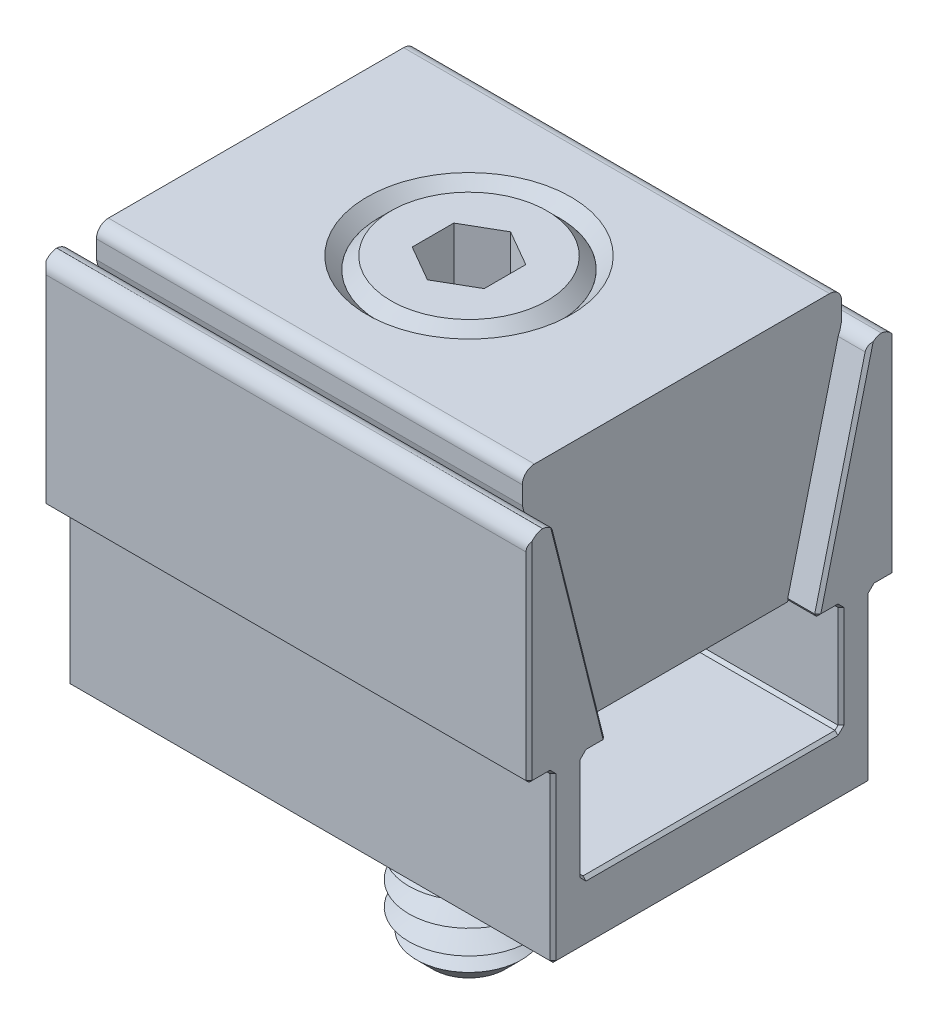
ISO-10303-21;
HEADER;
FILE_DESCRIPTION(('STEP AP214'),'2;1');
FILE_NAME('part.step','',(''),(''),'','','');
FILE_SCHEMA(('AUTOMOTIVE_DESIGN { 1 0 10303 214 1 1 1 1 }'));
ENDSEC;
DATA;
#1=APPLICATION_CONTEXT('core data for automotive mechanical design processes');
#2=APPLICATION_PROTOCOL_DEFINITION('international standard','automotive_design',2000,#1);
#3=PRODUCT_CONTEXT('',#1,'mechanical');
#4=PRODUCT('Part','Part','',(#3));
#5=PRODUCT_RELATED_PRODUCT_CATEGORY('part','',(#4));
#6=PRODUCT_DEFINITION_FORMATION('','',#4);
#7=PRODUCT_DEFINITION_CONTEXT('part definition',#1,'design');
#8=PRODUCT_DEFINITION('design','',#6,#7);
#9=PRODUCT_DEFINITION_SHAPE('','',#8);
#10=(LENGTH_UNIT() NAMED_UNIT(*) SI_UNIT(.MILLI.,.METRE.));
#11=(NAMED_UNIT(*) PLANE_ANGLE_UNIT() SI_UNIT($,.RADIAN.));
#12=(NAMED_UNIT(*) SI_UNIT($,.STERADIAN.) SOLID_ANGLE_UNIT());
#13=UNCERTAINTY_MEASURE_WITH_UNIT(LENGTH_MEASURE(1.E-05),#10,'distance_accuracy_value','');
#14=(GEOMETRIC_REPRESENTATION_CONTEXT(3) GLOBAL_UNCERTAINTY_ASSIGNED_CONTEXT((#13)) GLOBAL_UNIT_ASSIGNED_CONTEXT((#10,
#11,#12)) REPRESENTATION_CONTEXT('',''));
#15=CARTESIAN_POINT('',(0.,0.,0.));
#16=DIRECTION('',(0.,0.,1.));
#17=DIRECTION('',(1.,0.,0.));
#18=AXIS2_PLACEMENT_3D('',#15,#16,#17);
#19=CARTESIAN_POINT('',(0.,5.9,0.));
#20=DIRECTION('',(0.,1.,0.));
#21=DIRECTION('',(0.,0.,1.));
#22=AXIS2_PLACEMENT_3D('',#19,#20,#21);
#23=PLANE('',#22);
#24=CARTESIAN_POINT('',(0.,5.9,0.));
#25=DIRECTION('',(0.,1.,0.));
#26=DIRECTION('',(0.,0.,1.));
#27=AXIS2_PLACEMENT_3D('',#24,#25,#26);
#28=CIRCLE('',#27,0.599999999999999);
#29=CARTESIAN_POINT('',(0.299999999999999,5.9,0.519615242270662));
#30=VERTEX_POINT('',#29);
#31=CARTESIAN_POINT('',(0.599999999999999,5.9,0.));
#32=VERTEX_POINT('',#31);
#33=EDGE_CURVE('P0_E94',#30,#32,#28,.T.);
#34=ORIENTED_EDGE('',*,*,#33,.F.);
#35=DIRECTION('',(0.866025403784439,0.,-0.5));
#36=VECTOR('',#35,1.);
#37=CARTESIAN_POINT('',(0.,5.9,0.692820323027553));
#38=LINE('',#37,#36);
#39=CARTESIAN_POINT('',(0.599999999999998,5.9,0.346410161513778));
#40=VERTEX_POINT('',#39);
#41=EDGE_CURVE('P0_E117',#30,#40,#38,.T.);
#42=ORIENTED_EDGE('',*,*,#41,.T.);
#43=DIRECTION('',(0.,0.,-1.));
#44=VECTOR('',#43,1.);
#45=CARTESIAN_POINT('',(0.599999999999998,5.9,0.346410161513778));
#46=LINE('',#45,#44);
#47=EDGE_CURVE('P0_E113',#40,#32,#46,.T.);
#48=ORIENTED_EDGE('',*,*,#47,.T.);
#49=EDGE_LOOP('',(#34,#42,#48));
#50=FACE_BOUND('',#49,.T.);
#51=ADVANCED_FACE('P0_F16',(#50),#23,.T.);
#52=CARTESIAN_POINT('',(0.,5.9,0.));
#53=DIRECTION('',(0.,1.,0.));
#54=DIRECTION('',(0.,0.,1.));
#55=AXIS2_PLACEMENT_3D('',#52,#53,#54);
#56=CIRCLE('',#55,0.599999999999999);
#57=CARTESIAN_POINT('',(0.299999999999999,5.9,-0.519615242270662));
#58=VERTEX_POINT('',#57);
#59=EDGE_CURVE('P0_E11',#32,#58,#56,.T.);
#60=ORIENTED_EDGE('',*,*,#59,.F.);
#61=CARTESIAN_POINT('',(0.599999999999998,5.9,-0.346410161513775));
#62=VERTEX_POINT('',#61);
#63=EDGE_CURVE('P0_E105',#32,#62,#46,.T.);
#64=ORIENTED_EDGE('',*,*,#63,.T.);
#65=DIRECTION('',(-0.866025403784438,0.,-0.5));
#66=VECTOR('',#65,1.);
#67=CARTESIAN_POINT('',(0.599999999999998,5.9,-0.346410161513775));
#68=LINE('',#67,#66);
#69=EDGE_CURVE('P0_E108',#62,#58,#68,.T.);
#70=ORIENTED_EDGE('',*,*,#69,.T.);
#71=EDGE_LOOP('',(#60,#64,#70));
#72=FACE_BOUND('',#71,.T.);
#73=ADVANCED_FACE('P0_F104',(#72),#23,.T.);
#74=CARTESIAN_POINT('',(-0.299999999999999,5.9,-0.519615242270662));
#75=VERTEX_POINT('',#74);
#76=EDGE_CURVE('P0_E25',#58,#75,#56,.T.);
#77=ORIENTED_EDGE('',*,*,#76,.F.);
#78=CARTESIAN_POINT('',(0.,5.9,-0.692820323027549));
#79=VERTEX_POINT('',#78);
#80=EDGE_CURVE('P0_E140',#58,#79,#68,.T.);
#81=ORIENTED_EDGE('',*,*,#80,.T.);
#82=DIRECTION('',(-0.866025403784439,0.,0.499999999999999));
#83=VECTOR('',#82,1.);
#84=CARTESIAN_POINT('',(0.,5.9,-0.692820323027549));
#85=LINE('',#84,#83);
#86=EDGE_CURVE('P0_E300',#79,#75,#85,.T.);
#87=ORIENTED_EDGE('',*,*,#86,.T.);
#88=EDGE_LOOP('',(#77,#81,#87));
#89=FACE_BOUND('',#88,.T.);
#90=ADVANCED_FACE('P0_F302',(#89),#23,.T.);
#91=CARTESIAN_POINT('',(-0.599999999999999,5.9,0.));
#92=VERTEX_POINT('',#91);
#93=EDGE_CURVE('P0_E284',#75,#92,#56,.T.);
#94=ORIENTED_EDGE('',*,*,#93,.F.);
#95=CARTESIAN_POINT('',(-0.600000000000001,5.9,-0.346410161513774));
#96=VERTEX_POINT('',#95);
#97=EDGE_CURVE('P0_E293',#75,#96,#85,.T.);
#98=ORIENTED_EDGE('',*,*,#97,.T.);
#99=DIRECTION('',(0.,0.,1.));
#100=VECTOR('',#99,1.);
#101=CARTESIAN_POINT('',(-0.600000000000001,5.9,-0.346410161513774));
#102=LINE('',#101,#100);
#103=EDGE_CURVE('P0_E296',#96,#92,#102,.T.);
#104=ORIENTED_EDGE('',*,*,#103,.T.);
#105=EDGE_LOOP('',(#94,#98,#104));
#106=FACE_BOUND('',#105,.T.);
#107=ADVANCED_FACE('P0_F292',(#106),#23,.T.);
#108=CARTESIAN_POINT('',(-0.300000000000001,5.9,0.519615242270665));
#109=VERTEX_POINT('',#108);
#110=EDGE_CURVE('P0_E32',#92,#109,#56,.T.);
#111=ORIENTED_EDGE('',*,*,#110,.F.);
#112=CARTESIAN_POINT('',(-0.600000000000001,5.9,0.346410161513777));
#113=VERTEX_POINT('',#112);
#114=EDGE_CURVE('P0_E303',#92,#113,#102,.T.);
#115=ORIENTED_EDGE('',*,*,#114,.T.);
#116=DIRECTION('',(0.866025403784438,0.,0.500000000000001));
#117=VECTOR('',#116,1.);
#118=CARTESIAN_POINT('',(-0.600000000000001,5.9,0.346410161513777));
#119=LINE('',#118,#117);
#120=EDGE_CURVE('P0_E307',#113,#109,#119,.T.);
#121=ORIENTED_EDGE('',*,*,#120,.T.);
#122=EDGE_LOOP('',(#111,#115,#121));
#123=FACE_BOUND('',#122,.T.);
#124=ADVANCED_FACE('P0_F347',(#123),#23,.T.);
#125=CARTESIAN_POINT('',(0.,6.9,0.));
#126=DIRECTION('',(0.,1.,0.));
#127=DIRECTION('',(0.,0.,1.));
#128=AXIS2_PLACEMENT_3D('',#125,#126,#127);
#129=PLANE('',#128);
#130=DIRECTION('',(-0.866025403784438,0.,-0.5));
#131=VECTOR('',#130,1.);
#132=CARTESIAN_POINT('',(0.599999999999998,6.9,-0.346410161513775));
#133=LINE('',#132,#131);
#134=CARTESIAN_POINT('',(0.599999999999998,6.9,-0.346410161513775));
#135=VERTEX_POINT('',#134);
#136=CARTESIAN_POINT('',(0.,6.9,-0.692820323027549));
#137=VERTEX_POINT('',#136);
#138=EDGE_CURVE('P0_E40',#135,#137,#133,.T.);
#139=ORIENTED_EDGE('',*,*,#138,.F.);
#140=DIRECTION('',(0.,0.,-1.));
#141=VECTOR('',#140,1.);
#142=CARTESIAN_POINT('',(0.599999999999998,6.9,0.346410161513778));
#143=LINE('',#142,#141);
#144=CARTESIAN_POINT('',(0.599999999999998,6.9,0.346410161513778));
#145=VERTEX_POINT('',#144);
#146=EDGE_CURVE('P0_E138',#145,#135,#143,.T.);
#147=ORIENTED_EDGE('',*,*,#146,.F.);
#148=DIRECTION('',(0.866025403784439,0.,-0.5));
#149=VECTOR('',#148,1.);
#150=CARTESIAN_POINT('',(0.,6.9,0.692820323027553));
#151=LINE('',#150,#149);
#152=CARTESIAN_POINT('',(0.,6.9,0.692820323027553));
#153=VERTEX_POINT('',#152);
#154=EDGE_CURVE('P0_E135',#153,#145,#151,.T.);
#155=ORIENTED_EDGE('',*,*,#154,.F.);
#156=DIRECTION('',(0.866025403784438,0.,0.500000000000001));
#157=VECTOR('',#156,1.);
#158=CARTESIAN_POINT('',(-0.600000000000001,6.9,0.346410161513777));
#159=LINE('',#158,#157);
#160=CARTESIAN_POINT('',(-0.600000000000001,6.9,0.346410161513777));
#161=VERTEX_POINT('',#160);
#162=EDGE_CURVE('P0_E132',#161,#153,#159,.T.);
#163=ORIENTED_EDGE('',*,*,#162,.F.);
#164=DIRECTION('',(0.,0.,1.));
#165=VECTOR('',#164,1.);
#166=CARTESIAN_POINT('',(-0.600000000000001,6.9,-0.346410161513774));
#167=LINE('',#166,#165);
#168=CARTESIAN_POINT('',(-0.600000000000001,6.9,-0.346410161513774));
#169=VERTEX_POINT('',#168);
#170=EDGE_CURVE('P0_E129',#169,#161,#167,.T.);
#171=ORIENTED_EDGE('',*,*,#170,.F.);
#172=DIRECTION('',(-0.866025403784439,0.,0.499999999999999));
#173=VECTOR('',#172,1.);
#174=CARTESIAN_POINT('',(0.,6.9,-0.692820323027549));
#175=LINE('',#174,#173);
#176=EDGE_CURVE('P0_E126',#137,#169,#175,.T.);
#177=ORIENTED_EDGE('',*,*,#176,.F.);
#178=EDGE_LOOP('',(#139,#147,#155,#163,#171,#177));
#179=FACE_BOUND('',#178,.T.);
#180=CARTESIAN_POINT('',(0.,6.9,0.));
#181=DIRECTION('',(0.,1.,0.));
#182=DIRECTION('',(0.,0.,1.));
#183=AXIS2_PLACEMENT_3D('',#180,#181,#182);
#184=CIRCLE('',#183,1.3);
#185=CARTESIAN_POINT('',(0.,6.9,1.3));
#186=VERTEX_POINT('',#185);
#187=EDGE_CURVE('P0_E276',#186,#186,#184,.T.);
#188=ORIENTED_EDGE('',*,*,#187,.T.);
#189=EDGE_LOOP('',(#188));
#190=FACE_BOUND('',#189,.T.);
#191=ADVANCED_FACE('P0_F325',(#179,#190),#129,.T.);
#192=CARTESIAN_POINT('',(0.,67.1476336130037,0.));
#193=DIRECTION('',(0.,1.,0.));
#194=DIRECTION('',(0.,0.,1.));
#195=AXIS2_PLACEMENT_3D('',#192,#193,#194);
#196=CYLINDRICAL_SURFACE('',#195,1.5);
#197=CARTESIAN_POINT('',(0.,6.70000000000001,0.));
#198=DIRECTION('',(0.,1.,0.));
#199=DIRECTION('',(0.,0.,1.));
#200=AXIS2_PLACEMENT_3D('',#197,#198,#199);
#201=CIRCLE('',#200,1.5);
#202=CARTESIAN_POINT('',(0.,6.70000000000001,1.5));
#203=VERTEX_POINT('',#202);
#204=EDGE_CURVE('P0_E280',#203,#203,#201,.F.);
#205=ORIENTED_EDGE('',*,*,#204,.T.);
#206=EDGE_LOOP('',(#205));
#207=FACE_BOUND('',#206,.T.);
#208=CARTESIAN_POINT('',(0.,5.10000000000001,0.));
#209=DIRECTION('',(0.,1.,0.));
#210=DIRECTION('',(0.,0.,1.));
#211=AXIS2_PLACEMENT_3D('',#208,#209,#210);
#212=CIRCLE('',#211,1.5);
#213=CARTESIAN_POINT('',(0.,5.10000000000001,1.5));
#214=VERTEX_POINT('',#213);
#215=EDGE_CURVE('P0_E270',#214,#214,#212,.T.);
#216=ORIENTED_EDGE('',*,*,#215,.T.);
#217=EDGE_LOOP('',(#216));
#218=FACE_BOUND('',#217,.T.);
#219=ADVANCED_FACE('P0_F357',(#207,#218),#196,.T.);
#220=CARTESIAN_POINT('',(0.,5.10000000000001,1.5));
#221=DIRECTION('',(0.,-1.,0.));
#222=DIRECTION('',(0.,0.,-1.));
#223=AXIS2_PLACEMENT_3D('',#220,#221,#222);
#224=PLANE('',#223);
#225=CARTESIAN_POINT('',(0.,5.10000000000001,0.));
#226=DIRECTION('',(0.,1.,0.));
#227=DIRECTION('',(0.,0.,1.));
#228=AXIS2_PLACEMENT_3D('',#225,#226,#227);
#229=CIRCLE('',#228,1.);
#230=CARTESIAN_POINT('',(0.,5.10000000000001,1.));
#231=VERTEX_POINT('',#230);
#232=EDGE_CURVE('P0_E267',#231,#231,#229,.T.);
#233=ORIENTED_EDGE('',*,*,#232,.T.);
#234=EDGE_LOOP('',(#233));
#235=FACE_BOUND('',#234,.T.);
#236=ORIENTED_EDGE('',*,*,#215,.F.);
#237=EDGE_LOOP('',(#236));
#238=FACE_BOUND('',#237,.T.);
#239=ADVANCED_FACE('P0_F797',(#235,#238),#224,.T.);
#240=CARTESIAN_POINT('',(0.,4.90000000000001,0.));
#241=DIRECTION('',(0.,1.,0.));
#242=DIRECTION('',(0.,0.,1.));
#243=AXIS2_PLACEMENT_3D('',#240,#241,#242);
#244=CONICAL_SURFACE('',#243,0.653589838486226,1.0471975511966);
#245=ORIENTED_EDGE('',*,*,#232,.F.);
#246=EDGE_LOOP('',(#245));
#247=FACE_BOUND('',#246,.T.);
#248=CARTESIAN_POINT('',(0.,4.90000000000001,0.));
#249=DIRECTION('',(0.,1.,0.));
#250=DIRECTION('',(0.,0.,1.));
#251=AXIS2_PLACEMENT_3D('',#248,#249,#250);
#252=CIRCLE('',#251,0.653589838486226);
#253=CARTESIAN_POINT('',(0.,4.90000000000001,0.653589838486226));
#254=VERTEX_POINT('',#253);
#255=EDGE_CURVE('P0_E264',#254,#254,#252,.T.);
#256=ORIENTED_EDGE('',*,*,#255,.T.);
#257=EDGE_LOOP('',(#256));
#258=FACE_BOUND('',#257,.T.);
#259=ADVANCED_FACE('P0_F788',(#247,#258),#244,.T.);
#260=CARTESIAN_POINT('',(0.,4.70000000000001,0.));
#261=DIRECTION('',(0.,-1.,0.));
#262=DIRECTION('',(0.,0.,-1.));
#263=AXIS2_PLACEMENT_3D('',#260,#261,#262);
#264=CONICAL_SURFACE('',#263,1.,1.0471975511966);
#265=ORIENTED_EDGE('',*,*,#255,.F.);
#266=EDGE_LOOP('',(#265));
#267=FACE_BOUND('',#266,.T.);
#268=CARTESIAN_POINT('',(0.,4.70000000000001,0.));
#269=DIRECTION('',(0.,1.,0.));
#270=DIRECTION('',(0.,0.,1.));
#271=AXIS2_PLACEMENT_3D('',#268,#269,#270);
#272=CIRCLE('',#271,1.);
#273=CARTESIAN_POINT('',(0.,4.70000000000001,1.));
#274=VERTEX_POINT('',#273);
#275=EDGE_CURVE('P0_E261',#274,#274,#272,.T.);
#276=ORIENTED_EDGE('',*,*,#275,.T.);
#277=EDGE_LOOP('',(#276));
#278=FACE_BOUND('',#277,.T.);
#279=ADVANCED_FACE('P0_F779',(#267,#278),#264,.T.);
#280=CARTESIAN_POINT('',(0.,4.50000000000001,0.));
#281=DIRECTION('',(0.,1.,0.));
#282=DIRECTION('',(0.,0.,1.));
#283=AXIS2_PLACEMENT_3D('',#280,#281,#282);
#284=CONICAL_SURFACE('',#283,0.653589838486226,1.0471975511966);
#285=ORIENTED_EDGE('',*,*,#275,.F.);
#286=EDGE_LOOP('',(#285));
#287=FACE_BOUND('',#286,.T.);
#288=CARTESIAN_POINT('',(0.,4.50000000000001,0.));
#289=DIRECTION('',(0.,1.,0.));
#290=DIRECTION('',(0.,0.,1.));
#291=AXIS2_PLACEMENT_3D('',#288,#289,#290);
#292=CIRCLE('',#291,0.653589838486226);
#293=CARTESIAN_POINT('',(0.,4.50000000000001,0.653589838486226));
#294=VERTEX_POINT('',#293);
#295=EDGE_CURVE('P0_E258',#294,#294,#292,.T.);
#296=ORIENTED_EDGE('',*,*,#295,.T.);
#297=EDGE_LOOP('',(#296));
#298=FACE_BOUND('',#297,.T.);
#299=ADVANCED_FACE('P0_F770',(#287,#298),#284,.T.);
#300=CARTESIAN_POINT('',(0.,4.30000000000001,0.));
#301=DIRECTION('',(0.,-1.,0.));
#302=DIRECTION('',(0.,0.,-1.));
#303=AXIS2_PLACEMENT_3D('',#300,#301,#302);
#304=CONICAL_SURFACE('',#303,1.,1.0471975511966);
#305=ORIENTED_EDGE('',*,*,#295,.F.);
#306=EDGE_LOOP('',(#305));
#307=FACE_BOUND('',#306,.T.);
#308=CARTESIAN_POINT('',(0.,4.30000000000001,0.));
#309=DIRECTION('',(0.,1.,0.));
#310=DIRECTION('',(0.,0.,1.));
#311=AXIS2_PLACEMENT_3D('',#308,#309,#310);
#312=CIRCLE('',#311,1.);
#313=CARTESIAN_POINT('',(0.,4.30000000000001,1.));
#314=VERTEX_POINT('',#313);
#315=EDGE_CURVE('P0_E255',#314,#314,#312,.T.);
#316=ORIENTED_EDGE('',*,*,#315,.T.);
#317=EDGE_LOOP('',(#316));
#318=FACE_BOUND('',#317,.T.);
#319=ADVANCED_FACE('P0_F761',(#307,#318),#304,.T.);
#320=CARTESIAN_POINT('',(0.,4.10000000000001,0.));
#321=DIRECTION('',(0.,1.,0.));
#322=DIRECTION('',(0.,0.,1.));
#323=AXIS2_PLACEMENT_3D('',#320,#321,#322);
#324=CONICAL_SURFACE('',#323,0.653589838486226,1.0471975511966);
#325=ORIENTED_EDGE('',*,*,#315,.F.);
#326=EDGE_LOOP('',(#325));
#327=FACE_BOUND('',#326,.T.);
#328=CARTESIAN_POINT('',(0.,4.10000000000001,0.));
#329=DIRECTION('',(0.,1.,0.));
#330=DIRECTION('',(0.,0.,1.));
#331=AXIS2_PLACEMENT_3D('',#328,#329,#330);
#332=CIRCLE('',#331,0.653589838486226);
#333=CARTESIAN_POINT('',(0.,4.10000000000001,0.653589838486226));
#334=VERTEX_POINT('',#333);
#335=EDGE_CURVE('P0_E252',#334,#334,#332,.T.);
#336=ORIENTED_EDGE('',*,*,#335,.T.);
#337=EDGE_LOOP('',(#336));
#338=FACE_BOUND('',#337,.T.);
#339=ADVANCED_FACE('P0_F752',(#327,#338),#324,.T.);
#340=CARTESIAN_POINT('',(0.,3.90000000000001,0.));
#341=DIRECTION('',(0.,-1.,0.));
#342=DIRECTION('',(0.,0.,-1.));
#343=AXIS2_PLACEMENT_3D('',#340,#341,#342);
#344=CONICAL_SURFACE('',#343,1.,1.0471975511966);
#345=ORIENTED_EDGE('',*,*,#335,.F.);
#346=EDGE_LOOP('',(#345));
#347=FACE_BOUND('',#346,.T.);
#348=CARTESIAN_POINT('',(0.,3.90000000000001,0.));
#349=DIRECTION('',(0.,1.,0.));
#350=DIRECTION('',(0.,0.,1.));
#351=AXIS2_PLACEMENT_3D('',#348,#349,#350);
#352=CIRCLE('',#351,1.);
#353=CARTESIAN_POINT('',(0.,3.90000000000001,1.));
#354=VERTEX_POINT('',#353);
#355=EDGE_CURVE('P0_E249',#354,#354,#352,.T.);
#356=ORIENTED_EDGE('',*,*,#355,.T.);
#357=EDGE_LOOP('',(#356));
#358=FACE_BOUND('',#357,.T.);
#359=ADVANCED_FACE('P0_F743',(#347,#358),#344,.T.);
#360=CARTESIAN_POINT('',(0.,3.70000000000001,0.));
#361=DIRECTION('',(0.,1.,0.));
#362=DIRECTION('',(0.,0.,1.));
#363=AXIS2_PLACEMENT_3D('',#360,#361,#362);
#364=CONICAL_SURFACE('',#363,0.653589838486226,1.0471975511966);
#365=ORIENTED_EDGE('',*,*,#355,.F.);
#366=EDGE_LOOP('',(#365));
#367=FACE_BOUND('',#366,.T.);
#368=CARTESIAN_POINT('',(0.,3.70000000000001,0.));
#369=DIRECTION('',(0.,1.,0.));
#370=DIRECTION('',(0.,0.,1.));
#371=AXIS2_PLACEMENT_3D('',#368,#369,#370);
#372=CIRCLE('',#371,0.653589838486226);
#373=CARTESIAN_POINT('',(0.,3.70000000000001,0.653589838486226));
#374=VERTEX_POINT('',#373);
#375=EDGE_CURVE('P0_E246',#374,#374,#372,.T.);
#376=ORIENTED_EDGE('',*,*,#375,.T.);
#377=EDGE_LOOP('',(#376));
#378=FACE_BOUND('',#377,.T.);
#379=ADVANCED_FACE('P0_F734',(#367,#378),#364,.T.);
#380=CARTESIAN_POINT('',(0.,3.50000000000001,0.));
#381=DIRECTION('',(0.,-1.,0.));
#382=DIRECTION('',(0.,0.,-1.));
#383=AXIS2_PLACEMENT_3D('',#380,#381,#382);
#384=CONICAL_SURFACE('',#383,1.,1.0471975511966);
#385=ORIENTED_EDGE('',*,*,#375,.F.);
#386=EDGE_LOOP('',(#385));
#387=FACE_BOUND('',#386,.T.);
#388=CARTESIAN_POINT('',(0.,3.50000000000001,0.));
#389=DIRECTION('',(0.,1.,0.));
#390=DIRECTION('',(0.,0.,1.));
#391=AXIS2_PLACEMENT_3D('',#388,#389,#390);
#392=CIRCLE('',#391,1.);
#393=CARTESIAN_POINT('',(0.,3.50000000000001,1.));
#394=VERTEX_POINT('',#393);
#395=EDGE_CURVE('P0_E243',#394,#394,#392,.T.);
#396=ORIENTED_EDGE('',*,*,#395,.T.);
#397=EDGE_LOOP('',(#396));
#398=FACE_BOUND('',#397,.T.);
#399=ADVANCED_FACE('P0_F725',(#387,#398),#384,.T.);
#400=CARTESIAN_POINT('',(0.,3.30000000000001,0.));
#401=DIRECTION('',(0.,1.,0.));
#402=DIRECTION('',(0.,0.,1.));
#403=AXIS2_PLACEMENT_3D('',#400,#401,#402);
#404=CONICAL_SURFACE('',#403,0.653589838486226,1.0471975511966);
#405=ORIENTED_EDGE('',*,*,#395,.F.);
#406=EDGE_LOOP('',(#405));
#407=FACE_BOUND('',#406,.T.);
#408=CARTESIAN_POINT('',(0.,3.30000000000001,0.));
#409=DIRECTION('',(0.,1.,0.));
#410=DIRECTION('',(0.,0.,1.));
#411=AXIS2_PLACEMENT_3D('',#408,#409,#410);
#412=CIRCLE('',#411,0.653589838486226);
#413=CARTESIAN_POINT('',(0.,3.30000000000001,0.653589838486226));
#414=VERTEX_POINT('',#413);
#415=EDGE_CURVE('P0_E240',#414,#414,#412,.T.);
#416=ORIENTED_EDGE('',*,*,#415,.T.);
#417=EDGE_LOOP('',(#416));
#418=FACE_BOUND('',#417,.T.);
#419=ADVANCED_FACE('P0_F716',(#407,#418),#404,.T.);
#420=CARTESIAN_POINT('',(0.,3.10000000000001,0.));
#421=DIRECTION('',(0.,-1.,0.));
#422=DIRECTION('',(0.,0.,-1.));
#423=AXIS2_PLACEMENT_3D('',#420,#421,#422);
#424=CONICAL_SURFACE('',#423,1.,1.0471975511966);
#425=ORIENTED_EDGE('',*,*,#415,.F.);
#426=EDGE_LOOP('',(#425));
#427=FACE_BOUND('',#426,.T.);
#428=CARTESIAN_POINT('',(0.,3.10000000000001,0.));
#429=DIRECTION('',(0.,1.,0.));
#430=DIRECTION('',(0.,0.,1.));
#431=AXIS2_PLACEMENT_3D('',#428,#429,#430);
#432=CIRCLE('',#431,1.);
#433=CARTESIAN_POINT('',(0.,3.10000000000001,1.));
#434=VERTEX_POINT('',#433);
#435=EDGE_CURVE('P0_E237',#434,#434,#432,.T.);
#436=ORIENTED_EDGE('',*,*,#435,.T.);
#437=EDGE_LOOP('',(#436));
#438=FACE_BOUND('',#437,.T.);
#439=ADVANCED_FACE('P0_F707',(#427,#438),#424,.T.);
#440=CARTESIAN_POINT('',(0.,2.90000000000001,0.));
#441=DIRECTION('',(0.,1.,0.));
#442=DIRECTION('',(0.,0.,1.));
#443=AXIS2_PLACEMENT_3D('',#440,#441,#442);
#444=CONICAL_SURFACE('',#443,0.653589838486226,1.0471975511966);
#445=ORIENTED_EDGE('',*,*,#435,.F.);
#446=EDGE_LOOP('',(#445));
#447=FACE_BOUND('',#446,.T.);
#448=CARTESIAN_POINT('',(0.,2.90000000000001,0.));
#449=DIRECTION('',(0.,1.,0.));
#450=DIRECTION('',(0.,0.,1.));
#451=AXIS2_PLACEMENT_3D('',#448,#449,#450);
#452=CIRCLE('',#451,0.653589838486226);
#453=CARTESIAN_POINT('',(0.,2.90000000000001,0.653589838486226));
#454=VERTEX_POINT('',#453);
#455=EDGE_CURVE('P0_E234',#454,#454,#452,.T.);
#456=ORIENTED_EDGE('',*,*,#455,.T.);
#457=EDGE_LOOP('',(#456));
#458=FACE_BOUND('',#457,.T.);
#459=ADVANCED_FACE('P0_F698',(#447,#458),#444,.T.);
#460=CARTESIAN_POINT('',(0.,2.70000000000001,0.));
#461=DIRECTION('',(0.,-1.,0.));
#462=DIRECTION('',(0.,0.,-1.));
#463=AXIS2_PLACEMENT_3D('',#460,#461,#462);
#464=CONICAL_SURFACE('',#463,1.,1.0471975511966);
#465=ORIENTED_EDGE('',*,*,#455,.F.);
#466=EDGE_LOOP('',(#465));
#467=FACE_BOUND('',#466,.T.);
#468=CARTESIAN_POINT('',(0.,2.70000000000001,0.));
#469=DIRECTION('',(0.,1.,0.));
#470=DIRECTION('',(0.,0.,1.));
#471=AXIS2_PLACEMENT_3D('',#468,#469,#470);
#472=CIRCLE('',#471,1.);
#473=CARTESIAN_POINT('',(0.,2.70000000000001,1.));
#474=VERTEX_POINT('',#473);
#475=EDGE_CURVE('P0_E231',#474,#474,#472,.T.);
#476=ORIENTED_EDGE('',*,*,#475,.T.);
#477=EDGE_LOOP('',(#476));
#478=FACE_BOUND('',#477,.T.);
#479=ADVANCED_FACE('P0_F689',(#467,#478),#464,.T.);
#480=CARTESIAN_POINT('',(0.,2.50000000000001,0.));
#481=DIRECTION('',(0.,1.,0.));
#482=DIRECTION('',(0.,0.,1.));
#483=AXIS2_PLACEMENT_3D('',#480,#481,#482);
#484=CONICAL_SURFACE('',#483,0.653589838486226,1.0471975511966);
#485=ORIENTED_EDGE('',*,*,#475,.F.);
#486=EDGE_LOOP('',(#485));
#487=FACE_BOUND('',#486,.T.);
#488=CARTESIAN_POINT('',(0.,2.50000000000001,0.));
#489=DIRECTION('',(0.,1.,0.));
#490=DIRECTION('',(0.,0.,1.));
#491=AXIS2_PLACEMENT_3D('',#488,#489,#490);
#492=CIRCLE('',#491,0.653589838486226);
#493=CARTESIAN_POINT('',(0.,2.50000000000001,0.653589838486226));
#494=VERTEX_POINT('',#493);
#495=EDGE_CURVE('P0_E228',#494,#494,#492,.T.);
#496=ORIENTED_EDGE('',*,*,#495,.T.);
#497=EDGE_LOOP('',(#496));
#498=FACE_BOUND('',#497,.T.);
#499=ADVANCED_FACE('P0_F680',(#487,#498),#484,.T.);
#500=CARTESIAN_POINT('',(0.,2.30000000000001,0.));
#501=DIRECTION('',(0.,-1.,0.));
#502=DIRECTION('',(0.,0.,-1.));
#503=AXIS2_PLACEMENT_3D('',#500,#501,#502);
#504=CONICAL_SURFACE('',#503,1.,1.0471975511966);
#505=ORIENTED_EDGE('',*,*,#495,.F.);
#506=EDGE_LOOP('',(#505));
#507=FACE_BOUND('',#506,.T.);
#508=CARTESIAN_POINT('',(0.,2.30000000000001,0.));
#509=DIRECTION('',(0.,1.,0.));
#510=DIRECTION('',(0.,0.,1.));
#511=AXIS2_PLACEMENT_3D('',#508,#509,#510);
#512=CIRCLE('',#511,1.);
#513=CARTESIAN_POINT('',(0.,2.30000000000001,1.));
#514=VERTEX_POINT('',#513);
#515=EDGE_CURVE('P0_E225',#514,#514,#512,.T.);
#516=ORIENTED_EDGE('',*,*,#515,.T.);
#517=EDGE_LOOP('',(#516));
#518=FACE_BOUND('',#517,.T.);
#519=ADVANCED_FACE('P0_F671',(#507,#518),#504,.T.);
#520=CARTESIAN_POINT('',(0.,2.10000000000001,0.));
#521=DIRECTION('',(0.,1.,0.));
#522=DIRECTION('',(0.,0.,1.));
#523=AXIS2_PLACEMENT_3D('',#520,#521,#522);
#524=CONICAL_SURFACE('',#523,0.653589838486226,1.0471975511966);
#525=ORIENTED_EDGE('',*,*,#515,.F.);
#526=EDGE_LOOP('',(#525));
#527=FACE_BOUND('',#526,.T.);
#528=CARTESIAN_POINT('',(0.,2.10000000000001,0.));
#529=DIRECTION('',(0.,1.,0.));
#530=DIRECTION('',(0.,0.,1.));
#531=AXIS2_PLACEMENT_3D('',#528,#529,#530);
#532=CIRCLE('',#531,0.653589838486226);
#533=CARTESIAN_POINT('',(0.,2.10000000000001,0.653589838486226));
#534=VERTEX_POINT('',#533);
#535=EDGE_CURVE('P0_E222',#534,#534,#532,.T.);
#536=ORIENTED_EDGE('',*,*,#535,.T.);
#537=EDGE_LOOP('',(#536));
#538=FACE_BOUND('',#537,.T.);
#539=ADVANCED_FACE('P0_F662',(#527,#538),#524,.T.);
#540=CARTESIAN_POINT('',(0.,1.90000000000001,0.));
#541=DIRECTION('',(0.,-1.,0.));
#542=DIRECTION('',(0.,0.,-1.));
#543=AXIS2_PLACEMENT_3D('',#540,#541,#542);
#544=CONICAL_SURFACE('',#543,1.,1.0471975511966);
#545=ORIENTED_EDGE('',*,*,#535,.F.);
#546=EDGE_LOOP('',(#545));
#547=FACE_BOUND('',#546,.T.);
#548=CARTESIAN_POINT('',(0.,1.90000000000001,0.));
#549=DIRECTION('',(0.,1.,0.));
#550=DIRECTION('',(0.,0.,1.));
#551=AXIS2_PLACEMENT_3D('',#548,#549,#550);
#552=CIRCLE('',#551,1.);
#553=CARTESIAN_POINT('',(0.,1.90000000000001,1.));
#554=VERTEX_POINT('',#553);
#555=EDGE_CURVE('P0_E219',#554,#554,#552,.T.);
#556=ORIENTED_EDGE('',*,*,#555,.T.);
#557=EDGE_LOOP('',(#556));
#558=FACE_BOUND('',#557,.T.);
#559=ADVANCED_FACE('P0_F653',(#547,#558),#544,.T.);
#560=CARTESIAN_POINT('',(0.,1.70000000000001,0.));
#561=DIRECTION('',(0.,1.,0.));
#562=DIRECTION('',(0.,0.,1.));
#563=AXIS2_PLACEMENT_3D('',#560,#561,#562);
#564=CONICAL_SURFACE('',#563,0.653589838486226,1.0471975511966);
#565=ORIENTED_EDGE('',*,*,#555,.F.);
#566=EDGE_LOOP('',(#565));
#567=FACE_BOUND('',#566,.T.);
#568=CARTESIAN_POINT('',(0.,1.70000000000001,0.));
#569=DIRECTION('',(0.,1.,0.));
#570=DIRECTION('',(0.,0.,1.));
#571=AXIS2_PLACEMENT_3D('',#568,#569,#570);
#572=CIRCLE('',#571,0.653589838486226);
#573=CARTESIAN_POINT('',(0.,1.70000000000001,0.653589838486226));
#574=VERTEX_POINT('',#573);
#575=EDGE_CURVE('P0_E216',#574,#574,#572,.T.);
#576=ORIENTED_EDGE('',*,*,#575,.T.);
#577=EDGE_LOOP('',(#576));
#578=FACE_BOUND('',#577,.T.);
#579=ADVANCED_FACE('P0_F644',(#567,#578),#564,.T.);
#580=CARTESIAN_POINT('',(0.,1.50000000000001,0.));
#581=DIRECTION('',(0.,-1.,0.));
#582=DIRECTION('',(0.,0.,-1.));
#583=AXIS2_PLACEMENT_3D('',#580,#581,#582);
#584=CONICAL_SURFACE('',#583,1.,1.0471975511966);
#585=ORIENTED_EDGE('',*,*,#575,.F.);
#586=EDGE_LOOP('',(#585));
#587=FACE_BOUND('',#586,.T.);
#588=CARTESIAN_POINT('',(0.,1.50000000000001,0.));
#589=DIRECTION('',(0.,1.,0.));
#590=DIRECTION('',(0.,0.,1.));
#591=AXIS2_PLACEMENT_3D('',#588,#589,#590);
#592=CIRCLE('',#591,1.);
#593=CARTESIAN_POINT('',(0.,1.50000000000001,1.));
#594=VERTEX_POINT('',#593);
#595=EDGE_CURVE('P0_E213',#594,#594,#592,.T.);
#596=ORIENTED_EDGE('',*,*,#595,.T.);
#597=EDGE_LOOP('',(#596));
#598=FACE_BOUND('',#597,.T.);
#599=ADVANCED_FACE('P0_F635',(#587,#598),#584,.T.);
#600=CARTESIAN_POINT('',(0.,1.30000000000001,0.));
#601=DIRECTION('',(0.,1.,0.));
#602=DIRECTION('',(0.,0.,1.));
#603=AXIS2_PLACEMENT_3D('',#600,#601,#602);
#604=CONICAL_SURFACE('',#603,0.653589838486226,1.0471975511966);
#605=ORIENTED_EDGE('',*,*,#595,.F.);
#606=EDGE_LOOP('',(#605));
#607=FACE_BOUND('',#606,.T.);
#608=CARTESIAN_POINT('',(0.,1.30000000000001,0.));
#609=DIRECTION('',(0.,1.,0.));
#610=DIRECTION('',(0.,0.,1.));
#611=AXIS2_PLACEMENT_3D('',#608,#609,#610);
#612=CIRCLE('',#611,0.653589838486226);
#613=CARTESIAN_POINT('',(0.,1.30000000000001,0.653589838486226));
#614=VERTEX_POINT('',#613);
#615=EDGE_CURVE('P0_E210',#614,#614,#612,.T.);
#616=ORIENTED_EDGE('',*,*,#615,.T.);
#617=EDGE_LOOP('',(#616));
#618=FACE_BOUND('',#617,.T.);
#619=ADVANCED_FACE('P0_F626',(#607,#618),#604,.T.);
#620=CARTESIAN_POINT('',(0.,1.10000000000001,0.));
#621=DIRECTION('',(0.,-1.,0.));
#622=DIRECTION('',(0.,0.,-1.));
#623=AXIS2_PLACEMENT_3D('',#620,#621,#622);
#624=CONICAL_SURFACE('',#623,1.,1.0471975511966);
#625=ORIENTED_EDGE('',*,*,#615,.F.);
#626=EDGE_LOOP('',(#625));
#627=FACE_BOUND('',#626,.T.);
#628=CARTESIAN_POINT('',(0.,1.10000000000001,0.));
#629=DIRECTION('',(0.,1.,0.));
#630=DIRECTION('',(0.,0.,1.));
#631=AXIS2_PLACEMENT_3D('',#628,#629,#630);
#632=CIRCLE('',#631,1.);
#633=CARTESIAN_POINT('',(0.,1.10000000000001,1.));
#634=VERTEX_POINT('',#633);
#635=EDGE_CURVE('P0_E207',#634,#634,#632,.T.);
#636=ORIENTED_EDGE('',*,*,#635,.T.);
#637=EDGE_LOOP('',(#636));
#638=FACE_BOUND('',#637,.T.);
#639=ADVANCED_FACE('P0_F617',(#627,#638),#624,.T.);
#640=CARTESIAN_POINT('',(0.,0.90000000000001,0.));
#641=DIRECTION('',(0.,1.,0.));
#642=DIRECTION('',(0.,0.,1.));
#643=AXIS2_PLACEMENT_3D('',#640,#641,#642);
#644=CONICAL_SURFACE('',#643,0.653589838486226,1.0471975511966);
#645=ORIENTED_EDGE('',*,*,#635,.F.);
#646=EDGE_LOOP('',(#645));
#647=FACE_BOUND('',#646,.T.);
#648=CARTESIAN_POINT('',(0.,0.90000000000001,0.));
#649=DIRECTION('',(0.,1.,0.));
#650=DIRECTION('',(0.,0.,1.));
#651=AXIS2_PLACEMENT_3D('',#648,#649,#650);
#652=CIRCLE('',#651,0.653589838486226);
#653=CARTESIAN_POINT('',(0.,0.90000000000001,0.653589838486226));
#654=VERTEX_POINT('',#653);
#655=EDGE_CURVE('P0_E204',#654,#654,#652,.T.);
#656=ORIENTED_EDGE('',*,*,#655,.T.);
#657=EDGE_LOOP('',(#656));
#658=FACE_BOUND('',#657,.T.);
#659=ADVANCED_FACE('P0_F608',(#647,#658),#644,.T.);
#660=CARTESIAN_POINT('',(0.,0.700000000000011,0.));
#661=DIRECTION('',(0.,-1.,0.));
#662=DIRECTION('',(0.,0.,-1.));
#663=AXIS2_PLACEMENT_3D('',#660,#661,#662);
#664=CONICAL_SURFACE('',#663,1.,1.0471975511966);
#665=ORIENTED_EDGE('',*,*,#655,.F.);
#666=EDGE_LOOP('',(#665));
#667=FACE_BOUND('',#666,.T.);
#668=CARTESIAN_POINT('',(0.,0.700000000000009,0.));
#669=DIRECTION('',(0.,1.,0.));
#670=DIRECTION('',(0.,0.,1.));
#671=AXIS2_PLACEMENT_3D('',#668,#669,#670);
#672=CIRCLE('',#671,1.);
#673=CARTESIAN_POINT('',(0.,0.700000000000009,1.));
#674=VERTEX_POINT('',#673);
#675=EDGE_CURVE('P0_E201',#674,#674,#672,.T.);
#676=ORIENTED_EDGE('',*,*,#675,.T.);
#677=EDGE_LOOP('',(#676));
#678=FACE_BOUND('',#677,.T.);
#679=ADVANCED_FACE('P0_F599',(#667,#678),#664,.T.);
#680=CARTESIAN_POINT('',(0.,0.50000000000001,0.));
#681=DIRECTION('',(0.,1.,0.));
#682=DIRECTION('',(0.,0.,1.));
#683=AXIS2_PLACEMENT_3D('',#680,#681,#682);
#684=CONICAL_SURFACE('',#683,0.653589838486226,1.0471975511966);
#685=ORIENTED_EDGE('',*,*,#675,.F.);
#686=EDGE_LOOP('',(#685));
#687=FACE_BOUND('',#686,.T.);
#688=CARTESIAN_POINT('',(0.,0.50000000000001,0.));
#689=DIRECTION('',(0.,1.,0.));
#690=DIRECTION('',(0.,0.,1.));
#691=AXIS2_PLACEMENT_3D('',#688,#689,#690);
#692=CIRCLE('',#691,0.653589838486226);
#693=CARTESIAN_POINT('',(0.,0.50000000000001,0.653589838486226));
#694=VERTEX_POINT('',#693);
#695=EDGE_CURVE('P0_E198',#694,#694,#692,.T.);
#696=ORIENTED_EDGE('',*,*,#695,.T.);
#697=EDGE_LOOP('',(#696));
#698=FACE_BOUND('',#697,.T.);
#699=ADVANCED_FACE('P0_F590',(#687,#698),#684,.T.);
#700=CARTESIAN_POINT('',(0.,0.300000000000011,0.));
#701=DIRECTION('',(0.,-1.,0.));
#702=DIRECTION('',(0.,0.,-1.));
#703=AXIS2_PLACEMENT_3D('',#700,#701,#702);
#704=CONICAL_SURFACE('',#703,1.,1.0471975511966);
#705=ORIENTED_EDGE('',*,*,#695,.F.);
#706=EDGE_LOOP('',(#705));
#707=FACE_BOUND('',#706,.T.);
#708=CARTESIAN_POINT('',(0.,0.300000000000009,0.));
#709=DIRECTION('',(0.,1.,0.));
#710=DIRECTION('',(0.,0.,1.));
#711=AXIS2_PLACEMENT_3D('',#708,#709,#710);
#712=CIRCLE('',#711,1.);
#713=CARTESIAN_POINT('',(0.,0.300000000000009,1.));
#714=VERTEX_POINT('',#713);
#715=EDGE_CURVE('P0_E195',#714,#714,#712,.T.);
#716=ORIENTED_EDGE('',*,*,#715,.T.);
#717=EDGE_LOOP('',(#716));
#718=FACE_BOUND('',#717,.T.);
#719=ADVANCED_FACE('P0_F581',(#707,#718),#704,.T.);
#720=CARTESIAN_POINT('',(0.,0.10000000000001,0.));
#721=DIRECTION('',(0.,1.,0.));
#722=DIRECTION('',(0.,0.,1.));
#723=AXIS2_PLACEMENT_3D('',#720,#721,#722);
#724=CONICAL_SURFACE('',#723,0.653589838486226,1.0471975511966);
#725=ORIENTED_EDGE('',*,*,#715,.F.);
#726=EDGE_LOOP('',(#725));
#727=FACE_BOUND('',#726,.T.);
#728=CARTESIAN_POINT('',(0.,0.10000000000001,0.));
#729=DIRECTION('',(0.,1.,0.));
#730=DIRECTION('',(0.,0.,1.));
#731=AXIS2_PLACEMENT_3D('',#728,#729,#730);
#732=CIRCLE('',#731,0.653589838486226);
#733=CARTESIAN_POINT('',(0.,0.10000000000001,0.653589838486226));
#734=VERTEX_POINT('',#733);
#735=EDGE_CURVE('P0_E192',#734,#734,#732,.T.);
#736=ORIENTED_EDGE('',*,*,#735,.T.);
#737=EDGE_LOOP('',(#736));
#738=FACE_BOUND('',#737,.T.);
#739=ADVANCED_FACE('P0_F572',(#727,#738),#724,.T.);
#740=CARTESIAN_POINT('',(0.,-0.099999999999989,0.));
#741=DIRECTION('',(0.,-1.,0.));
#742=DIRECTION('',(0.,0.,-1.));
#743=AXIS2_PLACEMENT_3D('',#740,#741,#742);
#744=CONICAL_SURFACE('',#743,1.,1.0471975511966);
#745=ORIENTED_EDGE('',*,*,#735,.F.);
#746=EDGE_LOOP('',(#745));
#747=FACE_BOUND('',#746,.T.);
#748=CARTESIAN_POINT('',(0.,-0.0999999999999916,0.));
#749=DIRECTION('',(0.,1.,0.));
#750=DIRECTION('',(0.,0.,1.));
#751=AXIS2_PLACEMENT_3D('',#748,#749,#750);
#752=CIRCLE('',#751,1.);
#753=CARTESIAN_POINT('',(0.,-0.0999999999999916,1.));
#754=VERTEX_POINT('',#753);
#755=EDGE_CURVE('P0_E189',#754,#754,#752,.T.);
#756=ORIENTED_EDGE('',*,*,#755,.T.);
#757=EDGE_LOOP('',(#756));
#758=FACE_BOUND('',#757,.T.);
#759=ADVANCED_FACE('P0_F563',(#747,#758),#744,.T.);
#760=CARTESIAN_POINT('',(0.,-0.29999999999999,0.));
#761=DIRECTION('',(0.,1.,0.));
#762=DIRECTION('',(0.,0.,1.));
#763=AXIS2_PLACEMENT_3D('',#760,#761,#762);
#764=CONICAL_SURFACE('',#763,0.653589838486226,1.0471975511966);
#765=ORIENTED_EDGE('',*,*,#755,.F.);
#766=EDGE_LOOP('',(#765));
#767=FACE_BOUND('',#766,.T.);
#768=CARTESIAN_POINT('',(0.,-0.29999999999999,0.));
#769=DIRECTION('',(0.,1.,0.));
#770=DIRECTION('',(0.,0.,1.));
#771=AXIS2_PLACEMENT_3D('',#768,#769,#770);
#772=CIRCLE('',#771,0.653589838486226);
#773=CARTESIAN_POINT('',(0.,-0.29999999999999,0.653589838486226));
#774=VERTEX_POINT('',#773);
#775=EDGE_CURVE('P0_E186',#774,#774,#772,.T.);
#776=ORIENTED_EDGE('',*,*,#775,.T.);
#777=EDGE_LOOP('',(#776));
#778=FACE_BOUND('',#777,.T.);
#779=ADVANCED_FACE('P0_F554',(#767,#778),#764,.T.);
#780=CARTESIAN_POINT('',(0.,-0.499999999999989,0.));
#781=DIRECTION('',(0.,-1.,0.));
#782=DIRECTION('',(0.,0.,-1.));
#783=AXIS2_PLACEMENT_3D('',#780,#781,#782);
#784=CONICAL_SURFACE('',#783,1.,1.0471975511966);
#785=ORIENTED_EDGE('',*,*,#775,.F.);
#786=EDGE_LOOP('',(#785));
#787=FACE_BOUND('',#786,.T.);
#788=CARTESIAN_POINT('',(0.,-0.499999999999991,0.));
#789=DIRECTION('',(0.,1.,0.));
#790=DIRECTION('',(0.,0.,1.));
#791=AXIS2_PLACEMENT_3D('',#788,#789,#790);
#792=CIRCLE('',#791,1.);
#793=CARTESIAN_POINT('',(0.,-0.499999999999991,1.));
#794=VERTEX_POINT('',#793);
#795=EDGE_CURVE('P0_E183',#794,#794,#792,.T.);
#796=ORIENTED_EDGE('',*,*,#795,.T.);
#797=EDGE_LOOP('',(#796));
#798=FACE_BOUND('',#797,.T.);
#799=ADVANCED_FACE('P0_F545',(#787,#798),#784,.T.);
#800=CARTESIAN_POINT('',(0.,-0.69999999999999,0.));
#801=DIRECTION('',(0.,1.,0.));
#802=DIRECTION('',(0.,0.,1.));
#803=AXIS2_PLACEMENT_3D('',#800,#801,#802);
#804=CONICAL_SURFACE('',#803,0.653589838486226,1.0471975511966);
#805=ORIENTED_EDGE('',*,*,#795,.F.);
#806=EDGE_LOOP('',(#805));
#807=FACE_BOUND('',#806,.T.);
#808=CARTESIAN_POINT('',(0.,-0.69999999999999,0.));
#809=DIRECTION('',(0.,1.,0.));
#810=DIRECTION('',(0.,0.,1.));
#811=AXIS2_PLACEMENT_3D('',#808,#809,#810);
#812=CIRCLE('',#811,0.653589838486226);
#813=CARTESIAN_POINT('',(0.,-0.69999999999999,0.653589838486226));
#814=VERTEX_POINT('',#813);
#815=EDGE_CURVE('P0_E180',#814,#814,#812,.T.);
#816=ORIENTED_EDGE('',*,*,#815,.T.);
#817=EDGE_LOOP('',(#816));
#818=FACE_BOUND('',#817,.T.);
#819=ADVANCED_FACE('P0_F536',(#807,#818),#804,.T.);
#820=CARTESIAN_POINT('',(0.,-0.899999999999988,0.));
#821=DIRECTION('',(0.,-1.,0.));
#822=DIRECTION('',(0.,0.,-1.));
#823=AXIS2_PLACEMENT_3D('',#820,#821,#822);
#824=CONICAL_SURFACE('',#823,1.,1.0471975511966);
#825=ORIENTED_EDGE('',*,*,#815,.F.);
#826=EDGE_LOOP('',(#825));
#827=FACE_BOUND('',#826,.T.);
#828=CARTESIAN_POINT('',(0.,-0.899999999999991,0.));
#829=DIRECTION('',(0.,1.,0.));
#830=DIRECTION('',(0.,0.,1.));
#831=AXIS2_PLACEMENT_3D('',#828,#829,#830);
#832=CIRCLE('',#831,1.);
#833=CARTESIAN_POINT('',(0.,-0.899999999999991,1.));
#834=VERTEX_POINT('',#833);
#835=EDGE_CURVE('P0_E177',#834,#834,#832,.T.);
#836=ORIENTED_EDGE('',*,*,#835,.T.);
#837=EDGE_LOOP('',(#836));
#838=FACE_BOUND('',#837,.T.);
#839=ADVANCED_FACE('P0_F527',(#827,#838),#824,.T.);
#840=CARTESIAN_POINT('',(0.,-1.09999999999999,0.));
#841=DIRECTION('',(0.,1.,0.));
#842=DIRECTION('',(0.,0.,1.));
#843=AXIS2_PLACEMENT_3D('',#840,#841,#842);
#844=CONICAL_SURFACE('',#843,0.653589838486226,1.0471975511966);
#845=ORIENTED_EDGE('',*,*,#835,.F.);
#846=EDGE_LOOP('',(#845));
#847=FACE_BOUND('',#846,.T.);
#848=CARTESIAN_POINT('',(0.,-1.09999999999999,0.));
#849=DIRECTION('',(0.,1.,0.));
#850=DIRECTION('',(0.,0.,1.));
#851=AXIS2_PLACEMENT_3D('',#848,#849,#850);
#852=CIRCLE('',#851,0.653589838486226);
#853=CARTESIAN_POINT('',(0.,-1.09999999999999,0.653589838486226));
#854=VERTEX_POINT('',#853);
#855=EDGE_CURVE('P0_E174',#854,#854,#852,.T.);
#856=ORIENTED_EDGE('',*,*,#855,.T.);
#857=EDGE_LOOP('',(#856));
#858=FACE_BOUND('',#857,.T.);
#859=ADVANCED_FACE('P0_F518',(#847,#858),#844,.T.);
#860=CARTESIAN_POINT('',(0.,-1.29999999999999,0.));
#861=DIRECTION('',(0.,-1.,0.));
#862=DIRECTION('',(0.,0.,-1.));
#863=AXIS2_PLACEMENT_3D('',#860,#861,#862);
#864=CONICAL_SURFACE('',#863,1.,1.0471975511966);
#865=ORIENTED_EDGE('',*,*,#855,.F.);
#866=EDGE_LOOP('',(#865));
#867=FACE_BOUND('',#866,.T.);
#868=CARTESIAN_POINT('',(0.,-1.29999999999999,0.));
#869=DIRECTION('',(0.,1.,0.));
#870=DIRECTION('',(0.,0.,1.));
#871=AXIS2_PLACEMENT_3D('',#868,#869,#870);
#872=CIRCLE('',#871,1.);
#873=CARTESIAN_POINT('',(0.,-1.29999999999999,1.));
#874=VERTEX_POINT('',#873);
#875=EDGE_CURVE('P0_E171',#874,#874,#872,.T.);
#876=ORIENTED_EDGE('',*,*,#875,.T.);
#877=EDGE_LOOP('',(#876));
#878=FACE_BOUND('',#877,.T.);
#879=ADVANCED_FACE('P0_F509',(#867,#878),#864,.T.);
#880=CARTESIAN_POINT('',(0.,-1.49999999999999,0.));
#881=DIRECTION('',(0.,1.,0.));
#882=DIRECTION('',(0.,0.,1.));
#883=AXIS2_PLACEMENT_3D('',#880,#881,#882);
#884=CONICAL_SURFACE('',#883,0.653589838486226,1.0471975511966);
#885=ORIENTED_EDGE('',*,*,#875,.F.);
#886=EDGE_LOOP('',(#885));
#887=FACE_BOUND('',#886,.T.);
#888=CARTESIAN_POINT('',(0.,-1.49999999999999,0.));
#889=DIRECTION('',(0.,1.,0.));
#890=DIRECTION('',(0.,0.,1.));
#891=AXIS2_PLACEMENT_3D('',#888,#889,#890);
#892=CIRCLE('',#891,0.653589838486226);
#893=CARTESIAN_POINT('',(0.,-1.49999999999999,0.653589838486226));
#894=VERTEX_POINT('',#893);
#895=EDGE_CURVE('P0_E168',#894,#894,#892,.T.);
#896=ORIENTED_EDGE('',*,*,#895,.T.);
#897=EDGE_LOOP('',(#896));
#898=FACE_BOUND('',#897,.T.);
#899=ADVANCED_FACE('P0_F500',(#887,#898),#884,.T.);
#900=CARTESIAN_POINT('',(0.,-1.69999999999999,0.));
#901=DIRECTION('',(0.,-1.,0.));
#902=DIRECTION('',(0.,0.,-1.));
#903=AXIS2_PLACEMENT_3D('',#900,#901,#902);
#904=CONICAL_SURFACE('',#903,1.,1.0471975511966);
#905=ORIENTED_EDGE('',*,*,#895,.F.);
#906=EDGE_LOOP('',(#905));
#907=FACE_BOUND('',#906,.T.);
#908=CARTESIAN_POINT('',(0.,-1.69999999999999,0.));
#909=DIRECTION('',(0.,1.,0.));
#910=DIRECTION('',(0.,0.,1.));
#911=AXIS2_PLACEMENT_3D('',#908,#909,#910);
#912=CIRCLE('',#911,1.);
#913=CARTESIAN_POINT('',(0.,-1.69999999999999,1.));
#914=VERTEX_POINT('',#913);
#915=EDGE_CURVE('P0_E165',#914,#914,#912,.T.);
#916=ORIENTED_EDGE('',*,*,#915,.T.);
#917=EDGE_LOOP('',(#916));
#918=FACE_BOUND('',#917,.T.);
#919=ADVANCED_FACE('P0_F491',(#907,#918),#904,.T.);
#920=CARTESIAN_POINT('',(0.,-1.89999999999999,0.));
#921=DIRECTION('',(0.,1.,0.));
#922=DIRECTION('',(0.,0.,1.));
#923=AXIS2_PLACEMENT_3D('',#920,#921,#922);
#924=CONICAL_SURFACE('',#923,0.653589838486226,1.0471975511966);
#925=ORIENTED_EDGE('',*,*,#915,.F.);
#926=EDGE_LOOP('',(#925));
#927=FACE_BOUND('',#926,.T.);
#928=CARTESIAN_POINT('',(0.,-1.89999999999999,0.));
#929=DIRECTION('',(0.,1.,0.));
#930=DIRECTION('',(0.,0.,1.));
#931=AXIS2_PLACEMENT_3D('',#928,#929,#930);
#932=CIRCLE('',#931,0.653589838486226);
#933=CARTESIAN_POINT('',(0.,-1.89999999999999,0.653589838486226));
#934=VERTEX_POINT('',#933);
#935=EDGE_CURVE('P0_E162',#934,#934,#932,.T.);
#936=ORIENTED_EDGE('',*,*,#935,.T.);
#937=EDGE_LOOP('',(#936));
#938=FACE_BOUND('',#937,.T.);
#939=ADVANCED_FACE('P0_F482',(#927,#938),#924,.T.);
#940=CARTESIAN_POINT('',(0.,-2.09999999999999,0.));
#941=DIRECTION('',(0.,-1.,0.));
#942=DIRECTION('',(0.,0.,-1.));
#943=AXIS2_PLACEMENT_3D('',#940,#941,#942);
#944=CONICAL_SURFACE('',#943,1.,1.0471975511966);
#945=ORIENTED_EDGE('',*,*,#935,.F.);
#946=EDGE_LOOP('',(#945));
#947=FACE_BOUND('',#946,.T.);
#948=CARTESIAN_POINT('',(0.,-2.09999999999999,0.));
#949=DIRECTION('',(0.,1.,0.));
#950=DIRECTION('',(0.,0.,1.));
#951=AXIS2_PLACEMENT_3D('',#948,#949,#950);
#952=CIRCLE('',#951,1.);
#953=CARTESIAN_POINT('',(0.,-2.09999999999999,1.));
#954=VERTEX_POINT('',#953);
#955=EDGE_CURVE('P0_E159',#954,#954,#952,.T.);
#956=ORIENTED_EDGE('',*,*,#955,.T.);
#957=EDGE_LOOP('',(#956));
#958=FACE_BOUND('',#957,.T.);
#959=ADVANCED_FACE('P0_F473',(#947,#958),#944,.T.);
#960=CARTESIAN_POINT('',(0.,-2.29999999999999,0.));
#961=DIRECTION('',(0.,1.,0.));
#962=DIRECTION('',(0.,0.,1.));
#963=AXIS2_PLACEMENT_3D('',#960,#961,#962);
#964=CONICAL_SURFACE('',#963,0.653589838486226,1.0471975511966);
#965=ORIENTED_EDGE('',*,*,#955,.F.);
#966=EDGE_LOOP('',(#965));
#967=FACE_BOUND('',#966,.T.);
#968=CARTESIAN_POINT('',(0.,-2.29999999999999,0.));
#969=DIRECTION('',(0.,1.,0.));
#970=DIRECTION('',(0.,0.,1.));
#971=AXIS2_PLACEMENT_3D('',#968,#969,#970);
#972=CIRCLE('',#971,0.653589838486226);
#973=CARTESIAN_POINT('',(0.,-2.29999999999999,0.653589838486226));
#974=VERTEX_POINT('',#973);
#975=EDGE_CURVE('P0_E156',#974,#974,#972,.T.);
#976=ORIENTED_EDGE('',*,*,#975,.T.);
#977=EDGE_LOOP('',(#976));
#978=FACE_BOUND('',#977,.T.);
#979=ADVANCED_FACE('P0_F464',(#967,#978),#964,.T.);
#980=CARTESIAN_POINT('',(0.,-2.49999999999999,0.));
#981=DIRECTION('',(0.,-1.,0.));
#982=DIRECTION('',(0.,0.,-1.));
#983=AXIS2_PLACEMENT_3D('',#980,#981,#982);
#984=CONICAL_SURFACE('',#983,1.,1.0471975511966);
#985=ORIENTED_EDGE('',*,*,#975,.F.);
#986=EDGE_LOOP('',(#985));
#987=FACE_BOUND('',#986,.T.);
#988=CARTESIAN_POINT('',(0.,-2.49999999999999,0.));
#989=DIRECTION('',(0.,1.,0.));
#990=DIRECTION('',(0.,0.,1.));
#991=AXIS2_PLACEMENT_3D('',#988,#989,#990);
#992=CIRCLE('',#991,1.);
#993=CARTESIAN_POINT('',(0.,-2.49999999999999,1.));
#994=VERTEX_POINT('',#993);
#995=EDGE_CURVE('P0_E152',#994,#994,#992,.T.);
#996=ORIENTED_EDGE('',*,*,#995,.T.);
#997=EDGE_LOOP('',(#996));
#998=FACE_BOUND('',#997,.T.);
#999=ADVANCED_FACE('P0_F455',(#987,#998),#984,.T.);
#1000=CARTESIAN_POINT('',(0.,-2.69999999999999,0.));
#1001=DIRECTION('',(0.,1.,0.));
#1002=DIRECTION('',(0.,0.,1.));
#1003=AXIS2_PLACEMENT_3D('',#1000,#1001,#1002);
#1004=CONICAL_SURFACE('',#1003,0.653589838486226,1.0471975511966);
#1005=ORIENTED_EDGE('',*,*,#995,.F.);
#1006=EDGE_LOOP('',(#1005));
#1007=FACE_BOUND('',#1006,.T.);
#1008=CARTESIAN_POINT('',(0.,-2.69999999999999,0.));
#1009=DIRECTION('',(0.,1.,0.));
#1010=DIRECTION('',(0.,0.,1.));
#1011=AXIS2_PLACEMENT_3D('',#1008,#1009,#1010);
#1012=CIRCLE('',#1011,0.653589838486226);
#1013=CARTESIAN_POINT('',(0.,-2.69999999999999,0.653589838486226));
#1014=VERTEX_POINT('',#1013);
#1015=EDGE_CURVE('P0_E142',#1014,#1014,#1012,.T.);
#1016=ORIENTED_EDGE('',*,*,#1015,.T.);
#1017=EDGE_LOOP('',(#1016));
#1018=FACE_BOUND('',#1017,.T.);
#1019=ADVANCED_FACE('P0_F447',(#1007,#1018),#1004,.T.);
#1020=CARTESIAN_POINT('',(0.,-2.89999999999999,0.));
#1021=DIRECTION('',(0.,-1.,0.));
#1022=DIRECTION('',(0.,0.,-1.));
#1023=AXIS2_PLACEMENT_3D('',#1020,#1021,#1022);
#1024=CONICAL_SURFACE('',#1023,1.,1.0471975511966);
#1025=CARTESIAN_POINT('',(0.,-2.8267949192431,0.));
#1026=DIRECTION('',(0.,-1.,0.));
#1027=DIRECTION('',(0.,0.,-1.));
#1028=AXIS2_PLACEMENT_3D('',#1025,#1026,#1027);
#1029=CIRCLE('',#1028,0.873205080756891);
#1030=CARTESIAN_POINT('',(0.,-2.8267949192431,-0.873205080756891));
#1031=VERTEX_POINT('',#1030);
#1032=EDGE_CURVE('P0_E155',#1031,#1031,#1029,.F.);
#1033=ORIENTED_EDGE('',*,*,#1032,.T.);
#1034=EDGE_LOOP('',(#1033));
#1035=FACE_BOUND('',#1034,.T.);
#1036=ORIENTED_EDGE('',*,*,#1015,.F.);
#1037=EDGE_LOOP('',(#1036));
#1038=FACE_BOUND('',#1037,.T.);
#1039=ADVANCED_FACE('P0_F438',(#1035,#1038),#1024,.T.);
#1040=CARTESIAN_POINT('',(0.,-3.09999999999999,1.));
#1041=DIRECTION('',(0.,-1.,0.));
#1042=DIRECTION('',(0.,0.,-1.));
#1043=AXIS2_PLACEMENT_3D('',#1040,#1041,#1042);
#1044=PLANE('',#1043);
#1045=CARTESIAN_POINT('',(0.,-3.09999999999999,0.));
#1046=DIRECTION('',(0.,-1.,0.));
#1047=DIRECTION('',(0.,0.,-1.));
#1048=AXIS2_PLACEMENT_3D('',#1045,#1046,#1047);
#1049=CIRCLE('',#1048,0.599999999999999);
#1050=CARTESIAN_POINT('',(0.,-3.09999999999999,-0.599999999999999));
#1051=VERTEX_POINT('',#1050);
#1052=EDGE_CURVE('P0_E273',#1051,#1051,#1049,.T.);
#1053=ORIENTED_EDGE('',*,*,#1052,.T.);
#1054=EDGE_LOOP('',(#1053));
#1055=FACE_BOUND('',#1054,.T.);
#1056=ADVANCED_FACE('P0_F430',(#1055),#1044,.T.);
#1057=CARTESIAN_POINT('',(0.,-2.69999999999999,0.));
#1058=DIRECTION('',(0.,1.,0.));
#1059=DIRECTION('',(0.,0.,1.));
#1060=AXIS2_PLACEMENT_3D('',#1057,#1058,#1059);
#1061=CONICAL_SURFACE('',#1060,1.,0.785398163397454);
#1062=ORIENTED_EDGE('',*,*,#1032,.F.);
#1063=EDGE_LOOP('',(#1062));
#1064=FACE_BOUND('',#1063,.T.);
#1065=ORIENTED_EDGE('',*,*,#1052,.F.);
#1066=EDGE_LOOP('',(#1065));
#1067=FACE_BOUND('',#1066,.T.);
#1068=ADVANCED_FACE('P0_F337',(#1064,#1067),#1061,.T.);
#1069=CARTESIAN_POINT('',(0.,6.9,0.));
#1070=DIRECTION('',(0.,-1.,0.));
#1071=DIRECTION('',(0.,0.,-1.));
#1072=AXIS2_PLACEMENT_3D('',#1069,#1070,#1071);
#1073=CONICAL_SURFACE('',#1072,1.3,0.785398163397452);
#1074=ORIENTED_EDGE('',*,*,#204,.F.);
#1075=EDGE_LOOP('',(#1074));
#1076=FACE_BOUND('',#1075,.T.);
#1077=ORIENTED_EDGE('',*,*,#187,.F.);
#1078=EDGE_LOOP('',(#1077));
#1079=FACE_BOUND('',#1078,.T.);
#1080=ADVANCED_FACE('P0_F18',(#1076,#1079),#1073,.T.);
#1081=CARTESIAN_POINT('',(0.599999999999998,5.9,-0.346410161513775));
#1082=DIRECTION('',(0.5,0.,-0.866025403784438));
#1083=DIRECTION('',(-0.866025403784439,0.,-0.5));
#1084=AXIS2_PLACEMENT_3D('',#1081,#1082,#1083);
#1085=PLANE('',#1084);
#1086=ORIENTED_EDGE('',*,*,#138,.T.);
#1087=DIRECTION('',(0.,1.,0.));
#1088=VECTOR('',#1087,1.);
#1089=CARTESIAN_POINT('',(0.,5.9,-0.692820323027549));
#1090=LINE('',#1089,#1088);
#1091=EDGE_CURVE('P0_E119',#79,#137,#1090,.T.);
#1092=ORIENTED_EDGE('',*,*,#1091,.F.);
#1093=ORIENTED_EDGE('',*,*,#80,.F.);
#1094=ORIENTED_EDGE('',*,*,#69,.F.);
#1095=DIRECTION('',(0.,1.,0.));
#1096=VECTOR('',#1095,1.);
#1097=CARTESIAN_POINT('',(0.599999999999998,5.9,-0.346410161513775));
#1098=LINE('',#1097,#1096);
#1099=EDGE_CURVE('P0_E114',#62,#135,#1098,.T.);
#1100=ORIENTED_EDGE('',*,*,#1099,.T.);
#1101=EDGE_LOOP('',(#1086,#1092,#1093,#1094,#1100));
#1102=FACE_BOUND('',#1101,.T.);
#1103=ADVANCED_FACE('P0_F328',(#1102),#1085,.F.);
#1104=CARTESIAN_POINT('',(0.599999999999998,5.9,0.346410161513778));
#1105=DIRECTION('',(1.,0.,0.));
#1106=DIRECTION('',(0.,0.,-1.));
#1107=AXIS2_PLACEMENT_3D('',#1104,#1105,#1106);
#1108=PLANE('',#1107);
#1109=ORIENTED_EDGE('',*,*,#146,.T.);
#1110=ORIENTED_EDGE('',*,*,#1099,.F.);
#1111=ORIENTED_EDGE('',*,*,#63,.F.);
#1112=ORIENTED_EDGE('',*,*,#47,.F.);
#1113=DIRECTION('',(0.,1.,0.));
#1114=VECTOR('',#1113,1.);
#1115=CARTESIAN_POINT('',(0.599999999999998,5.9,0.346410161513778));
#1116=LINE('',#1115,#1114);
#1117=EDGE_CURVE('P0_E143',#40,#145,#1116,.T.);
#1118=ORIENTED_EDGE('',*,*,#1117,.T.);
#1119=EDGE_LOOP('',(#1109,#1110,#1111,#1112,#1118));
#1120=FACE_BOUND('',#1119,.T.);
#1121=ADVANCED_FACE('P0_F112',(#1120),#1108,.F.);
#1122=CARTESIAN_POINT('',(0.,5.9,0.692820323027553));
#1123=DIRECTION('',(0.5,0.,0.866025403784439));
#1124=DIRECTION('',(0.866025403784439,0.,-0.5));
#1125=AXIS2_PLACEMENT_3D('',#1122,#1123,#1124);
#1126=PLANE('',#1125);
#1127=ORIENTED_EDGE('',*,*,#154,.T.);
#1128=ORIENTED_EDGE('',*,*,#1117,.F.);
#1129=ORIENTED_EDGE('',*,*,#41,.F.);
#1130=CARTESIAN_POINT('',(0.,5.9,0.692820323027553));
#1131=VERTEX_POINT('',#1130);
#1132=EDGE_CURVE('P0_E115',#1131,#30,#38,.T.);
#1133=ORIENTED_EDGE('',*,*,#1132,.F.);
#1134=DIRECTION('',(0.,1.,0.));
#1135=VECTOR('',#1134,1.);
#1136=CARTESIAN_POINT('',(0.,5.9,0.692820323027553));
#1137=LINE('',#1136,#1135);
#1138=EDGE_CURVE('P0_E145',#1131,#153,#1137,.T.);
#1139=ORIENTED_EDGE('',*,*,#1138,.T.);
#1140=EDGE_LOOP('',(#1127,#1128,#1129,#1133,#1139));
#1141=FACE_BOUND('',#1140,.T.);
#1142=ADVANCED_FACE('P0_F321',(#1141),#1126,.F.);
#1143=CARTESIAN_POINT('',(-0.600000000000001,5.9,0.346410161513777));
#1144=DIRECTION('',(-0.500000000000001,0.,0.866025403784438));
#1145=DIRECTION('',(0.866025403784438,0.,0.500000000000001));
#1146=AXIS2_PLACEMENT_3D('',#1143,#1144,#1145);
#1147=PLANE('',#1146);
#1148=ORIENTED_EDGE('',*,*,#162,.T.);
#1149=ORIENTED_EDGE('',*,*,#1138,.F.);
#1150=EDGE_CURVE('P0_E306',#109,#1131,#119,.T.);
#1151=ORIENTED_EDGE('',*,*,#1150,.F.);
#1152=ORIENTED_EDGE('',*,*,#120,.F.);
#1153=DIRECTION('',(0.,1.,0.));
#1154=VECTOR('',#1153,1.);
#1155=CARTESIAN_POINT('',(-0.600000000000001,5.9,0.346410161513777));
#1156=LINE('',#1155,#1154);
#1157=EDGE_CURVE('P0_E147',#113,#161,#1156,.T.);
#1158=ORIENTED_EDGE('',*,*,#1157,.T.);
#1159=EDGE_LOOP('',(#1148,#1149,#1151,#1152,#1158));
#1160=FACE_BOUND('',#1159,.T.);
#1161=ADVANCED_FACE('P0_F317',(#1160),#1147,.F.);
#1162=CARTESIAN_POINT('',(-0.600000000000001,5.9,-0.346410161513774));
#1163=DIRECTION('',(-1.,0.,0.));
#1164=DIRECTION('',(0.,0.,1.));
#1165=AXIS2_PLACEMENT_3D('',#1162,#1163,#1164);
#1166=PLANE('',#1165);
#1167=ORIENTED_EDGE('',*,*,#170,.T.);
#1168=ORIENTED_EDGE('',*,*,#1157,.F.);
#1169=ORIENTED_EDGE('',*,*,#114,.F.);
#1170=ORIENTED_EDGE('',*,*,#103,.F.);
#1171=DIRECTION('',(0.,1.,0.));
#1172=VECTOR('',#1171,1.);
#1173=CARTESIAN_POINT('',(-0.600000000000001,5.9,-0.346410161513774));
#1174=LINE('',#1173,#1172);
#1175=EDGE_CURVE('P0_E120',#96,#169,#1174,.T.);
#1176=ORIENTED_EDGE('',*,*,#1175,.T.);
#1177=EDGE_LOOP('',(#1167,#1168,#1169,#1170,#1176));
#1178=FACE_BOUND('',#1177,.T.);
#1179=ADVANCED_FACE('P0_F351',(#1178),#1166,.F.);
#1180=CARTESIAN_POINT('',(0.,5.9,-0.692820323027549));
#1181=DIRECTION('',(-0.499999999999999,0.,-0.866025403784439));
#1182=DIRECTION('',(-0.866025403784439,0.,0.499999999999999));
#1183=AXIS2_PLACEMENT_3D('',#1180,#1181,#1182);
#1184=PLANE('',#1183);
#1185=ORIENTED_EDGE('',*,*,#176,.T.);
#1186=ORIENTED_EDGE('',*,*,#1175,.F.);
#1187=ORIENTED_EDGE('',*,*,#97,.F.);
#1188=ORIENTED_EDGE('',*,*,#86,.F.);
#1189=ORIENTED_EDGE('',*,*,#1091,.T.);
#1190=EDGE_LOOP('',(#1185,#1186,#1187,#1188,#1189));
#1191=FACE_BOUND('',#1190,.T.);
#1192=ADVANCED_FACE('P0_F299',(#1191),#1184,.F.);
#1193=EDGE_CURVE('P0_E20',#109,#30,#56,.T.);
#1194=ORIENTED_EDGE('',*,*,#1193,.F.);
#1195=ORIENTED_EDGE('',*,*,#1150,.T.);
#1196=ORIENTED_EDGE('',*,*,#1132,.T.);
#1197=EDGE_LOOP('',(#1194,#1195,#1196));
#1198=FACE_BOUND('',#1197,.T.);
#1199=ADVANCED_FACE('P0_F91',(#1198),#23,.T.);
#1200=CARTESIAN_POINT('',(0.,5.9,0.));
#1201=DIRECTION('',(0.,1.,0.));
#1202=DIRECTION('',(0.,0.,1.));
#1203=AXIS2_PLACEMENT_3D('',#1200,#1201,#1202);
#1204=CONICAL_SURFACE('',#1203,0.599999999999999,1.0471975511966);
#1205=CARTESIAN_POINT('',(0.,5.55358983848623,0.));
#1206=VERTEX_POINT('',#1205);
#1207=VERTEX_LOOP('',#1206);
#1208=FACE_BOUND('',#1207,.T.);
#1209=ORIENTED_EDGE('',*,*,#33,.T.);
#1210=ORIENTED_EDGE('',*,*,#59,.T.);
#1211=ORIENTED_EDGE('',*,*,#76,.T.);
#1212=ORIENTED_EDGE('',*,*,#93,.T.);
#1213=ORIENTED_EDGE('',*,*,#110,.T.);
#1214=ORIENTED_EDGE('',*,*,#1193,.T.);
#1215=EDGE_LOOP('',(#1209,#1210,#1211,#1212,#1213,#1214));
#1216=FACE_BOUND('',#1215,.T.);
#1217=ADVANCED_FACE('P0_F89',(#1208,#1216),#1204,.F.);
#1218=CLOSED_SHELL('',(#51,#73,#90,#107,#124,#191,#219,#239,#259,#279,#299,#319,#339,#359,#379,
#399,#419,#439,#459,#479,#499,#519,#539,#559,#579,#599,#619,#639,#659,#679,#699,#719,#739,#759,
#779,#799,#819,#839,#859,#879,#899,#919,#939,#959,#979,#999,#1019,#1039,#1056,#1068,#1080,#1103,
#1121,#1142,#1161,#1179,#1192,#1199,#1217));
#1219=MANIFOLD_SOLID_BREP('P0_B1',#1218);
#1220=CARTESIAN_POINT('',(3.55,6.9,0.));
#1221=DIRECTION('',(0.,-1.,0.));
#1222=DIRECTION('',(0.,0.,-1.));
#1223=AXIS2_PLACEMENT_3D('',#1220,#1221,#1222);
#1224=PLANE('',#1223);
#1225=CARTESIAN_POINT('',(0.,6.9,0.));
#1226=DIRECTION('',(0.,-1.,0.));
#1227=DIRECTION('',(0.,0.,-1.));
#1228=AXIS2_PLACEMENT_3D('',#1225,#1226,#1227);
#1229=CIRCLE('',#1228,1.7);
#1230=CARTESIAN_POINT('',(0.,6.9,-1.7));
#1231=VERTEX_POINT('',#1230);
#1232=EDGE_CURVE('P1_E11',#1231,#1231,#1229,.T.);
#1233=ORIENTED_EDGE('',*,*,#1232,.T.);
#1234=EDGE_LOOP('',(#1233));
#1235=FACE_BOUND('',#1234,.T.);
#1236=DIRECTION('',(0.,0.,1.));
#1237=VECTOR('',#1236,1.);
#1238=CARTESIAN_POINT('',(-3.55,6.9,0.));
#1239=LINE('',#1238,#1237);
#1240=CARTESIAN_POINT('',(-3.55,6.90000000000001,-2.46025078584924));
#1241=VERTEX_POINT('',#1240);
#1242=CARTESIAN_POINT('',(-3.55,6.9,2.46025078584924));
#1243=VERTEX_POINT('',#1242);
#1244=EDGE_CURVE('P1_E104',#1241,#1243,#1239,.T.);
#1245=ORIENTED_EDGE('',*,*,#1244,.T.);
#1246=DIRECTION('',(-1.,0.,0.));
#1247=VECTOR('',#1246,1.);
#1248=CARTESIAN_POINT('',(3.55,6.9,2.46025078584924));
#1249=LINE('',#1248,#1247);
#1250=CARTESIAN_POINT('',(3.55,6.9,2.46025078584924));
#1251=VERTEX_POINT('',#1250);
#1252=EDGE_CURVE('P1_E39',#1243,#1251,#1249,.F.);
#1253=ORIENTED_EDGE('',*,*,#1252,.T.);
#1254=DIRECTION('',(0.,0.,1.));
#1255=VECTOR('',#1254,1.);
#1256=CARTESIAN_POINT('',(3.55,6.9,0.));
#1257=LINE('',#1256,#1255);
#1258=CARTESIAN_POINT('',(3.55,6.90000000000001,-2.46025078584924));
#1259=VERTEX_POINT('',#1258);
#1260=EDGE_CURVE('P1_E122',#1259,#1251,#1257,.T.);
#1261=ORIENTED_EDGE('',*,*,#1260,.F.);
#1262=DIRECTION('',(-1.,0.,0.));
#1263=VECTOR('',#1262,1.);
#1264=CARTESIAN_POINT('',(-3.55,6.90000000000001,-2.46025078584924));
#1265=LINE('',#1264,#1263);
#1266=EDGE_CURVE('P1_E144',#1259,#1241,#1265,.T.);
#1267=ORIENTED_EDGE('',*,*,#1266,.T.);
#1268=EDGE_LOOP('',(#1245,#1253,#1261,#1267));
#1269=FACE_BOUND('',#1268,.T.);
#1270=ADVANCED_FACE('P1_F16',(#1235,#1269),#1224,.F.);
#1271=CARTESIAN_POINT('',(3.55,6.9,2.66025078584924));
#1272=DIRECTION('',(0.,0.,-1.));
#1273=DIRECTION('',(0.,1.,0.));
#1274=AXIS2_PLACEMENT_3D('',#1271,#1272,#1273);
#1275=PLANE('',#1274);
#1276=DIRECTION('',(0.,-1.,0.));
#1277=VECTOR('',#1276,1.);
#1278=CARTESIAN_POINT('',(3.55,6.9,2.66025078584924));
#1279=LINE('',#1278,#1277);
#1280=CARTESIAN_POINT('',(3.55,6.7,2.66025078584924));
#1281=VERTEX_POINT('',#1280);
#1282=CARTESIAN_POINT('',(3.55,6.4,2.66025078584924));
#1283=VERTEX_POINT('',#1282);
#1284=EDGE_CURVE('P1_E124',#1281,#1283,#1279,.T.);
#1285=ORIENTED_EDGE('',*,*,#1284,.F.);
#1286=DIRECTION('',(-1.,0.,0.));
#1287=VECTOR('',#1286,1.);
#1288=CARTESIAN_POINT('',(3.55,6.7,2.66025078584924));
#1289=LINE('',#1288,#1287);
#1290=CARTESIAN_POINT('',(-3.55,6.7,2.66025078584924));
#1291=VERTEX_POINT('',#1290);
#1292=EDGE_CURVE('P1_E137',#1281,#1291,#1289,.T.);
#1293=ORIENTED_EDGE('',*,*,#1292,.T.);
#1294=DIRECTION('',(0.,-1.,0.));
#1295=VECTOR('',#1294,1.);
#1296=CARTESIAN_POINT('',(-3.55,6.9,2.66025078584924));
#1297=LINE('',#1296,#1295);
#1298=CARTESIAN_POINT('',(-3.55,6.4,2.66025078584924));
#1299=VERTEX_POINT('',#1298);
#1300=EDGE_CURVE('P1_E128',#1291,#1299,#1297,.T.);
#1301=ORIENTED_EDGE('',*,*,#1300,.T.);
#1302=DIRECTION('',(-1.,0.,0.));
#1303=VECTOR('',#1302,1.);
#1304=CARTESIAN_POINT('',(3.55,6.4,2.66025078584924));
#1305=LINE('',#1304,#1303);
#1306=EDGE_CURVE('P1_E134',#1283,#1299,#1305,.T.);
#1307=ORIENTED_EDGE('',*,*,#1306,.F.);
#1308=EDGE_LOOP('',(#1285,#1293,#1301,#1307));
#1309=FACE_BOUND('',#1308,.T.);
#1310=ADVANCED_FACE('P1_F170',(#1309),#1275,.F.);
#1311=CARTESIAN_POINT('',(3.55,6.4,2.66025078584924));
#1312=DIRECTION('',(0.,0.242599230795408,-0.970126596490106));
#1313=DIRECTION('',(0.,0.970126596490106,0.242599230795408));
#1314=AXIS2_PLACEMENT_3D('',#1311,#1312,#1313);
#1315=PLANE('',#1314);
#1316=DIRECTION('',(0.,-0.970126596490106,-0.242599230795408));
#1317=VECTOR('',#1316,1.);
#1318=CARTESIAN_POINT('',(-3.55,6.4,2.66025078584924));
#1319=LINE('',#1318,#1317);
#1320=CARTESIAN_POINT('',(-3.55,2.8,1.76));
#1321=VERTEX_POINT('',#1320);
#1322=EDGE_CURVE('P1_E130',#1299,#1321,#1319,.T.);
#1323=ORIENTED_EDGE('',*,*,#1322,.T.);
#1324=DIRECTION('',(-1.,0.,0.));
#1325=VECTOR('',#1324,1.);
#1326=CARTESIAN_POINT('',(3.55,2.8,1.76));
#1327=LINE('',#1326,#1325);
#1328=CARTESIAN_POINT('',(3.55,2.8,1.76));
#1329=VERTEX_POINT('',#1328);
#1330=EDGE_CURVE('P1_E94',#1329,#1321,#1327,.T.);
#1331=ORIENTED_EDGE('',*,*,#1330,.F.);
#1332=DIRECTION('',(0.,-0.970126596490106,-0.242599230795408));
#1333=VECTOR('',#1332,1.);
#1334=CARTESIAN_POINT('',(3.55,6.4,2.66025078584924));
#1335=LINE('',#1334,#1333);
#1336=EDGE_CURVE('P1_E90',#1283,#1329,#1335,.T.);
#1337=ORIENTED_EDGE('',*,*,#1336,.F.);
#1338=ORIENTED_EDGE('',*,*,#1306,.T.);
#1339=EDGE_LOOP('',(#1323,#1331,#1337,#1338));
#1340=FACE_BOUND('',#1339,.T.);
#1341=ADVANCED_FACE('P1_F176',(#1340),#1315,.F.);
#1342=CARTESIAN_POINT('',(3.55,2.8,1.76));
#1343=DIRECTION('',(0.,1.,0.));
#1344=DIRECTION('',(0.,0.,1.));
#1345=AXIS2_PLACEMENT_3D('',#1342,#1343,#1344);
#1346=PLANE('',#1345);
#1347=CARTESIAN_POINT('',(0.,2.80000000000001,0.));
#1348=DIRECTION('',(0.,1.,0.));
#1349=DIRECTION('',(0.,0.,1.));
#1350=AXIS2_PLACEMENT_3D('',#1347,#1348,#1349);
#1351=CIRCLE('',#1350,1.);
#1352=CARTESIAN_POINT('',(0.,2.8,0.999999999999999));
#1353=VERTEX_POINT('',#1352);
#1354=EDGE_CURVE('P1_E294',#1353,#1353,#1351,.F.);
#1355=ORIENTED_EDGE('',*,*,#1354,.F.);
#1356=EDGE_LOOP('',(#1355));
#1357=FACE_BOUND('',#1356,.T.);
#1358=DIRECTION('',(0.,0.,-1.));
#1359=VECTOR('',#1358,1.);
#1360=CARTESIAN_POINT('',(-3.55,2.8,1.76));
#1361=LINE('',#1360,#1359);
#1362=CARTESIAN_POINT('',(-3.55,2.8,-1.76));
#1363=VERTEX_POINT('',#1362);
#1364=EDGE_CURVE('P1_E100',#1321,#1363,#1361,.T.);
#1365=ORIENTED_EDGE('',*,*,#1364,.T.);
#1366=DIRECTION('',(-1.,0.,0.));
#1367=VECTOR('',#1366,1.);
#1368=CARTESIAN_POINT('',(3.55,2.8,-1.76));
#1369=LINE('',#1368,#1367);
#1370=CARTESIAN_POINT('',(3.55,2.8,-1.76));
#1371=VERTEX_POINT('',#1370);
#1372=EDGE_CURVE('P1_E97',#1371,#1363,#1369,.T.);
#1373=ORIENTED_EDGE('',*,*,#1372,.F.);
#1374=DIRECTION('',(0.,0.,-1.));
#1375=VECTOR('',#1374,1.);
#1376=CARTESIAN_POINT('',(3.55,2.8,1.76));
#1377=LINE('',#1376,#1375);
#1378=EDGE_CURVE('P1_E84',#1329,#1371,#1377,.T.);
#1379=ORIENTED_EDGE('',*,*,#1378,.F.);
#1380=ORIENTED_EDGE('',*,*,#1330,.T.);
#1381=EDGE_LOOP('',(#1365,#1373,#1379,#1380));
#1382=FACE_BOUND('',#1381,.T.);
#1383=ADVANCED_FACE('P1_F98',(#1357,#1382),#1346,.F.);
#1384=CARTESIAN_POINT('',(3.55,6.9,0.));
#1385=DIRECTION('',(1.,0.,0.));
#1386=DIRECTION('',(0.,0.,-1.));
#1387=AXIS2_PLACEMENT_3D('',#1384,#1385,#1386);
#1388=PLANE('',#1387);
#1389=ORIENTED_EDGE('',*,*,#1260,.T.);
#1390=CARTESIAN_POINT('',(3.55,6.7,2.46025078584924));
#1391=DIRECTION('',(1.,0.,0.));
#1392=DIRECTION('',(0.,0.,-1.));
#1393=AXIS2_PLACEMENT_3D('',#1390,#1391,#1392);
#1394=CIRCLE('',#1393,0.2);
#1395=EDGE_CURVE('P1_E150',#1251,#1281,#1394,.T.);
#1396=ORIENTED_EDGE('',*,*,#1395,.T.);
#1397=ORIENTED_EDGE('',*,*,#1284,.T.);
#1398=ORIENTED_EDGE('',*,*,#1336,.T.);
#1399=ORIENTED_EDGE('',*,*,#1378,.T.);
#1400=DIRECTION('',(0.,-0.970126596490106,0.242599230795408));
#1401=VECTOR('',#1400,1.);
#1402=CARTESIAN_POINT('',(3.55,6.4,-2.66025078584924));
#1403=LINE('',#1402,#1401);
#1404=CARTESIAN_POINT('',(3.55,6.4,-2.66025078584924));
#1405=VERTEX_POINT('',#1404);
#1406=EDGE_CURVE('P1_E88',#1405,#1371,#1403,.T.);
#1407=ORIENTED_EDGE('',*,*,#1406,.F.);
#1408=DIRECTION('',(0.,-1.,0.));
#1409=VECTOR('',#1408,1.);
#1410=CARTESIAN_POINT('',(3.55,6.9,-2.66025078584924));
#1411=LINE('',#1410,#1409);
#1412=CARTESIAN_POINT('',(3.55,6.70000000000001,-2.66025078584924));
#1413=VERTEX_POINT('',#1412);
#1414=EDGE_CURVE('P1_E110',#1413,#1405,#1411,.T.);
#1415=ORIENTED_EDGE('',*,*,#1414,.F.);
#1416=CARTESIAN_POINT('',(3.55,6.70000000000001,-2.46025078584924));
#1417=DIRECTION('',(1.,0.,0.));
#1418=DIRECTION('',(0.,0.,-1.));
#1419=AXIS2_PLACEMENT_3D('',#1416,#1417,#1418);
#1420=CIRCLE('',#1419,0.2);
#1421=EDGE_CURVE('P1_E148',#1413,#1259,#1420,.T.);
#1422=ORIENTED_EDGE('',*,*,#1421,.T.);
#1423=EDGE_LOOP('',(#1389,#1396,#1397,#1398,#1399,#1407,#1415,#1422));
#1424=FACE_BOUND('',#1423,.T.);
#1425=ADVANCED_FACE('P1_F86',(#1424),#1388,.T.);
#1426=CARTESIAN_POINT('',(-3.55,6.9,0.));
#1427=DIRECTION('',(1.,0.,0.));
#1428=DIRECTION('',(0.,0.,-1.));
#1429=AXIS2_PLACEMENT_3D('',#1426,#1427,#1428);
#1430=PLANE('',#1429);
#1431=ORIENTED_EDGE('',*,*,#1300,.F.);
#1432=CARTESIAN_POINT('',(-3.55,6.7,2.46025078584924));
#1433=DIRECTION('',(1.,0.,0.));
#1434=DIRECTION('',(0.,0.,-1.));
#1435=AXIS2_PLACEMENT_3D('',#1432,#1433,#1434);
#1436=CIRCLE('',#1435,0.2);
#1437=EDGE_CURVE('P1_E142',#1291,#1243,#1436,.F.);
#1438=ORIENTED_EDGE('',*,*,#1437,.T.);
#1439=ORIENTED_EDGE('',*,*,#1244,.F.);
#1440=CARTESIAN_POINT('',(-3.55,6.70000000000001,-2.46025078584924));
#1441=DIRECTION('',(1.,0.,0.));
#1442=DIRECTION('',(0.,0.,-1.));
#1443=AXIS2_PLACEMENT_3D('',#1440,#1441,#1442);
#1444=CIRCLE('',#1443,0.2);
#1445=CARTESIAN_POINT('',(-3.55,6.70000000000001,-2.66025078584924));
#1446=VERTEX_POINT('',#1445);
#1447=EDGE_CURVE('P1_E140',#1241,#1446,#1444,.F.);
#1448=ORIENTED_EDGE('',*,*,#1447,.T.);
#1449=DIRECTION('',(0.,-1.,0.));
#1450=VECTOR('',#1449,1.);
#1451=CARTESIAN_POINT('',(-3.55,6.9,-2.66025078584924));
#1452=LINE('',#1451,#1450);
#1453=CARTESIAN_POINT('',(-3.55,6.4,-2.66025078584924));
#1454=VERTEX_POINT('',#1453);
#1455=EDGE_CURVE('P1_E111',#1446,#1454,#1452,.T.);
#1456=ORIENTED_EDGE('',*,*,#1455,.T.);
#1457=DIRECTION('',(0.,-0.970126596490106,0.242599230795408));
#1458=VECTOR('',#1457,1.);
#1459=CARTESIAN_POINT('',(-3.55,6.4,-2.66025078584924));
#1460=LINE('',#1459,#1458);
#1461=EDGE_CURVE('P1_E114',#1454,#1363,#1460,.T.);
#1462=ORIENTED_EDGE('',*,*,#1461,.T.);
#1463=ORIENTED_EDGE('',*,*,#1364,.F.);
#1464=ORIENTED_EDGE('',*,*,#1322,.F.);
#1465=EDGE_LOOP('',(#1431,#1438,#1439,#1448,#1456,#1462,#1463,#1464));
#1466=FACE_BOUND('',#1465,.T.);
#1467=ADVANCED_FACE('P1_F198',(#1466),#1430,.F.);
#1468=CARTESIAN_POINT('',(3.55,6.4,-2.66025078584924));
#1469=DIRECTION('',(0.,-0.242599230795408,-0.970126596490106));
#1470=DIRECTION('',(0.,0.970126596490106,-0.242599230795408));
#1471=AXIS2_PLACEMENT_3D('',#1468,#1469,#1470);
#1472=PLANE('',#1471);
#1473=ORIENTED_EDGE('',*,*,#1461,.F.);
#1474=DIRECTION('',(-1.,0.,0.));
#1475=VECTOR('',#1474,1.);
#1476=CARTESIAN_POINT('',(3.55,6.4,-2.66025078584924));
#1477=LINE('',#1476,#1475);
#1478=EDGE_CURVE('P1_E105',#1405,#1454,#1477,.T.);
#1479=ORIENTED_EDGE('',*,*,#1478,.F.);
#1480=ORIENTED_EDGE('',*,*,#1406,.T.);
#1481=ORIENTED_EDGE('',*,*,#1372,.T.);
#1482=EDGE_LOOP('',(#1473,#1479,#1480,#1481));
#1483=FACE_BOUND('',#1482,.T.);
#1484=ADVANCED_FACE('P1_F108',(#1483),#1472,.T.);
#1485=CARTESIAN_POINT('',(3.55,6.9,-2.66025078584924));
#1486=DIRECTION('',(0.,0.,-1.));
#1487=DIRECTION('',(0.,1.,0.));
#1488=AXIS2_PLACEMENT_3D('',#1485,#1486,#1487);
#1489=PLANE('',#1488);
#1490=ORIENTED_EDGE('',*,*,#1455,.F.);
#1491=DIRECTION('',(-1.,0.,0.));
#1492=VECTOR('',#1491,1.);
#1493=CARTESIAN_POINT('',(3.55,6.70000000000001,-2.66025078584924));
#1494=LINE('',#1493,#1492);
#1495=EDGE_CURVE('P1_E31',#1446,#1413,#1494,.F.);
#1496=ORIENTED_EDGE('',*,*,#1495,.T.);
#1497=ORIENTED_EDGE('',*,*,#1414,.T.);
#1498=ORIENTED_EDGE('',*,*,#1478,.T.);
#1499=EDGE_LOOP('',(#1490,#1496,#1497,#1498));
#1500=FACE_BOUND('',#1499,.T.);
#1501=ADVANCED_FACE('P1_F184',(#1500),#1489,.T.);
#1502=CARTESIAN_POINT('',(3.55,6.7,2.46025078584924));
#1503=DIRECTION('',(-1.,0.,0.));
#1504=DIRECTION('',(0.,0.,1.));
#1505=AXIS2_PLACEMENT_3D('',#1502,#1503,#1504);
#1506=CYLINDRICAL_SURFACE('',#1505,0.2);
#1507=ORIENTED_EDGE('',*,*,#1395,.F.);
#1508=ORIENTED_EDGE('',*,*,#1252,.F.);
#1509=ORIENTED_EDGE('',*,*,#1437,.F.);
#1510=ORIENTED_EDGE('',*,*,#1292,.F.);
#1511=EDGE_LOOP('',(#1507,#1508,#1509,#1510));
#1512=FACE_BOUND('',#1511,.T.);
#1513=ADVANCED_FACE('P1_F181',(#1512),#1506,.T.);
#1514=CARTESIAN_POINT('',(3.55,6.70000000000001,-2.46025078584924));
#1515=DIRECTION('',(1.,0.,0.));
#1516=DIRECTION('',(0.,0.,-1.));
#1517=AXIS2_PLACEMENT_3D('',#1514,#1515,#1516);
#1518=CYLINDRICAL_SURFACE('',#1517,0.2);
#1519=ORIENTED_EDGE('',*,*,#1421,.F.);
#1520=ORIENTED_EDGE('',*,*,#1495,.F.);
#1521=ORIENTED_EDGE('',*,*,#1447,.F.);
#1522=ORIENTED_EDGE('',*,*,#1266,.F.);
#1523=EDGE_LOOP('',(#1519,#1520,#1521,#1522));
#1524=FACE_BOUND('',#1523,.T.);
#1525=ADVANCED_FACE('P1_F183',(#1524),#1518,.T.);
#1526=CARTESIAN_POINT('',(0.,5.10000000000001,0.));
#1527=DIRECTION('',(0.,1.,0.));
#1528=DIRECTION('',(0.,0.,1.));
#1529=AXIS2_PLACEMENT_3D('',#1526,#1527,#1528);
#1530=CYLINDRICAL_SURFACE('',#1529,1.5);
#1531=CARTESIAN_POINT('',(0.,6.70000000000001,0.));
#1532=DIRECTION('',(0.,-1.,0.));
#1533=DIRECTION('',(0.,0.,-1.));
#1534=AXIS2_PLACEMENT_3D('',#1531,#1532,#1533);
#1535=CIRCLE('',#1534,1.5);
#1536=CARTESIAN_POINT('',(0.,6.70000000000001,-1.5));
#1537=VERTEX_POINT('',#1536);
#1538=EDGE_CURVE('P1_E24',#1537,#1537,#1535,.F.);
#1539=ORIENTED_EDGE('',*,*,#1538,.T.);
#1540=EDGE_LOOP('',(#1539));
#1541=FACE_BOUND('',#1540,.T.);
#1542=CARTESIAN_POINT('',(0.,5.10000000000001,0.));
#1543=DIRECTION('',(0.,1.,0.));
#1544=DIRECTION('',(0.,0.,1.));
#1545=AXIS2_PLACEMENT_3D('',#1542,#1543,#1544);
#1546=CIRCLE('',#1545,1.5);
#1547=CARTESIAN_POINT('',(0.,5.1,1.5));
#1548=VERTEX_POINT('',#1547);
#1549=EDGE_CURVE('P1_E117',#1548,#1548,#1546,.T.);
#1550=ORIENTED_EDGE('',*,*,#1549,.F.);
#1551=EDGE_LOOP('',(#1550));
#1552=FACE_BOUND('',#1551,.T.);
#1553=ADVANCED_FACE('P1_F155',(#1541,#1552),#1530,.F.);
#1554=CARTESIAN_POINT('',(0.,5.10000000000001,0.));
#1555=DIRECTION('',(0.,1.,0.));
#1556=DIRECTION('',(0.,0.,1.));
#1557=AXIS2_PLACEMENT_3D('',#1554,#1555,#1556);
#1558=PLANE('',#1557);
#1559=CARTESIAN_POINT('',(0.,5.10000000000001,0.));
#1560=DIRECTION('',(0.,1.,0.));
#1561=DIRECTION('',(0.,0.,1.));
#1562=AXIS2_PLACEMENT_3D('',#1559,#1560,#1561);
#1563=CIRCLE('',#1562,1.);
#1564=CARTESIAN_POINT('',(0.,5.1,0.999999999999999));
#1565=VERTEX_POINT('',#1564);
#1566=EDGE_CURVE('P1_E291',#1565,#1565,#1563,.T.);
#1567=ORIENTED_EDGE('',*,*,#1566,.F.);
#1568=EDGE_LOOP('',(#1567));
#1569=FACE_BOUND('',#1568,.T.);
#1570=ORIENTED_EDGE('',*,*,#1549,.T.);
#1571=EDGE_LOOP('',(#1570));
#1572=FACE_BOUND('',#1571,.T.);
#1573=ADVANCED_FACE('P1_F165',(#1569,#1572),#1558,.T.);
#1574=CARTESIAN_POINT('',(0.,-0.0284271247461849,0.));
#1575=DIRECTION('',(0.,1.,0.));
#1576=DIRECTION('',(0.,0.,1.));
#1577=AXIS2_PLACEMENT_3D('',#1574,#1575,#1576);
#1578=CYLINDRICAL_SURFACE('',#1577,1.);
#1579=CARTESIAN_POINT('',(0.,2.8,0.999999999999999));
#1580=CARTESIAN_POINT('',(0.,2.82395833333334,0.999999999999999));
#1581=CARTESIAN_POINT('',(0.,2.84791666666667,0.999999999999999));
#1582=CARTESIAN_POINT('',(0.,2.89583333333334,0.999999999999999));
#1583=CARTESIAN_POINT('',(0.,2.91979166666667,0.999999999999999));
#1584=CARTESIAN_POINT('',(0.,2.96770833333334,0.999999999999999));
#1585=CARTESIAN_POINT('',(0.,2.99166666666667,0.999999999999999));
#1586=CARTESIAN_POINT('',(0.,3.03958333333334,0.999999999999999));
#1587=CARTESIAN_POINT('',(0.,3.06354166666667,0.999999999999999));
#1588=CARTESIAN_POINT('',(0.,3.11145833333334,0.999999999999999));
#1589=CARTESIAN_POINT('',(0.,3.13541666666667,0.999999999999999));
#1590=CARTESIAN_POINT('',(0.,3.18333333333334,0.999999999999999));
#1591=CARTESIAN_POINT('',(0.,3.20729166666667,0.999999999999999));
#1592=CARTESIAN_POINT('',(0.,3.25520833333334,0.999999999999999));
#1593=CARTESIAN_POINT('',(0.,3.27916666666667,0.999999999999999));
#1594=CARTESIAN_POINT('',(0.,3.32708333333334,0.999999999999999));
#1595=CARTESIAN_POINT('',(0.,3.35104166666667,0.999999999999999));
#1596=CARTESIAN_POINT('',(0.,3.39895833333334,0.999999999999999));
#1597=CARTESIAN_POINT('',(0.,3.42291666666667,0.999999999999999));
#1598=CARTESIAN_POINT('',(0.,3.47083333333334,0.999999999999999));
#1599=CARTESIAN_POINT('',(0.,3.49479166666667,0.999999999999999));
#1600=CARTESIAN_POINT('',(0.,3.54270833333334,0.999999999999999));
#1601=CARTESIAN_POINT('',(0.,3.56666666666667,0.999999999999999));
#1602=CARTESIAN_POINT('',(0.,3.61458333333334,0.999999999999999));
#1603=CARTESIAN_POINT('',(0.,3.63854166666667,0.999999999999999));
#1604=CARTESIAN_POINT('',(0.,3.68645833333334,0.999999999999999));
#1605=CARTESIAN_POINT('',(0.,3.71041666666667,0.999999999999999));
#1606=CARTESIAN_POINT('',(0.,3.75833333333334,0.999999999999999));
#1607=CARTESIAN_POINT('',(0.,3.78229166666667,0.999999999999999));
#1608=CARTESIAN_POINT('',(0.,3.83020833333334,0.999999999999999));
#1609=CARTESIAN_POINT('',(0.,3.85416666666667,0.999999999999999));
#1610=CARTESIAN_POINT('',(0.,3.90208333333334,0.999999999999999));
#1611=CARTESIAN_POINT('',(0.,3.92604166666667,0.999999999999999));
#1612=CARTESIAN_POINT('',(0.,3.97395833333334,0.999999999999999));
#1613=CARTESIAN_POINT('',(0.,3.99791666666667,0.999999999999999));
#1614=CARTESIAN_POINT('',(0.,4.04583333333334,0.999999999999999));
#1615=CARTESIAN_POINT('',(0.,4.06979166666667,0.999999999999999));
#1616=CARTESIAN_POINT('',(0.,4.11770833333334,0.999999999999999));
#1617=CARTESIAN_POINT('',(0.,4.14166666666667,0.999999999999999));
#1618=CARTESIAN_POINT('',(0.,4.18958333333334,0.999999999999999));
#1619=CARTESIAN_POINT('',(0.,4.21354166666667,0.999999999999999));
#1620=CARTESIAN_POINT('',(0.,4.26145833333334,0.999999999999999));
#1621=CARTESIAN_POINT('',(0.,4.28541666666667,0.999999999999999));
#1622=CARTESIAN_POINT('',(0.,4.33333333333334,0.999999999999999));
#1623=CARTESIAN_POINT('',(0.,4.35729166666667,0.999999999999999));
#1624=CARTESIAN_POINT('',(0.,4.40520833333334,0.999999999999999));
#1625=CARTESIAN_POINT('',(0.,4.42916666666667,0.999999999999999));
#1626=CARTESIAN_POINT('',(0.,4.47708333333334,0.999999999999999));
#1627=CARTESIAN_POINT('',(0.,4.50104166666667,0.999999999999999));
#1628=CARTESIAN_POINT('',(0.,4.54895833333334,0.999999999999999));
#1629=CARTESIAN_POINT('',(0.,4.57291666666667,0.999999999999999));
#1630=CARTESIAN_POINT('',(0.,4.62083333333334,0.999999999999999));
#1631=CARTESIAN_POINT('',(0.,4.64479166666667,0.999999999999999));
#1632=CARTESIAN_POINT('',(0.,4.69270833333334,0.999999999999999));
#1633=CARTESIAN_POINT('',(0.,4.71666666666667,0.999999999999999));
#1634=CARTESIAN_POINT('',(0.,4.76458333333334,0.999999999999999));
#1635=CARTESIAN_POINT('',(0.,4.78854166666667,0.999999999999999));
#1636=CARTESIAN_POINT('',(0.,4.83645833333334,0.999999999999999));
#1637=CARTESIAN_POINT('',(0.,4.86041666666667,0.999999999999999));
#1638=CARTESIAN_POINT('',(0.,4.90833333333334,0.999999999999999));
#1639=CARTESIAN_POINT('',(0.,4.93229166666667,0.999999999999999));
#1640=CARTESIAN_POINT('',(0.,4.98020833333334,0.999999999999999));
#1641=CARTESIAN_POINT('',(0.,5.00416666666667,0.999999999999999));
#1642=CARTESIAN_POINT('',(0.,5.05208333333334,0.999999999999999));
#1643=CARTESIAN_POINT('',(0.,5.07604166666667,0.999999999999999));
#1644=CARTESIAN_POINT('',(0.,5.1,0.999999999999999));
#1645=B_SPLINE_CURVE_WITH_KNOTS('',3,(#1579,#1580,#1581,#1582,#1583,#1584,#1585,#1586,#1587,
#1588,#1589,#1590,#1591,#1592,#1593,#1594,#1595,#1596,#1597,#1598,#1599,#1600,#1601,#1602,#1603,
#1604,#1605,#1606,#1607,#1608,#1609,#1610,#1611,#1612,#1613,#1614,#1615,#1616,#1617,#1618,#1619,
#1620,#1621,#1622,#1623,#1624,#1625,#1626,#1627,#1628,#1629,#1630,#1631,#1632,#1633,#1634,#1635,
#1636,#1637,#1638,#1639,#1640,#1641,#1642,#1643,#1644),.UNSPECIFIED.,.F.,.F.,(4,2,2,2,2,2,2,2,2,
2,2,2,2,2,2,2,2,2,2,2,2,2,2,2,2,2,2,2,2,2,2,2,4),(0.,0.0718749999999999,0.14375,0.215625,0.2875,
0.359375,0.43125,0.503125,0.575,0.646875,0.71875,0.790625,0.8625,0.934375,1.00625,1.078125,1.15,
1.221875,1.29375,1.365625,1.4375,1.509375,1.58125,1.653125,1.725,1.796875,1.86875,1.940625,
2.0125,2.084375,2.15625,2.228125,2.3),.UNSPECIFIED.);
#1646=EDGE_CURVE('P1_BSEAM159',#1353,#1565,#1645,.T.);
#1647=ORIENTED_EDGE('',*,*,#1354,.T.);
#1648=ORIENTED_EDGE('',*,*,#1566,.T.);
#1649=ORIENTED_EDGE('',*,*,#1646,.T.);
#1650=ORIENTED_EDGE('',*,*,#1646,.F.);
#1651=EDGE_LOOP('',(#1647,#1649,#1648,#1650));
#1652=FACE_BOUND('',#1651,.T.);
#1653=ADVANCED_FACE('P1_F159',(#1652),#1578,.F.);
#1654=CARTESIAN_POINT('',(0.,6.70000000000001,0.));
#1655=DIRECTION('',(0.,1.,0.));
#1656=DIRECTION('',(0.,0.,1.));
#1657=AXIS2_PLACEMENT_3D('',#1654,#1655,#1656);
#1658=CONICAL_SURFACE('',#1657,1.5,0.785398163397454);
#1659=ORIENTED_EDGE('',*,*,#1232,.F.);
#1660=EDGE_LOOP('',(#1659));
#1661=FACE_BOUND('',#1660,.T.);
#1662=ORIENTED_EDGE('',*,*,#1538,.F.);
#1663=EDGE_LOOP('',(#1662));
#1664=FACE_BOUND('',#1663,.T.);
#1665=ADVANCED_FACE('P1_F18',(#1661,#1664),#1658,.F.);
#1666=CLOSED_SHELL('',(#1270,#1310,#1341,#1383,#1425,#1467,#1484,#1501,#1513,#1525,#1553,#1573,
#1653,#1665));
#1667=MANIFOLD_SOLID_BREP('P1_B1',#1666);
#1668=CARTESIAN_POINT('',(-4.05,0.,0.));
#1669=DIRECTION('',(-1.,0.,0.));
#1670=DIRECTION('',(0.,0.,1.));
#1671=AXIS2_PLACEMENT_3D('',#1668,#1669,#1670);
#1672=PLANE('',#1671);
#1673=CARTESIAN_POINT('',(-4.05,6.15,-2.8451941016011));
#1674=DIRECTION('',(-1.,0.,0.));
#1675=DIRECTION('',(0.,0.,1.));
#1676=AXIS2_PLACEMENT_3D('',#1673,#1674,#1675);
#1677=CIRCLE('',#1676,0.25);
#1678=CARTESIAN_POINT('',(-4.05,6.34402850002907,-2.68754594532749));
#1679=VERTEX_POINT('',#1678);
#1680=CARTESIAN_POINT('',(-4.05,6.39897665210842,-2.82259705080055));
#1681=VERTEX_POINT('',#1680);
#1682=EDGE_CURVE('P2_E813',#1679,#1681,#1677,.T.);
#1683=ORIENTED_EDGE('',*,*,#1682,.T.);
#1684=CARTESIAN_POINT('',(-4.05,6.15,-2.8));
#1685=DIRECTION('',(-1.,0.,0.));
#1686=DIRECTION('',(0.,0.,1.));
#1687=AXIS2_PLACEMENT_3D('',#1684,#1685,#1686);
#1688=CIRCLE('',#1687,0.25);
#1689=CARTESIAN_POINT('',(-4.05,6.3,-3.));
#1690=VERTEX_POINT('',#1689);
#1691=EDGE_CURVE('P2_E815',#1681,#1690,#1688,.T.);
#1692=ORIENTED_EDGE('',*,*,#1691,.T.);
#1693=DIRECTION('',(0.,-1.,0.));
#1694=VECTOR('',#1693,1.);
#1695=CARTESIAN_POINT('',(-4.05,0.,-3.));
#1696=LINE('',#1695,#1694);
#1697=CARTESIAN_POINT('',(-4.05,2.85,-3.));
#1698=VERTEX_POINT('',#1697);
#1699=EDGE_CURVE('P2_E486',#1690,#1698,#1696,.T.);
#1700=ORIENTED_EDGE('',*,*,#1699,.T.);
#1701=DIRECTION('',(0.,0.,1.));
#1702=VECTOR('',#1701,1.);
#1703=CARTESIAN_POINT('',(-4.05,2.85,0.));
#1704=LINE('',#1703,#1702);
#1705=CARTESIAN_POINT('',(-4.05,2.85,-2.7));
#1706=VERTEX_POINT('',#1705);
#1707=EDGE_CURVE('P2_E484',#1698,#1706,#1704,.T.);
#1708=ORIENTED_EDGE('',*,*,#1707,.T.);
#1709=DIRECTION('',(0.,0.707106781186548,-0.707106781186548));
#1710=VECTOR('',#1709,1.);
#1711=CARTESIAN_POINT('',(-4.05,0.0750000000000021,0.0750000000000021));
#1712=LINE('',#1711,#1710);
#1713=CARTESIAN_POINT('',(-4.05,2.8,-2.65));
#1714=VERTEX_POINT('',#1713);
#1715=EDGE_CURVE('P2_E481',#1714,#1706,#1712,.T.);
#1716=ORIENTED_EDGE('',*,*,#1715,.F.);
#1717=DIRECTION('',(0.,0.707106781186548,-0.707106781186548));
#1718=VECTOR('',#1717,1.);
#1719=CARTESIAN_POINT('',(-4.05,0.0750000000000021,0.0750000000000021));
#1720=LINE('',#1719,#1718);
#1721=CARTESIAN_POINT('',(-4.05,2.75,-2.6));
#1722=VERTEX_POINT('',#1721);
#1723=EDGE_CURVE('P2_E478',#1722,#1714,#1720,.T.);
#1724=ORIENTED_EDGE('',*,*,#1723,.F.);
#1725=DIRECTION('',(0.,-1.,0.));
#1726=VECTOR('',#1725,1.);
#1727=CARTESIAN_POINT('',(-4.05,0.,-2.6));
#1728=LINE('',#1727,#1726);
#1729=CARTESIAN_POINT('',(-4.05,0.05,-2.6));
#1730=VERTEX_POINT('',#1729);
#1731=EDGE_CURVE('P2_E476',#1722,#1730,#1728,.T.);
#1732=ORIENTED_EDGE('',*,*,#1731,.T.);
#1733=DIRECTION('',(0.,0.,1.));
#1734=VECTOR('',#1733,1.);
#1735=CARTESIAN_POINT('',(-4.05,0.0499999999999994,2.65));
#1736=LINE('',#1735,#1734);
#1737=CARTESIAN_POINT('',(-4.05,0.0499999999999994,2.6));
#1738=VERTEX_POINT('',#1737);
#1739=EDGE_CURVE('P2_E474',#1730,#1738,#1736,.T.);
#1740=ORIENTED_EDGE('',*,*,#1739,.T.);
#1741=DIRECTION('',(0.,1.,0.));
#1742=VECTOR('',#1741,1.);
#1743=CARTESIAN_POINT('',(-4.05,2.8,2.6));
#1744=LINE('',#1743,#1742);
#1745=CARTESIAN_POINT('',(-4.05,2.75,2.6));
#1746=VERTEX_POINT('',#1745);
#1747=EDGE_CURVE('P2_E472',#1738,#1746,#1744,.T.);
#1748=ORIENTED_EDGE('',*,*,#1747,.T.);
#1749=DIRECTION('',(0.,-0.707106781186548,-0.707106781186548));
#1750=VECTOR('',#1749,1.);
#1751=CARTESIAN_POINT('',(-4.05,0.0750000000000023,-0.0750000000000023));
#1752=LINE('',#1751,#1750);
#1753=CARTESIAN_POINT('',(-4.05,2.8,2.65));
#1754=VERTEX_POINT('',#1753);
#1755=EDGE_CURVE('P2_E469',#1754,#1746,#1752,.T.);
#1756=ORIENTED_EDGE('',*,*,#1755,.F.);
#1757=DIRECTION('',(0.,-0.707106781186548,-0.707106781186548));
#1758=VECTOR('',#1757,1.);
#1759=CARTESIAN_POINT('',(-4.05,0.0750000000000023,-0.0750000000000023));
#1760=LINE('',#1759,#1758);
#1761=CARTESIAN_POINT('',(-4.05,2.85,2.7));
#1762=VERTEX_POINT('',#1761);
#1763=EDGE_CURVE('P2_E466',#1762,#1754,#1760,.T.);
#1764=ORIENTED_EDGE('',*,*,#1763,.F.);
#1765=DIRECTION('',(0.,0.,1.));
#1766=VECTOR('',#1765,1.);
#1767=CARTESIAN_POINT('',(-4.05,2.85,3.05));
#1768=LINE('',#1767,#1766);
#1769=CARTESIAN_POINT('',(-4.05,2.85,3.));
#1770=VERTEX_POINT('',#1769);
#1771=EDGE_CURVE('P2_E464',#1762,#1770,#1768,.T.);
#1772=ORIENTED_EDGE('',*,*,#1771,.T.);
#1773=DIRECTION('',(0.,1.,0.));
#1774=VECTOR('',#1773,1.);
#1775=CARTESIAN_POINT('',(-4.05,6.4,3.));
#1776=LINE('',#1775,#1774);
#1777=CARTESIAN_POINT('',(-4.05,6.3,3.));
#1778=VERTEX_POINT('',#1777);
#1779=EDGE_CURVE('P2_E461',#1770,#1778,#1776,.T.);
#1780=ORIENTED_EDGE('',*,*,#1779,.T.);
#1781=CARTESIAN_POINT('',(-4.05,6.15,2.8));
#1782=DIRECTION('',(-1.,0.,0.));
#1783=DIRECTION('',(0.,0.,1.));
#1784=AXIS2_PLACEMENT_3D('',#1781,#1782,#1783);
#1785=CIRCLE('',#1784,0.25);
#1786=CARTESIAN_POINT('',(-4.05,6.39897665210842,2.82259705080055));
#1787=VERTEX_POINT('',#1786);
#1788=EDGE_CURVE('P2_E811',#1778,#1787,#1785,.T.);
#1789=ORIENTED_EDGE('',*,*,#1788,.T.);
#1790=CARTESIAN_POINT('',(-4.05,6.15,2.8451941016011));
#1791=DIRECTION('',(-1.,0.,0.));
#1792=DIRECTION('',(0.,0.,1.));
#1793=AXIS2_PLACEMENT_3D('',#1790,#1791,#1792);
#1794=CIRCLE('',#1793,0.25);
#1795=CARTESIAN_POINT('',(-4.05,6.34402850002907,2.68754594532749));
#1796=VERTEX_POINT('',#1795);
#1797=EDGE_CURVE('P2_E604',#1787,#1796,#1794,.T.);
#1798=ORIENTED_EDGE('',*,*,#1797,.T.);
#1799=DIRECTION('',(0.,-0.970142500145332,-0.242535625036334));
#1800=VECTOR('',#1799,1.);
#1801=CARTESIAN_POINT('',(-4.05,2.78787321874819,1.79850712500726));
#1802=LINE('',#1801,#1800);
#1803=CARTESIAN_POINT('',(-4.05,2.85,1.81403882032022));
#1804=VERTEX_POINT('',#1803);
#1805=EDGE_CURVE('P2_E488',#1796,#1804,#1802,.T.);
#1806=ORIENTED_EDGE('',*,*,#1805,.T.);
#1807=DIRECTION('',(0.,0.,1.));
#1808=VECTOR('',#1807,1.);
#1809=CARTESIAN_POINT('',(-4.05,2.85,2.15));
#1810=LINE('',#1809,#1808);
#1811=CARTESIAN_POINT('',(-4.05,2.85,2.1));
#1812=VERTEX_POINT('',#1811);
#1813=EDGE_CURVE('P2_E490',#1804,#1812,#1810,.T.);
#1814=ORIENTED_EDGE('',*,*,#1813,.T.);
#1815=DIRECTION('',(0.,0.707106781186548,-0.707106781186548));
#1816=VECTOR('',#1815,1.);
#1817=CARTESIAN_POINT('',(-4.05,2.475,2.475));
#1818=LINE('',#1817,#1816);
#1819=CARTESIAN_POINT('',(-4.05,2.8,2.15));
#1820=VERTEX_POINT('',#1819);
#1821=EDGE_CURVE('P2_E492',#1820,#1812,#1818,.T.);
#1822=ORIENTED_EDGE('',*,*,#1821,.F.);
#1823=DIRECTION('',(0.,0.707106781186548,-0.707106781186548));
#1824=VECTOR('',#1823,1.);
#1825=CARTESIAN_POINT('',(-4.05,2.475,2.475));
#1826=LINE('',#1825,#1824);
#1827=CARTESIAN_POINT('',(-4.05,2.75,2.2));
#1828=VERTEX_POINT('',#1827);
#1829=EDGE_CURVE('P2_E495',#1828,#1820,#1826,.T.);
#1830=ORIENTED_EDGE('',*,*,#1829,.F.);
#1831=DIRECTION('',(0.,-1.,0.));
#1832=VECTOR('',#1831,1.);
#1833=CARTESIAN_POINT('',(-4.05,1.,2.2));
#1834=LINE('',#1833,#1832);
#1835=CARTESIAN_POINT('',(-4.05,1.05,2.2));
#1836=VERTEX_POINT('',#1835);
#1837=EDGE_CURVE('P2_E498',#1828,#1836,#1834,.T.);
#1838=ORIENTED_EDGE('',*,*,#1837,.T.);
#1839=DIRECTION('',(0.,0.707106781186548,0.707106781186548));
#1840=VECTOR('',#1839,1.);
#1841=CARTESIAN_POINT('',(-4.05,-0.574999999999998,0.574999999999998));
#1842=LINE('',#1841,#1840);
#1843=CARTESIAN_POINT('',(-4.05,1.,2.15));
#1844=VERTEX_POINT('',#1843);
#1845=EDGE_CURVE('P2_E500',#1844,#1836,#1842,.T.);
#1846=ORIENTED_EDGE('',*,*,#1845,.F.);
#1847=DIRECTION('',(0.,0.707106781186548,0.707106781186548));
#1848=VECTOR('',#1847,1.);
#1849=CARTESIAN_POINT('',(-4.05,-0.574999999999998,0.574999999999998));
#1850=LINE('',#1849,#1848);
#1851=CARTESIAN_POINT('',(-4.05,0.95,2.1));
#1852=VERTEX_POINT('',#1851);
#1853=EDGE_CURVE('P2_E503',#1852,#1844,#1850,.T.);
#1854=ORIENTED_EDGE('',*,*,#1853,.F.);
#1855=DIRECTION('',(0.,0.,-1.));
#1856=VECTOR('',#1855,1.);
#1857=CARTESIAN_POINT('',(-4.05,0.95,-2.15));
#1858=LINE('',#1857,#1856);
#1859=CARTESIAN_POINT('',(-4.05,0.95,-2.1));
#1860=VERTEX_POINT('',#1859);
#1861=EDGE_CURVE('P2_E506',#1852,#1860,#1858,.T.);
#1862=ORIENTED_EDGE('',*,*,#1861,.T.);
#1863=DIRECTION('',(0.,-0.707106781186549,0.707106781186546));
#1864=VECTOR('',#1863,1.);
#1865=CARTESIAN_POINT('',(-4.05,-0.575,-0.575000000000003));
#1866=LINE('',#1865,#1864);
#1867=CARTESIAN_POINT('',(-4.05,1.,-2.15));
#1868=VERTEX_POINT('',#1867);
#1869=EDGE_CURVE('P2_E508',#1868,#1860,#1866,.T.);
#1870=ORIENTED_EDGE('',*,*,#1869,.F.);
#1871=DIRECTION('',(0.,-0.707106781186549,0.707106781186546));
#1872=VECTOR('',#1871,1.);
#1873=CARTESIAN_POINT('',(-4.05,-0.575,-0.575000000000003));
#1874=LINE('',#1873,#1872);
#1875=CARTESIAN_POINT('',(-4.05,1.05,-2.2));
#1876=VERTEX_POINT('',#1875);
#1877=EDGE_CURVE('P2_E511',#1876,#1868,#1874,.T.);
#1878=ORIENTED_EDGE('',*,*,#1877,.F.);
#1879=DIRECTION('',(0.,1.,0.));
#1880=VECTOR('',#1879,1.);
#1881=CARTESIAN_POINT('',(-4.05,0.,-2.2));
#1882=LINE('',#1881,#1880);
#1883=CARTESIAN_POINT('',(-4.05,2.75,-2.2));
#1884=VERTEX_POINT('',#1883);
#1885=EDGE_CURVE('P2_E514',#1876,#1884,#1882,.T.);
#1886=ORIENTED_EDGE('',*,*,#1885,.T.);
#1887=DIRECTION('',(0.,-0.707106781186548,-0.707106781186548));
#1888=VECTOR('',#1887,1.);
#1889=CARTESIAN_POINT('',(-4.05,2.475,-2.475));
#1890=LINE('',#1889,#1888);
#1891=CARTESIAN_POINT('',(-4.05,2.8,-2.15));
#1892=VERTEX_POINT('',#1891);
#1893=EDGE_CURVE('P2_E516',#1892,#1884,#1890,.T.);
#1894=ORIENTED_EDGE('',*,*,#1893,.F.);
#1895=DIRECTION('',(0.,-0.707106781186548,-0.707106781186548));
#1896=VECTOR('',#1895,1.);
#1897=CARTESIAN_POINT('',(-4.05,2.475,-2.475));
#1898=LINE('',#1897,#1896);
#1899=CARTESIAN_POINT('',(-4.05,2.85,-2.1));
#1900=VERTEX_POINT('',#1899);
#1901=EDGE_CURVE('P2_E519',#1900,#1892,#1898,.T.);
#1902=ORIENTED_EDGE('',*,*,#1901,.F.);
#1903=DIRECTION('',(0.,0.,1.));
#1904=VECTOR('',#1903,1.);
#1905=CARTESIAN_POINT('',(-4.05,2.85,0.));
#1906=LINE('',#1905,#1904);
#1907=CARTESIAN_POINT('',(-4.05,2.85,-1.81403882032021));
#1908=VERTEX_POINT('',#1907);
#1909=EDGE_CURVE('P2_E522',#1900,#1908,#1906,.T.);
#1910=ORIENTED_EDGE('',*,*,#1909,.T.);
#1911=DIRECTION('',(0.,0.970142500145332,-0.242535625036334));
#1912=VECTOR('',#1911,1.);
#1913=CARTESIAN_POINT('',(-4.05,-0.259185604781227,-1.0367424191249));
#1914=LINE('',#1913,#1912);
#1915=EDGE_CURVE('P2_E524',#1908,#1679,#1914,.T.);
#1916=ORIENTED_EDGE('',*,*,#1915,.T.);
#1917=EDGE_LOOP('',(#1683,#1692,#1700,#1708,#1716,#1724,#1732,#1740,#1748,#1756,#1764,#1772,
#1780,#1789,#1798,#1806,#1814,#1822,#1830,#1838,#1846,#1854,#1862,#1870,#1878,#1886,#1894,#1902,
#1910,#1916));
#1918=FACE_BOUND('',#1917,.T.);
#1919=ADVANCED_FACE('P2_F15',(#1918),#1672,.T.);
#1920=CARTESIAN_POINT('',(4.05,0.,0.));
#1921=DIRECTION('',(-1.,0.,0.));
#1922=DIRECTION('',(0.,0.,1.));
#1923=AXIS2_PLACEMENT_3D('',#1920,#1921,#1922);
#1924=PLANE('',#1923);
#1925=DIRECTION('',(0.,1.,0.));
#1926=VECTOR('',#1925,1.);
#1927=CARTESIAN_POINT('',(4.05,6.4,-3.));
#1928=LINE('',#1927,#1926);
#1929=CARTESIAN_POINT('',(4.05,2.85,-3.));
#1930=VERTEX_POINT('',#1929);
#1931=CARTESIAN_POINT('',(4.05,6.3,-3.));
#1932=VERTEX_POINT('',#1931);
#1933=EDGE_CURVE('P2_E399',#1930,#1932,#1928,.T.);
#1934=ORIENTED_EDGE('',*,*,#1933,.T.);
#1935=CARTESIAN_POINT('',(4.05,6.15,-2.8));
#1936=DIRECTION('',(-1.,0.,0.));
#1937=DIRECTION('',(0.,0.,1.));
#1938=AXIS2_PLACEMENT_3D('',#1935,#1936,#1937);
#1939=CIRCLE('',#1938,0.25);
#1940=CARTESIAN_POINT('',(4.05,6.39897665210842,-2.82259705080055));
#1941=VERTEX_POINT('',#1940);
#1942=EDGE_CURVE('P2_E830',#1932,#1941,#1939,.F.);
#1943=ORIENTED_EDGE('',*,*,#1942,.T.);
#1944=CARTESIAN_POINT('',(4.05,6.15,-2.8451941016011));
#1945=DIRECTION('',(-1.,0.,0.));
#1946=DIRECTION('',(0.,0.,1.));
#1947=AXIS2_PLACEMENT_3D('',#1944,#1945,#1946);
#1948=CIRCLE('',#1947,0.25);
#1949=CARTESIAN_POINT('',(4.05,6.34402850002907,-2.68754594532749));
#1950=VERTEX_POINT('',#1949);
#1951=EDGE_CURVE('P2_E828',#1941,#1950,#1948,.F.);
#1952=ORIENTED_EDGE('',*,*,#1951,.T.);
#1953=DIRECTION('',(0.,-0.970142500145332,0.242535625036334));
#1954=VECTOR('',#1953,1.);
#1955=CARTESIAN_POINT('',(4.05,2.78787321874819,-1.79850712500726));
#1956=LINE('',#1955,#1954);
#1957=CARTESIAN_POINT('',(4.05,2.85,-1.81403882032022));
#1958=VERTEX_POINT('',#1957);
#1959=EDGE_CURVE('P2_E430',#1950,#1958,#1956,.T.);
#1960=ORIENTED_EDGE('',*,*,#1959,.T.);
#1961=DIRECTION('',(0.,0.,-1.));
#1962=VECTOR('',#1961,1.);
#1963=CARTESIAN_POINT('',(4.05,2.85,-2.15));
#1964=LINE('',#1963,#1962);
#1965=CARTESIAN_POINT('',(4.05,2.85,-2.1));
#1966=VERTEX_POINT('',#1965);
#1967=EDGE_CURVE('P2_E426',#1958,#1966,#1964,.T.);
#1968=ORIENTED_EDGE('',*,*,#1967,.T.);
#1969=DIRECTION('',(0.,0.707106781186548,0.707106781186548));
#1970=VECTOR('',#1969,1.);
#1971=CARTESIAN_POINT('',(4.05,2.85,-2.1));
#1972=LINE('',#1971,#1970);
#1973=CARTESIAN_POINT('',(4.05,2.8,-2.15));
#1974=VERTEX_POINT('',#1973);
#1975=EDGE_CURVE('P2_E423',#1974,#1966,#1972,.T.);
#1976=ORIENTED_EDGE('',*,*,#1975,.F.);
#1977=DIRECTION('',(0.,0.707106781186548,0.707106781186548));
#1978=VECTOR('',#1977,1.);
#1979=CARTESIAN_POINT('',(4.05,2.85,-2.1));
#1980=LINE('',#1979,#1978);
#1981=CARTESIAN_POINT('',(4.05,2.75,-2.2));
#1982=VERTEX_POINT('',#1981);
#1983=EDGE_CURVE('P2_E414',#1982,#1974,#1980,.T.);
#1984=ORIENTED_EDGE('',*,*,#1983,.F.);
#1985=DIRECTION('',(0.,-1.,0.));
#1986=VECTOR('',#1985,1.);
#1987=CARTESIAN_POINT('',(4.05,1.,-2.2));
#1988=LINE('',#1987,#1986);
#1989=CARTESIAN_POINT('',(4.05,1.05,-2.2));
#1990=VERTEX_POINT('',#1989);
#1991=EDGE_CURVE('P2_E410',#1982,#1990,#1988,.T.);
#1992=ORIENTED_EDGE('',*,*,#1991,.T.);
#1993=DIRECTION('',(0.,0.707106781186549,-0.707106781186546));
#1994=VECTOR('',#1993,1.);
#1995=CARTESIAN_POINT('',(4.05,1.05,-2.2));
#1996=LINE('',#1995,#1994);
#1997=CARTESIAN_POINT('',(4.05,1.,-2.15));
#1998=VERTEX_POINT('',#1997);
#1999=EDGE_CURVE('P2_E404',#1998,#1990,#1996,.T.);
#2000=ORIENTED_EDGE('',*,*,#1999,.F.);
#2001=DIRECTION('',(0.,0.707106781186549,-0.707106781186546));
#2002=VECTOR('',#2001,1.);
#2003=CARTESIAN_POINT('',(4.05,1.05,-2.2));
#2004=LINE('',#2003,#2002);
#2005=CARTESIAN_POINT('',(4.05,0.95,-2.1));
#2006=VERTEX_POINT('',#2005);
#2007=EDGE_CURVE('P2_E407',#2006,#1998,#2004,.T.);
#2008=ORIENTED_EDGE('',*,*,#2007,.F.);
#2009=DIRECTION('',(0.,0.,1.));
#2010=VECTOR('',#2009,1.);
#2011=CARTESIAN_POINT('',(4.05,0.95,0.));
#2012=LINE('',#2011,#2010);
#2013=CARTESIAN_POINT('',(4.05,0.95,2.1));
#2014=VERTEX_POINT('',#2013);
#2015=EDGE_CURVE('P2_E412',#2006,#2014,#2012,.T.);
#2016=ORIENTED_EDGE('',*,*,#2015,.T.);
#2017=DIRECTION('',(0.,-0.707106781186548,-0.707106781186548));
#2018=VECTOR('',#2017,1.);
#2019=CARTESIAN_POINT('',(4.05,0.95,2.1));
#2020=LINE('',#2019,#2018);
#2021=CARTESIAN_POINT('',(4.05,1.,2.15));
#2022=VERTEX_POINT('',#2021);
#2023=EDGE_CURVE('P2_E417',#2022,#2014,#2020,.T.);
#2024=ORIENTED_EDGE('',*,*,#2023,.F.);
#2025=DIRECTION('',(0.,-0.707106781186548,-0.707106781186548));
#2026=VECTOR('',#2025,1.);
#2027=CARTESIAN_POINT('',(4.05,0.95,2.1));
#2028=LINE('',#2027,#2026);
#2029=CARTESIAN_POINT('',(4.05,1.05,2.2));
#2030=VERTEX_POINT('',#2029);
#2031=EDGE_CURVE('P2_E420',#2030,#2022,#2028,.T.);
#2032=ORIENTED_EDGE('',*,*,#2031,.F.);
#2033=DIRECTION('',(0.,1.,0.));
#2034=VECTOR('',#2033,1.);
#2035=CARTESIAN_POINT('',(4.05,0.,2.2));
#2036=LINE('',#2035,#2034);
#2037=CARTESIAN_POINT('',(4.05,2.75,2.2));
#2038=VERTEX_POINT('',#2037);
#2039=EDGE_CURVE('P2_E428',#2030,#2038,#2036,.T.);
#2040=ORIENTED_EDGE('',*,*,#2039,.T.);
#2041=DIRECTION('',(0.,-0.707106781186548,0.707106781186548));
#2042=VECTOR('',#2041,1.);
#2043=CARTESIAN_POINT('',(4.05,2.75,2.2));
#2044=LINE('',#2043,#2042);
#2045=CARTESIAN_POINT('',(4.05,2.8,2.15));
#2046=VERTEX_POINT('',#2045);
#2047=EDGE_CURVE('P2_E432',#2046,#2038,#2044,.T.);
#2048=ORIENTED_EDGE('',*,*,#2047,.F.);
#2049=DIRECTION('',(0.,-0.707106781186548,0.707106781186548));
#2050=VECTOR('',#2049,1.);
#2051=CARTESIAN_POINT('',(4.05,2.75,2.2));
#2052=LINE('',#2051,#2050);
#2053=CARTESIAN_POINT('',(4.05,2.85,2.1));
#2054=VERTEX_POINT('',#2053);
#2055=EDGE_CURVE('P2_E435',#2054,#2046,#2052,.T.);
#2056=ORIENTED_EDGE('',*,*,#2055,.F.);
#2057=DIRECTION('',(0.,0.,-1.));
#2058=VECTOR('',#2057,1.);
#2059=CARTESIAN_POINT('',(4.05,2.85,0.));
#2060=LINE('',#2059,#2058);
#2061=CARTESIAN_POINT('',(4.05,2.85,1.81403882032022));
#2062=VERTEX_POINT('',#2061);
#2063=EDGE_CURVE('P2_E438',#2054,#2062,#2060,.T.);
#2064=ORIENTED_EDGE('',*,*,#2063,.T.);
#2065=DIRECTION('',(0.,0.970142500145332,0.242535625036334));
#2066=VECTOR('',#2065,1.);
#2067=CARTESIAN_POINT('',(4.05,-0.259185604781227,1.0367424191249));
#2068=LINE('',#2067,#2066);
#2069=CARTESIAN_POINT('',(4.05,6.34402850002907,2.68754594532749));
#2070=VERTEX_POINT('',#2069);
#2071=EDGE_CURVE('P2_E440',#2062,#2070,#2068,.T.);
#2072=ORIENTED_EDGE('',*,*,#2071,.T.);
#2073=CARTESIAN_POINT('',(4.05,6.15,2.8451941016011));
#2074=DIRECTION('',(-1.,0.,0.));
#2075=DIRECTION('',(0.,0.,1.));
#2076=AXIS2_PLACEMENT_3D('',#2073,#2074,#2075);
#2077=CIRCLE('',#2076,0.25);
#2078=CARTESIAN_POINT('',(4.05,6.39897665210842,2.82259705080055));
#2079=VERTEX_POINT('',#2078);
#2080=EDGE_CURVE('P2_E824',#2070,#2079,#2077,.F.);
#2081=ORIENTED_EDGE('',*,*,#2080,.T.);
#2082=CARTESIAN_POINT('',(4.05,6.15,2.8));
#2083=DIRECTION('',(-1.,0.,0.));
#2084=DIRECTION('',(0.,0.,1.));
#2085=AXIS2_PLACEMENT_3D('',#2082,#2083,#2084);
#2086=CIRCLE('',#2085,0.25);
#2087=CARTESIAN_POINT('',(4.05,6.3,3.));
#2088=VERTEX_POINT('',#2087);
#2089=EDGE_CURVE('P2_E826',#2079,#2088,#2086,.F.);
#2090=ORIENTED_EDGE('',*,*,#2089,.T.);
#2091=DIRECTION('',(0.,-1.,0.));
#2092=VECTOR('',#2091,1.);
#2093=CARTESIAN_POINT('',(4.05,0.,3.));
#2094=LINE('',#2093,#2092);
#2095=CARTESIAN_POINT('',(4.05,2.85,3.));
#2096=VERTEX_POINT('',#2095);
#2097=EDGE_CURVE('P2_E1202',#2088,#2096,#2094,.T.);
#2098=ORIENTED_EDGE('',*,*,#2097,.T.);
#2099=DIRECTION('',(0.,0.,-1.));
#2100=VECTOR('',#2099,1.);
#2101=CARTESIAN_POINT('',(4.05,2.85,0.));
#2102=LINE('',#2101,#2100);
#2103=CARTESIAN_POINT('',(4.05,2.85,2.7));
#2104=VERTEX_POINT('',#2103);
#2105=EDGE_CURVE('P2_E1206',#2096,#2104,#2102,.T.);
#2106=ORIENTED_EDGE('',*,*,#2105,.T.);
#2107=DIRECTION('',(0.,0.707106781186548,0.707106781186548));
#2108=VECTOR('',#2107,1.);
#2109=CARTESIAN_POINT('',(4.05,2.85,2.7));
#2110=LINE('',#2109,#2108);
#2111=CARTESIAN_POINT('',(4.05,2.8,2.65));
#2112=VERTEX_POINT('',#2111);
#2113=EDGE_CURVE('P2_E1209',#2112,#2104,#2110,.T.);
#2114=ORIENTED_EDGE('',*,*,#2113,.F.);
#2115=DIRECTION('',(0.,0.707106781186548,0.707106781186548));
#2116=VECTOR('',#2115,1.);
#2117=CARTESIAN_POINT('',(4.05,2.85,2.7));
#2118=LINE('',#2117,#2116);
#2119=CARTESIAN_POINT('',(4.05,2.75,2.6));
#2120=VERTEX_POINT('',#2119);
#2121=EDGE_CURVE('P2_E1218',#2120,#2112,#2118,.T.);
#2122=ORIENTED_EDGE('',*,*,#2121,.F.);
#2123=DIRECTION('',(0.,-1.,0.));
#2124=VECTOR('',#2123,1.);
#2125=CARTESIAN_POINT('',(4.05,0.,2.6));
#2126=LINE('',#2125,#2124);
#2127=CARTESIAN_POINT('',(4.05,0.0499999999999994,2.6));
#2128=VERTEX_POINT('',#2127);
#2129=EDGE_CURVE('P2_E1221',#2120,#2128,#2126,.T.);
#2130=ORIENTED_EDGE('',*,*,#2129,.T.);
#2131=DIRECTION('',(0.,0.,-1.));
#2132=VECTOR('',#2131,1.);
#2133=CARTESIAN_POINT('',(4.05,0.0499999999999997,0.));
#2134=LINE('',#2133,#2132);
#2135=CARTESIAN_POINT('',(4.05,0.05,-2.6));
#2136=VERTEX_POINT('',#2135);
#2137=EDGE_CURVE('P2_E1223',#2128,#2136,#2134,.T.);
#2138=ORIENTED_EDGE('',*,*,#2137,.T.);
#2139=DIRECTION('',(0.,1.,0.));
#2140=VECTOR('',#2139,1.);
#2141=CARTESIAN_POINT('',(4.05,2.8,-2.6));
#2142=LINE('',#2141,#2140);
#2143=CARTESIAN_POINT('',(4.05,2.75,-2.6));
#2144=VERTEX_POINT('',#2143);
#2145=EDGE_CURVE('P2_E388',#2136,#2144,#2142,.T.);
#2146=ORIENTED_EDGE('',*,*,#2145,.T.);
#2147=DIRECTION('',(0.,-0.707106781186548,0.707106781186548));
#2148=VECTOR('',#2147,1.);
#2149=CARTESIAN_POINT('',(4.05,2.75,-2.6));
#2150=LINE('',#2149,#2148);
#2151=CARTESIAN_POINT('',(4.05,2.8,-2.65));
#2152=VERTEX_POINT('',#2151);
#2153=EDGE_CURVE('P2_E381',#2152,#2144,#2150,.T.);
#2154=ORIENTED_EDGE('',*,*,#2153,.F.);
#2155=DIRECTION('',(0.,-0.707106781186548,0.707106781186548));
#2156=VECTOR('',#2155,1.);
#2157=CARTESIAN_POINT('',(4.05,2.75,-2.6));
#2158=LINE('',#2157,#2156);
#2159=CARTESIAN_POINT('',(4.05,2.85,-2.7));
#2160=VERTEX_POINT('',#2159);
#2161=EDGE_CURVE('P2_E385',#2160,#2152,#2158,.T.);
#2162=ORIENTED_EDGE('',*,*,#2161,.F.);
#2163=DIRECTION('',(0.,0.,-1.));
#2164=VECTOR('',#2163,1.);
#2165=CARTESIAN_POINT('',(4.05,2.85,-3.05));
#2166=LINE('',#2165,#2164);
#2167=EDGE_CURVE('P2_E397',#2160,#1930,#2166,.T.);
#2168=ORIENTED_EDGE('',*,*,#2167,.T.);
#2169=EDGE_LOOP('',(#1934,#1943,#1952,#1960,#1968,#1976,#1984,#1992,#2000,#2008,#2016,#2024,
#2032,#2040,#2048,#2056,#2064,#2072,#2081,#2090,#2098,#2106,#2114,#2122,#2130,#2138,#2146,#2154,
#2162,#2168));
#2170=FACE_BOUND('',#2169,.T.);
#2171=ADVANCED_FACE('P2_F384',(#2170),#1924,.F.);
#2172=CARTESIAN_POINT('',(4.05,1.,2.15));
#2173=DIRECTION('',(0.,-1.,0.));
#2174=DIRECTION('',(0.,0.,-1.));
#2175=AXIS2_PLACEMENT_3D('',#2172,#2173,#2174);
#2176=PLANE('',#2175);
#2177=CARTESIAN_POINT('',(0.,1.,0.));
#2178=DIRECTION('',(0.,-1.,0.));
#2179=DIRECTION('',(0.,0.,-1.));
#2180=AXIS2_PLACEMENT_3D('',#2177,#2178,#2179);
#2181=CIRCLE('',#2180,1.2);
#2182=CARTESIAN_POINT('',(0.,1.,1.2));
#2183=VERTEX_POINT('',#2182);
#2184=EDGE_CURVE('P2_E10',#2183,#2183,#2181,.T.);
#2185=ORIENTED_EDGE('',*,*,#2184,.T.);
#2186=EDGE_LOOP('',(#2185));
#2187=FACE_BOUND('',#2186,.T.);
#2188=DIRECTION('',(1.,0.,0.));
#2189=VECTOR('',#2188,1.);
#2190=CARTESIAN_POINT('',(4.05,1.,2.1));
#2191=LINE('',#2190,#2189);
#2192=CARTESIAN_POINT('',(-4.,1.,2.1));
#2193=VERTEX_POINT('',#2192);
#2194=CARTESIAN_POINT('',(4.,1.,2.1));
#2195=VERTEX_POINT('',#2194);
#2196=EDGE_CURVE('P2_E583',#2193,#2195,#2191,.T.);
#2197=ORIENTED_EDGE('',*,*,#2196,.T.);
#2198=DIRECTION('',(0.,0.,-1.));
#2199=VECTOR('',#2198,1.);
#2200=CARTESIAN_POINT('',(4.,1.,2.15));
#2201=LINE('',#2200,#2199);
#2202=CARTESIAN_POINT('',(4.,1.,-2.1));
#2203=VERTEX_POINT('',#2202);
#2204=EDGE_CURVE('P2_E585',#2195,#2203,#2201,.T.);
#2205=ORIENTED_EDGE('',*,*,#2204,.T.);
#2206=DIRECTION('',(-1.,0.,0.));
#2207=VECTOR('',#2206,1.);
#2208=CARTESIAN_POINT('',(4.05,1.,-2.1));
#2209=LINE('',#2208,#2207);
#2210=CARTESIAN_POINT('',(-4.,1.,-2.1));
#2211=VERTEX_POINT('',#2210);
#2212=EDGE_CURVE('P2_E581',#2203,#2211,#2209,.T.);
#2213=ORIENTED_EDGE('',*,*,#2212,.T.);
#2214=DIRECTION('',(0.,0.,1.));
#2215=VECTOR('',#2214,1.);
#2216=CARTESIAN_POINT('',(-4.,1.,2.15));
#2217=LINE('',#2216,#2215);
#2218=EDGE_CURVE('P2_E579',#2211,#2193,#2217,.T.);
#2219=ORIENTED_EDGE('',*,*,#2218,.T.);
#2220=EDGE_LOOP('',(#2197,#2205,#2213,#2219));
#2221=FACE_BOUND('',#2220,.T.);
#2222=ADVANCED_FACE('P2_F889',(#2187,#2221),#2176,.F.);
#2223=CARTESIAN_POINT('',(4.05,2.8,2.15));
#2224=DIRECTION('',(0.,0.,1.));
#2225=DIRECTION('',(1.,0.,0.));
#2226=AXIS2_PLACEMENT_3D('',#2223,#2224,#2225);
#2227=PLANE('',#2226);
#2228=DIRECTION('',(1.,0.,0.));
#2229=VECTOR('',#2228,1.);
#2230=CARTESIAN_POINT('',(4.05,2.75,2.15));
#2231=LINE('',#2230,#2229);
#2232=CARTESIAN_POINT('',(-4.,2.75,2.15));
#2233=VERTEX_POINT('',#2232);
#2234=CARTESIAN_POINT('',(4.,2.75,2.15));
#2235=VERTEX_POINT('',#2234);
#2236=EDGE_CURVE('P2_E574',#2233,#2235,#2231,.T.);
#2237=ORIENTED_EDGE('',*,*,#2236,.T.);
#2238=DIRECTION('',(0.,-1.,0.));
#2239=VECTOR('',#2238,1.);
#2240=CARTESIAN_POINT('',(4.,2.8,2.15));
#2241=LINE('',#2240,#2239);
#2242=CARTESIAN_POINT('',(4.,1.05,2.15));
#2243=VERTEX_POINT('',#2242);
#2244=EDGE_CURVE('P2_E576',#2235,#2243,#2241,.T.);
#2245=ORIENTED_EDGE('',*,*,#2244,.T.);
#2246=DIRECTION('',(-1.,0.,0.));
#2247=VECTOR('',#2246,1.);
#2248=CARTESIAN_POINT('',(-4.05,1.05,2.15));
#2249=LINE('',#2248,#2247);
#2250=CARTESIAN_POINT('',(-4.,1.05,2.15));
#2251=VERTEX_POINT('',#2250);
#2252=EDGE_CURVE('P2_E572',#2243,#2251,#2249,.T.);
#2253=ORIENTED_EDGE('',*,*,#2252,.T.);
#2254=DIRECTION('',(0.,1.,0.));
#2255=VECTOR('',#2254,1.);
#2256=CARTESIAN_POINT('',(-4.,2.8,2.15));
#2257=LINE('',#2256,#2255);
#2258=EDGE_CURVE('P2_E570',#2251,#2233,#2257,.T.);
#2259=ORIENTED_EDGE('',*,*,#2258,.T.);
#2260=EDGE_LOOP('',(#2237,#2245,#2253,#2259));
#2261=FACE_BOUND('',#2260,.T.);
#2262=ADVANCED_FACE('P2_F914',(#2261),#2227,.F.);
#2263=CARTESIAN_POINT('',(4.05,2.8,1.74999999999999));
#2264=DIRECTION('',(0.,1.,0.));
#2265=DIRECTION('',(0.,0.,1.));
#2266=AXIS2_PLACEMENT_3D('',#2263,#2264,#2265);
#2267=PLANE('',#2266);
#2268=DIRECTION('',(0.,0.,-1.));
#2269=VECTOR('',#2268,1.);
#2270=CARTESIAN_POINT('',(-4.,2.8,1.74999999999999));
#2271=LINE('',#2270,#2269);
#2272=CARTESIAN_POINT('',(-4.,2.8,2.1));
#2273=VERTEX_POINT('',#2272);
#2274=CARTESIAN_POINT('',(-4.,2.8,1.8));
#2275=VERTEX_POINT('',#2274);
#2276=EDGE_CURVE('P2_E1300',#2273,#2275,#2271,.T.);
#2277=ORIENTED_EDGE('',*,*,#2276,.T.);
#2278=DIRECTION('',(1.,0.,0.));
#2279=VECTOR('',#2278,1.);
#2280=CARTESIAN_POINT('',(4.05,2.8,1.8));
#2281=LINE('',#2280,#2279);
#2282=CARTESIAN_POINT('',(4.,2.8,1.8));
#2283=VERTEX_POINT('',#2282);
#2284=EDGE_CURVE('P2_E1291',#2275,#2283,#2281,.T.);
#2285=ORIENTED_EDGE('',*,*,#2284,.T.);
#2286=DIRECTION('',(0.,0.,1.));
#2287=VECTOR('',#2286,1.);
#2288=CARTESIAN_POINT('',(4.,2.8,1.74999999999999));
#2289=LINE('',#2288,#2287);
#2290=CARTESIAN_POINT('',(4.,2.8,2.1));
#2291=VERTEX_POINT('',#2290);
#2292=EDGE_CURVE('P2_E1296',#2283,#2291,#2289,.T.);
#2293=ORIENTED_EDGE('',*,*,#2292,.T.);
#2294=DIRECTION('',(-1.,0.,0.));
#2295=VECTOR('',#2294,1.);
#2296=CARTESIAN_POINT('',(-4.05,2.8,2.1));
#2297=LINE('',#2296,#2295);
#2298=EDGE_CURVE('P2_E1298',#2291,#2273,#2297,.T.);
#2299=ORIENTED_EDGE('',*,*,#2298,.T.);
#2300=EDGE_LOOP('',(#2277,#2285,#2293,#2299));
#2301=FACE_BOUND('',#2300,.T.);
#2302=ADVANCED_FACE('P2_F911',(#2301),#2267,.F.);
#2303=CARTESIAN_POINT('',(4.05,6.4,2.65));
#2304=DIRECTION('',(0.,-0.242535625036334,0.970142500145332));
#2305=DIRECTION('',(0.,-0.970142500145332,-0.242535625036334));
#2306=AXIS2_PLACEMENT_3D('',#2303,#2304,#2305);
#2307=PLANE('',#2306);
#2308=DIRECTION('',(0.,0.970142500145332,0.242535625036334));
#2309=VECTOR('',#2308,1.);
#2310=CARTESIAN_POINT('',(-4.,6.4,2.65));
#2311=LINE('',#2310,#2309);
#2312=CARTESIAN_POINT('',(-4.,2.84,1.75999999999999));
#2313=VERTEX_POINT('',#2312);
#2314=CARTESIAN_POINT('',(-4.,6.21063390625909,2.60265847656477));
#2315=VERTEX_POINT('',#2314);
#2316=EDGE_CURVE('P2_E710',#2313,#2315,#2311,.T.);
#2317=ORIENTED_EDGE('',*,*,#2316,.T.);
#2318=DIRECTION('',(-1.,0.,0.));
#2319=VECTOR('',#2318,1.);
#2320=CARTESIAN_POINT('',(4.05,6.21063390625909,2.60265847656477));
#2321=LINE('',#2320,#2319);
#2322=CARTESIAN_POINT('',(4.,6.21063390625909,2.60265847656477));
#2323=VERTEX_POINT('',#2322);
#2324=EDGE_CURVE('P2_E30',#2315,#2323,#2321,.F.);
#2325=ORIENTED_EDGE('',*,*,#2324,.T.);
#2326=DIRECTION('',(0.,-0.970142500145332,-0.242535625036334));
#2327=VECTOR('',#2326,1.);
#2328=CARTESIAN_POINT('',(4.,6.4,2.65));
#2329=LINE('',#2328,#2327);
#2330=CARTESIAN_POINT('',(4.,2.84,1.75999999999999));
#2331=VERTEX_POINT('',#2330);
#2332=EDGE_CURVE('P2_E1302',#2323,#2331,#2329,.T.);
#2333=ORIENTED_EDGE('',*,*,#2332,.T.);
#2334=DIRECTION('',(-1.,0.,0.));
#2335=VECTOR('',#2334,1.);
#2336=CARTESIAN_POINT('',(4.05,2.84,1.75999999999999));
#2337=LINE('',#2336,#2335);
#2338=EDGE_CURVE('P2_E1304',#2331,#2313,#2337,.T.);
#2339=ORIENTED_EDGE('',*,*,#2338,.T.);
#2340=EDGE_LOOP('',(#2317,#2325,#2333,#2339));
#2341=FACE_BOUND('',#2340,.T.);
#2342=ADVANCED_FACE('P2_F907',(#2341),#2307,.F.);
#2343=CARTESIAN_POINT('',(4.05,2.8,3.05));
#2344=DIRECTION('',(0.,0.,-1.));
#2345=DIRECTION('',(-1.,0.,0.));
#2346=AXIS2_PLACEMENT_3D('',#2343,#2344,#2345);
#2347=PLANE('',#2346);
#2348=DIRECTION('',(0.,1.,0.));
#2349=VECTOR('',#2348,1.);
#2350=CARTESIAN_POINT('',(4.,2.8,3.05));
#2351=LINE('',#2350,#2349);
#2352=CARTESIAN_POINT('',(4.,2.85,3.05));
#2353=VERTEX_POINT('',#2352);
#2354=CARTESIAN_POINT('',(4.,6.15,3.05));
#2355=VERTEX_POINT('',#2354);
#2356=EDGE_CURVE('P2_E601',#2353,#2355,#2351,.T.);
#2357=ORIENTED_EDGE('',*,*,#2356,.T.);
#2358=DIRECTION('',(-1.,0.,0.));
#2359=VECTOR('',#2358,1.);
#2360=CARTESIAN_POINT('',(4.05,6.15,3.05));
#2361=LINE('',#2360,#2359);
#2362=CARTESIAN_POINT('',(-4.,6.15,3.05));
#2363=VERTEX_POINT('',#2362);
#2364=EDGE_CURVE('P2_E838',#2355,#2363,#2361,.T.);
#2365=ORIENTED_EDGE('',*,*,#2364,.T.);
#2366=DIRECTION('',(0.,-1.,0.));
#2367=VECTOR('',#2366,1.);
#2368=CARTESIAN_POINT('',(-4.,2.8,3.05));
#2369=LINE('',#2368,#2367);
#2370=CARTESIAN_POINT('',(-4.,2.85,3.05));
#2371=VERTEX_POINT('',#2370);
#2372=EDGE_CURVE('P2_E597',#2363,#2371,#2369,.T.);
#2373=ORIENTED_EDGE('',*,*,#2372,.T.);
#2374=DIRECTION('',(1.,0.,0.));
#2375=VECTOR('',#2374,1.);
#2376=CARTESIAN_POINT('',(4.05,2.85,3.05));
#2377=LINE('',#2376,#2375);
#2378=EDGE_CURVE('P2_E599',#2371,#2353,#2377,.T.);
#2379=ORIENTED_EDGE('',*,*,#2378,.T.);
#2380=EDGE_LOOP('',(#2357,#2365,#2373,#2379));
#2381=FACE_BOUND('',#2380,.T.);
#2382=ADVANCED_FACE('P2_F903',(#2381),#2347,.F.);
#2383=CARTESIAN_POINT('',(4.05,2.8,2.65));
#2384=DIRECTION('',(0.,1.,0.));
#2385=DIRECTION('',(0.,0.,1.));
#2386=AXIS2_PLACEMENT_3D('',#2383,#2384,#2385);
#2387=PLANE('',#2386);
#2388=DIRECTION('',(0.,0.,-1.));
#2389=VECTOR('',#2388,1.);
#2390=CARTESIAN_POINT('',(-4.,2.8,2.65));
#2391=LINE('',#2390,#2389);
#2392=CARTESIAN_POINT('',(-4.,2.8,3.));
#2393=VERTEX_POINT('',#2392);
#2394=CARTESIAN_POINT('',(-4.,2.8,2.7));
#2395=VERTEX_POINT('',#2394);
#2396=EDGE_CURVE('P2_E454',#2393,#2395,#2391,.T.);
#2397=ORIENTED_EDGE('',*,*,#2396,.T.);
#2398=DIRECTION('',(1.,0.,0.));
#2399=VECTOR('',#2398,1.);
#2400=CARTESIAN_POINT('',(4.05,2.8,2.7));
#2401=LINE('',#2400,#2399);
#2402=CARTESIAN_POINT('',(4.,2.8,2.7));
#2403=VERTEX_POINT('',#2402);
#2404=EDGE_CURVE('P2_E459',#2395,#2403,#2401,.T.);
#2405=ORIENTED_EDGE('',*,*,#2404,.T.);
#2406=DIRECTION('',(0.,0.,1.));
#2407=VECTOR('',#2406,1.);
#2408=CARTESIAN_POINT('',(4.,2.8,2.65));
#2409=LINE('',#2408,#2407);
#2410=CARTESIAN_POINT('',(4.,2.8,3.));
#2411=VERTEX_POINT('',#2410);
#2412=EDGE_CURVE('P2_E456',#2403,#2411,#2409,.T.);
#2413=ORIENTED_EDGE('',*,*,#2412,.T.);
#2414=DIRECTION('',(-1.,0.,0.));
#2415=VECTOR('',#2414,1.);
#2416=CARTESIAN_POINT('',(4.05,2.8,3.));
#2417=LINE('',#2416,#2415);
#2418=EDGE_CURVE('P2_E452',#2411,#2393,#2417,.T.);
#2419=ORIENTED_EDGE('',*,*,#2418,.T.);
#2420=EDGE_LOOP('',(#2397,#2405,#2413,#2419));
#2421=FACE_BOUND('',#2420,.T.);
#2422=ADVANCED_FACE('P2_F899',(#2421),#2387,.F.);
#2423=CARTESIAN_POINT('',(4.05,0.,2.65));
#2424=DIRECTION('',(0.,0.,-1.));
#2425=DIRECTION('',(-1.,0.,0.));
#2426=AXIS2_PLACEMENT_3D('',#2423,#2424,#2425);
#2427=PLANE('',#2426);
#2428=DIRECTION('',(1.,0.,0.));
#2429=VECTOR('',#2428,1.);
#2430=CARTESIAN_POINT('',(4.05,0.0499999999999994,2.65));
#2431=LINE('',#2430,#2429);
#2432=CARTESIAN_POINT('',(-4.,0.0499999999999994,2.65));
#2433=VERTEX_POINT('',#2432);
#2434=CARTESIAN_POINT('',(4.,0.0499999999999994,2.65));
#2435=VERTEX_POINT('',#2434);
#2436=EDGE_CURVE('P2_E538',#2433,#2435,#2431,.T.);
#2437=ORIENTED_EDGE('',*,*,#2436,.T.);
#2438=DIRECTION('',(0.,1.,0.));
#2439=VECTOR('',#2438,1.);
#2440=CARTESIAN_POINT('',(4.,0.,2.65));
#2441=LINE('',#2440,#2439);
#2442=CARTESIAN_POINT('',(4.,2.75,2.65));
#2443=VERTEX_POINT('',#2442);
#2444=EDGE_CURVE('P2_E542',#2435,#2443,#2441,.T.);
#2445=ORIENTED_EDGE('',*,*,#2444,.T.);
#2446=DIRECTION('',(-1.,0.,0.));
#2447=VECTOR('',#2446,1.);
#2448=CARTESIAN_POINT('',(-4.05,2.75,2.65));
#2449=LINE('',#2448,#2447);
#2450=CARTESIAN_POINT('',(-4.,2.75,2.65));
#2451=VERTEX_POINT('',#2450);
#2452=EDGE_CURVE('P2_E540',#2443,#2451,#2449,.T.);
#2453=ORIENTED_EDGE('',*,*,#2452,.T.);
#2454=DIRECTION('',(0.,-1.,0.));
#2455=VECTOR('',#2454,1.);
#2456=CARTESIAN_POINT('',(-4.,0.,2.65));
#2457=LINE('',#2456,#2455);
#2458=EDGE_CURVE('P2_E536',#2451,#2433,#2457,.T.);
#2459=ORIENTED_EDGE('',*,*,#2458,.T.);
#2460=EDGE_LOOP('',(#2437,#2445,#2453,#2459));
#2461=FACE_BOUND('',#2460,.T.);
#2462=ADVANCED_FACE('P2_F896',(#2461),#2427,.F.);
#2463=CARTESIAN_POINT('',(4.05,0.,0.));
#2464=DIRECTION('',(0.,1.,0.));
#2465=DIRECTION('',(0.,0.,1.));
#2466=AXIS2_PLACEMENT_3D('',#2463,#2464,#2465);
#2467=PLANE('',#2466);
#2468=CARTESIAN_POINT('',(0.,0.,0.));
#2469=DIRECTION('',(0.,1.,0.));
#2470=DIRECTION('',(0.,0.,1.));
#2471=AXIS2_PLACEMENT_3D('',#2468,#2469,#2470);
#2472=CIRCLE('',#2471,1.2);
#2473=CARTESIAN_POINT('',(0.,0.,1.2));
#2474=VERTEX_POINT('',#2473);
#2475=EDGE_CURVE('P2_E23',#2474,#2474,#2472,.T.);
#2476=ORIENTED_EDGE('',*,*,#2475,.T.);
#2477=EDGE_LOOP('',(#2476));
#2478=FACE_BOUND('',#2477,.T.);
#2479=DIRECTION('',(0.,0.,1.));
#2480=VECTOR('',#2479,1.);
#2481=CARTESIAN_POINT('',(4.,0.,0.));
#2482=LINE('',#2481,#2480);
#2483=CARTESIAN_POINT('',(4.,0.,-2.6));
#2484=VERTEX_POINT('',#2483);
#2485=CARTESIAN_POINT('',(4.,0.,2.6));
#2486=VERTEX_POINT('',#2485);
#2487=EDGE_CURVE('P2_E556',#2484,#2486,#2482,.T.);
#2488=ORIENTED_EDGE('',*,*,#2487,.T.);
#2489=DIRECTION('',(-1.,0.,0.));
#2490=VECTOR('',#2489,1.);
#2491=CARTESIAN_POINT('',(4.05,0.,2.6));
#2492=LINE('',#2491,#2490);
#2493=CARTESIAN_POINT('',(-4.,0.,2.6));
#2494=VERTEX_POINT('',#2493);
#2495=EDGE_CURVE('P2_E558',#2486,#2494,#2492,.T.);
#2496=ORIENTED_EDGE('',*,*,#2495,.T.);
#2497=DIRECTION('',(0.,0.,-1.));
#2498=VECTOR('',#2497,1.);
#2499=CARTESIAN_POINT('',(-4.,0.,-2.65));
#2500=LINE('',#2499,#2498);
#2501=CARTESIAN_POINT('',(-4.,0.,-2.6));
#2502=VERTEX_POINT('',#2501);
#2503=EDGE_CURVE('P2_E552',#2494,#2502,#2500,.T.);
#2504=ORIENTED_EDGE('',*,*,#2503,.T.);
#2505=DIRECTION('',(1.,0.,0.));
#2506=VECTOR('',#2505,1.);
#2507=CARTESIAN_POINT('',(4.05,0.,-2.6));
#2508=LINE('',#2507,#2506);
#2509=EDGE_CURVE('P2_E554',#2502,#2484,#2508,.T.);
#2510=ORIENTED_EDGE('',*,*,#2509,.T.);
#2511=EDGE_LOOP('',(#2488,#2496,#2504,#2510));
#2512=FACE_BOUND('',#2511,.T.);
#2513=ADVANCED_FACE('P2_F862',(#2478,#2512),#2467,.F.);
#2514=CARTESIAN_POINT('',(4.05,0.,-2.65));
#2515=DIRECTION('',(0.,0.,-1.));
#2516=DIRECTION('',(-1.,0.,0.));
#2517=AXIS2_PLACEMENT_3D('',#2514,#2515,#2516);
#2518=PLANE('',#2517);
#2519=DIRECTION('',(1.,0.,0.));
#2520=VECTOR('',#2519,1.);
#2521=CARTESIAN_POINT('',(4.05,2.75,-2.65));
#2522=LINE('',#2521,#2520);
#2523=CARTESIAN_POINT('',(-4.,2.75,-2.65));
#2524=VERTEX_POINT('',#2523);
#2525=CARTESIAN_POINT('',(4.,2.75,-2.65));
#2526=VERTEX_POINT('',#2525);
#2527=EDGE_CURVE('P2_E563',#2524,#2526,#2522,.T.);
#2528=ORIENTED_EDGE('',*,*,#2527,.T.);
#2529=DIRECTION('',(0.,-1.,0.));
#2530=VECTOR('',#2529,1.);
#2531=CARTESIAN_POINT('',(4.,0.,-2.65));
#2532=LINE('',#2531,#2530);
#2533=CARTESIAN_POINT('',(4.,0.05,-2.65));
#2534=VERTEX_POINT('',#2533);
#2535=EDGE_CURVE('P2_E567',#2526,#2534,#2532,.T.);
#2536=ORIENTED_EDGE('',*,*,#2535,.T.);
#2537=DIRECTION('',(-1.,0.,0.));
#2538=VECTOR('',#2537,1.);
#2539=CARTESIAN_POINT('',(-4.05,0.05,-2.65));
#2540=LINE('',#2539,#2538);
#2541=CARTESIAN_POINT('',(-4.,0.05,-2.65));
#2542=VERTEX_POINT('',#2541);
#2543=EDGE_CURVE('P2_E565',#2534,#2542,#2540,.T.);
#2544=ORIENTED_EDGE('',*,*,#2543,.T.);
#2545=DIRECTION('',(0.,1.,0.));
#2546=VECTOR('',#2545,1.);
#2547=CARTESIAN_POINT('',(-4.,0.,-2.65));
#2548=LINE('',#2547,#2546);
#2549=EDGE_CURVE('P2_E561',#2542,#2524,#2548,.T.);
#2550=ORIENTED_EDGE('',*,*,#2549,.T.);
#2551=EDGE_LOOP('',(#2528,#2536,#2544,#2550));
#2552=FACE_BOUND('',#2551,.T.);
#2553=ADVANCED_FACE('P2_F895',(#2552),#2518,.T.);
#2554=CARTESIAN_POINT('',(4.05,2.8,-2.65));
#2555=DIRECTION('',(0.,-1.,0.));
#2556=DIRECTION('',(0.,0.,-1.));
#2557=AXIS2_PLACEMENT_3D('',#2554,#2555,#2556);
#2558=PLANE('',#2557);
#2559=DIRECTION('',(1.,0.,0.));
#2560=VECTOR('',#2559,1.);
#2561=CARTESIAN_POINT('',(4.05,2.8,-3.));
#2562=LINE('',#2561,#2560);
#2563=CARTESIAN_POINT('',(-4.,2.8,-3.));
#2564=VERTEX_POINT('',#2563);
#2565=CARTESIAN_POINT('',(4.,2.8,-3.));
#2566=VERTEX_POINT('',#2565);
#2567=EDGE_CURVE('P2_E529',#2564,#2566,#2562,.T.);
#2568=ORIENTED_EDGE('',*,*,#2567,.T.);
#2569=DIRECTION('',(0.,0.,1.));
#2570=VECTOR('',#2569,1.);
#2571=CARTESIAN_POINT('',(4.,2.8,-2.65));
#2572=LINE('',#2571,#2570);
#2573=CARTESIAN_POINT('',(4.,2.8,-2.7));
#2574=VERTEX_POINT('',#2573);
#2575=EDGE_CURVE('P2_E533',#2566,#2574,#2572,.T.);
#2576=ORIENTED_EDGE('',*,*,#2575,.T.);
#2577=DIRECTION('',(-1.,0.,0.));
#2578=VECTOR('',#2577,1.);
#2579=CARTESIAN_POINT('',(-4.05,2.8,-2.7));
#2580=LINE('',#2579,#2578);
#2581=CARTESIAN_POINT('',(-4.,2.8,-2.7));
#2582=VERTEX_POINT('',#2581);
#2583=EDGE_CURVE('P2_E531',#2574,#2582,#2580,.T.);
#2584=ORIENTED_EDGE('',*,*,#2583,.T.);
#2585=DIRECTION('',(0.,0.,-1.));
#2586=VECTOR('',#2585,1.);
#2587=CARTESIAN_POINT('',(-4.,2.8,-2.65));
#2588=LINE('',#2587,#2586);
#2589=EDGE_CURVE('P2_E527',#2582,#2564,#2588,.T.);
#2590=ORIENTED_EDGE('',*,*,#2589,.T.);
#2591=EDGE_LOOP('',(#2568,#2576,#2584,#2590));
#2592=FACE_BOUND('',#2591,.T.);
#2593=ADVANCED_FACE('P2_F1371',(#2592),#2558,.T.);
#2594=CARTESIAN_POINT('',(4.05,2.8,-3.05));
#2595=DIRECTION('',(0.,0.,-1.));
#2596=DIRECTION('',(-1.,0.,0.));
#2597=AXIS2_PLACEMENT_3D('',#2594,#2595,#2596);
#2598=PLANE('',#2597);
#2599=DIRECTION('',(0.,1.,0.));
#2600=VECTOR('',#2599,1.);
#2601=CARTESIAN_POINT('',(-4.,2.8,-3.05));
#2602=LINE('',#2601,#2600);
#2603=CARTESIAN_POINT('',(-4.,2.85,-3.05));
#2604=VERTEX_POINT('',#2603);
#2605=CARTESIAN_POINT('',(-4.,6.15,-3.05));
#2606=VERTEX_POINT('',#2605);
#2607=EDGE_CURVE('P2_E545',#2604,#2606,#2602,.T.);
#2608=ORIENTED_EDGE('',*,*,#2607,.T.);
#2609=DIRECTION('',(-1.,0.,0.));
#2610=VECTOR('',#2609,1.);
#2611=CARTESIAN_POINT('',(4.05,6.15,-3.05));
#2612=LINE('',#2611,#2610);
#2613=CARTESIAN_POINT('',(4.,6.15,-3.05));
#2614=VERTEX_POINT('',#2613);
#2615=EDGE_CURVE('P2_E819',#2606,#2614,#2612,.F.);
#2616=ORIENTED_EDGE('',*,*,#2615,.T.);
#2617=DIRECTION('',(0.,-1.,0.));
#2618=VECTOR('',#2617,1.);
#2619=CARTESIAN_POINT('',(4.,2.8,-3.05));
#2620=LINE('',#2619,#2618);
#2621=CARTESIAN_POINT('',(4.,2.85,-3.05));
#2622=VERTEX_POINT('',#2621);
#2623=EDGE_CURVE('P2_E550',#2614,#2622,#2620,.T.);
#2624=ORIENTED_EDGE('',*,*,#2623,.T.);
#2625=DIRECTION('',(-1.,0.,0.));
#2626=VECTOR('',#2625,1.);
#2627=CARTESIAN_POINT('',(4.05,2.85,-3.05));
#2628=LINE('',#2627,#2626);
#2629=EDGE_CURVE('P2_E548',#2622,#2604,#2628,.T.);
#2630=ORIENTED_EDGE('',*,*,#2629,.T.);
#2631=EDGE_LOOP('',(#2608,#2616,#2624,#2630));
#2632=FACE_BOUND('',#2631,.T.);
#2633=ADVANCED_FACE('P2_F1264',(#2632),#2598,.T.);
#2634=CARTESIAN_POINT('',(4.05,6.4,-2.65));
#2635=DIRECTION('',(0.,0.242535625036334,0.970142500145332));
#2636=DIRECTION('',(0.,-0.970142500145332,0.242535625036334));
#2637=AXIS2_PLACEMENT_3D('',#2634,#2635,#2636);
#2638=PLANE('',#2637);
#2639=DIRECTION('',(0.,0.970142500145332,-0.242535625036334));
#2640=VECTOR('',#2639,1.);
#2641=CARTESIAN_POINT('',(4.,6.4,-2.65));
#2642=LINE('',#2641,#2640);
#2643=CARTESIAN_POINT('',(4.,2.84850712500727,-1.76212678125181));
#2644=VERTEX_POINT('',#2643);
#2645=CARTESIAN_POINT('',(4.,6.21063390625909,-2.60265847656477));
#2646=VERTEX_POINT('',#2645);
#2647=EDGE_CURVE('P2_E1207',#2644,#2646,#2642,.T.);
#2648=ORIENTED_EDGE('',*,*,#2647,.T.);
#2649=DIRECTION('',(-1.,0.,0.));
#2650=VECTOR('',#2649,1.);
#2651=CARTESIAN_POINT('',(4.05,6.21063390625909,-2.60265847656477));
#2652=LINE('',#2651,#2650);
#2653=CARTESIAN_POINT('',(-4.,6.21063390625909,-2.60265847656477));
#2654=VERTEX_POINT('',#2653);
#2655=EDGE_CURVE('P2_E832',#2646,#2654,#2652,.T.);
#2656=ORIENTED_EDGE('',*,*,#2655,.T.);
#2657=DIRECTION('',(0.,-0.970142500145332,0.242535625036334));
#2658=VECTOR('',#2657,1.);
#2659=CARTESIAN_POINT('',(-4.,6.4,-2.65));
#2660=LINE('',#2659,#2658);
#2661=CARTESIAN_POINT('',(-4.,2.84850712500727,-1.76212678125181));
#2662=VERTEX_POINT('',#2661);
#2663=EDGE_CURVE('P2_E1288',#2654,#2662,#2660,.T.);
#2664=ORIENTED_EDGE('',*,*,#2663,.T.);
#2665=DIRECTION('',(1.,0.,0.));
#2666=VECTOR('',#2665,1.);
#2667=CARTESIAN_POINT('',(4.05,2.84850712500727,-1.76212678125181));
#2668=LINE('',#2667,#2666);
#2669=EDGE_CURVE('P2_E1212',#2662,#2644,#2668,.T.);
#2670=ORIENTED_EDGE('',*,*,#2669,.T.);
#2671=EDGE_LOOP('',(#2648,#2656,#2664,#2670));
#2672=FACE_BOUND('',#2671,.T.);
#2673=ADVANCED_FACE('P2_F1285',(#2672),#2638,.T.);
#2674=CARTESIAN_POINT('',(4.05,2.8,-1.74999999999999));
#2675=DIRECTION('',(0.,-1.,0.));
#2676=DIRECTION('',(0.,0.,-1.));
#2677=AXIS2_PLACEMENT_3D('',#2674,#2675,#2676);
#2678=PLANE('',#2677);
#2679=DIRECTION('',(0.,0.,1.));
#2680=VECTOR('',#2679,1.);
#2681=CARTESIAN_POINT('',(4.,2.8,-1.74999999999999));
#2682=LINE('',#2681,#2680);
#2683=CARTESIAN_POINT('',(4.,2.8,-2.1));
#2684=VERTEX_POINT('',#2683);
#2685=CARTESIAN_POINT('',(4.,2.8,-1.79123105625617));
#2686=VERTEX_POINT('',#2685);
#2687=EDGE_CURVE('P2_E447',#2684,#2686,#2682,.T.);
#2688=ORIENTED_EDGE('',*,*,#2687,.T.);
#2689=DIRECTION('',(-1.,0.,0.));
#2690=VECTOR('',#2689,1.);
#2691=CARTESIAN_POINT('',(4.05,2.8,-1.79123105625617));
#2692=LINE('',#2691,#2690);
#2693=CARTESIAN_POINT('',(-4.,2.8,-1.79123105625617));
#2694=VERTEX_POINT('',#2693);
#2695=EDGE_CURVE('P2_E449',#2686,#2694,#2692,.T.);
#2696=ORIENTED_EDGE('',*,*,#2695,.T.);
#2697=DIRECTION('',(0.,0.,-1.));
#2698=VECTOR('',#2697,1.);
#2699=CARTESIAN_POINT('',(-4.,2.8,-1.74999999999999));
#2700=LINE('',#2699,#2698);
#2701=CARTESIAN_POINT('',(-4.,2.8,-2.1));
#2702=VERTEX_POINT('',#2701);
#2703=EDGE_CURVE('P2_E443',#2694,#2702,#2700,.T.);
#2704=ORIENTED_EDGE('',*,*,#2703,.T.);
#2705=DIRECTION('',(1.,0.,0.));
#2706=VECTOR('',#2705,1.);
#2707=CARTESIAN_POINT('',(4.05,2.8,-2.1));
#2708=LINE('',#2707,#2706);
#2709=EDGE_CURVE('P2_E445',#2702,#2684,#2708,.T.);
#2710=ORIENTED_EDGE('',*,*,#2709,.T.);
#2711=EDGE_LOOP('',(#2688,#2696,#2704,#2710));
#2712=FACE_BOUND('',#2711,.T.);
#2713=ADVANCED_FACE('P2_F1356',(#2712),#2678,.T.);
#2714=CARTESIAN_POINT('',(4.05,2.8,-2.15));
#2715=DIRECTION('',(0.,0.,1.));
#2716=DIRECTION('',(1.,0.,0.));
#2717=AXIS2_PLACEMENT_3D('',#2714,#2715,#2716);
#2718=PLANE('',#2717);
#2719=DIRECTION('',(0.,1.,0.));
#2720=VECTOR('',#2719,1.);
#2721=CARTESIAN_POINT('',(4.,2.8,-2.15));
#2722=LINE('',#2721,#2720);
#2723=CARTESIAN_POINT('',(4.,1.05,-2.15));
#2724=VERTEX_POINT('',#2723);
#2725=CARTESIAN_POINT('',(4.,2.75,-2.15));
#2726=VERTEX_POINT('',#2725);
#2727=EDGE_CURVE('P2_E592',#2724,#2726,#2722,.T.);
#2728=ORIENTED_EDGE('',*,*,#2727,.T.);
#2729=DIRECTION('',(-1.,0.,0.));
#2730=VECTOR('',#2729,1.);
#2731=CARTESIAN_POINT('',(-4.05,2.75,-2.15));
#2732=LINE('',#2731,#2730);
#2733=CARTESIAN_POINT('',(-4.,2.75,-2.15));
#2734=VERTEX_POINT('',#2733);
#2735=EDGE_CURVE('P2_E594',#2726,#2734,#2732,.T.);
#2736=ORIENTED_EDGE('',*,*,#2735,.T.);
#2737=DIRECTION('',(0.,-1.,0.));
#2738=VECTOR('',#2737,1.);
#2739=CARTESIAN_POINT('',(-4.,2.8,-2.15));
#2740=LINE('',#2739,#2738);
#2741=CARTESIAN_POINT('',(-4.,1.05,-2.15));
#2742=VERTEX_POINT('',#2741);
#2743=EDGE_CURVE('P2_E590',#2734,#2742,#2740,.T.);
#2744=ORIENTED_EDGE('',*,*,#2743,.T.);
#2745=DIRECTION('',(1.,0.,0.));
#2746=VECTOR('',#2745,1.);
#2747=CARTESIAN_POINT('',(4.05,1.05,-2.15));
#2748=LINE('',#2747,#2746);
#2749=EDGE_CURVE('P2_E588',#2742,#2724,#2748,.T.);
#2750=ORIENTED_EDGE('',*,*,#2749,.T.);
#2751=EDGE_LOOP('',(#2728,#2736,#2744,#2750));
#2752=FACE_BOUND('',#2751,.T.);
#2753=ADVANCED_FACE('P2_F1049',(#2752),#2718,.T.);
#2754=CARTESIAN_POINT('',(4.,6.4,-2.65));
#2755=DIRECTION('',(0.707106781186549,0.171498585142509,0.685994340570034));
#2756=DIRECTION('',(0.,-0.970142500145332,0.242535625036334));
#2757=AXIS2_PLACEMENT_3D('',#2754,#2755,#2756);
#2758=PLANE('',#2757);
#2759=ORIENTED_EDGE('',*,*,#1959,.F.);
#2760=CARTESIAN_POINT('',(4.25,6.15,-2.8451941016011));
#2761=DIRECTION('',(0.707106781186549,0.171498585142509,0.685994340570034));
#2762=DIRECTION('',(-0.707106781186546,0.17149858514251,0.685994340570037));
#2763=AXIS2_PLACEMENT_3D('',#2760,#2761,#2762);
#2764=ELLIPSE('',#2763,0.353553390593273,0.25);
#2765=EDGE_CURVE('P2_E836',#1950,#2646,#2764,.T.);
#2766=ORIENTED_EDGE('',*,*,#2765,.T.);
#2767=ORIENTED_EDGE('',*,*,#2647,.F.);
#2768=DIRECTION('',(-0.693569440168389,-0.0207082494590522,0.720092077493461));
#2769=VECTOR('',#2768,1.);
#2770=CARTESIAN_POINT('',(4.05,2.85,-1.81403882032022));
#2771=LINE('',#2770,#2769);
#2772=EDGE_CURVE('P2_E704',#1958,#2644,#2771,.T.);
#2773=ORIENTED_EDGE('',*,*,#2772,.F.);
#2774=EDGE_LOOP('',(#2759,#2766,#2767,#2773));
#2775=FACE_BOUND('',#2774,.T.);
#2776=ADVANCED_FACE('P2_F1045',(#2775),#2758,.T.);
#2777=CARTESIAN_POINT('',(-4.05,-0.259185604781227,-1.0367424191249));
#2778=DIRECTION('',(0.707106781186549,-0.171498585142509,-0.685994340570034));
#2779=DIRECTION('',(0.,0.970142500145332,-0.242535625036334));
#2780=AXIS2_PLACEMENT_3D('',#2777,#2778,#2779);
#2781=PLANE('',#2780);
#2782=ORIENTED_EDGE('',*,*,#2663,.F.);
#2783=CARTESIAN_POINT('',(-4.25,6.15,-2.8451941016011));
#2784=DIRECTION('',(0.707106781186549,-0.171498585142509,-0.685994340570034));
#2785=DIRECTION('',(-0.707106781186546,-0.17149858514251,-0.685994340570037));
#2786=AXIS2_PLACEMENT_3D('',#2783,#2784,#2785);
#2787=ELLIPSE('',#2786,0.353553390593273,0.25);
#2788=EDGE_CURVE('P2_E834',#2654,#1679,#2787,.F.);
#2789=ORIENTED_EDGE('',*,*,#2788,.T.);
#2790=ORIENTED_EDGE('',*,*,#1915,.F.);
#2791=DIRECTION('',(0.69356944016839,-0.0207082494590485,0.72009207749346));
#2792=VECTOR('',#2791,1.);
#2793=CARTESIAN_POINT('',(-4.01383897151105,2.84892032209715,-1.77649496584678));
#2794=LINE('',#2793,#2792);
#2795=EDGE_CURVE('P2_E701',#2662,#1908,#2794,.F.);
#2796=ORIENTED_EDGE('',*,*,#2795,.F.);
#2797=EDGE_LOOP('',(#2782,#2789,#2790,#2796));
#2798=FACE_BOUND('',#2797,.T.);
#2799=ADVANCED_FACE('P2_F1041',(#2798),#2781,.F.);
#2800=CARTESIAN_POINT('',(4.05,2.8,-1.79123105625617));
#2801=DIRECTION('',(0.,0.514495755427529,-0.857492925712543));
#2802=DIRECTION('',(-1.,0.,0.));
#2803=AXIS2_PLACEMENT_3D('',#2800,#2801,#2802);
#2804=PLANE('',#2803);
#2805=DIRECTION('',(0.,0.857492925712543,0.514495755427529));
#2806=VECTOR('',#2805,1.);
#2807=CARTESIAN_POINT('',(4.,2.82670245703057,-1.77520958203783));
#2808=LINE('',#2807,#2806);
#2809=EDGE_CURVE('P2_E707',#2644,#2686,#2808,.F.);
#2810=ORIENTED_EDGE('',*,*,#2809,.F.);
#2811=ORIENTED_EDGE('',*,*,#2669,.F.);
#2812=DIRECTION('',(0.,-0.857492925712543,-0.514495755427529));
#2813=VECTOR('',#2812,1.);
#2814=CARTESIAN_POINT('',(-4.,2.8,-1.79123105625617));
#2815=LINE('',#2814,#2813);
#2816=EDGE_CURVE('P2_E698',#2694,#2662,#2815,.F.);
#2817=ORIENTED_EDGE('',*,*,#2816,.F.);
#2818=ORIENTED_EDGE('',*,*,#2695,.F.);
#2819=EDGE_LOOP('',(#2810,#2811,#2817,#2818));
#2820=FACE_BOUND('',#2819,.T.);
#2821=ADVANCED_FACE('P2_F1037',(#2820),#2804,.F.);
#2822=CARTESIAN_POINT('',(4.05,2.85,-1.81403882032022));
#2823=DIRECTION('',(0.671273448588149,-0.381349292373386,0.63558215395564));
#2824=DIRECTION('',(0.687538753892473,0.,-0.726147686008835));
#2825=AXIS2_PLACEMENT_3D('',#2822,#2823,#2824);
#2826=PLANE('',#2825);
#2827=ORIENTED_EDGE('',*,*,#2772,.T.);
#2828=ORIENTED_EDGE('',*,*,#2809,.T.);
#2829=DIRECTION('',(0.672965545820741,0.672965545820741,-0.306976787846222));
#2830=VECTOR('',#2829,1.);
#2831=CARTESIAN_POINT('',(4.05,2.85,-1.81403882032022));
#2832=LINE('',#2831,#2830);
#2833=EDGE_CURVE('P2_E695',#1958,#2686,#2832,.F.);
#2834=ORIENTED_EDGE('',*,*,#2833,.F.);
#2835=EDGE_LOOP('',(#2827,#2828,#2834));
#2836=FACE_BOUND('',#2835,.T.);
#2837=ADVANCED_FACE('P2_F1033',(#2836),#2826,.T.);
#2838=CARTESIAN_POINT('',(-4.,2.8,-1.79123105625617));
#2839=DIRECTION('',(-0.671273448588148,-0.381349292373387,0.635582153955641));
#2840=DIRECTION('',(0.687538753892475,0.,0.726147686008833));
#2841=AXIS2_PLACEMENT_3D('',#2838,#2839,#2840);
#2842=PLANE('',#2841);
#2843=ORIENTED_EDGE('',*,*,#2816,.T.);
#2844=ORIENTED_EDGE('',*,*,#2795,.T.);
#2845=DIRECTION('',(-0.672965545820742,0.672965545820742,-0.30697678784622));
#2846=VECTOR('',#2845,1.);
#2847=CARTESIAN_POINT('',(-4.,2.8,-1.79123105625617));
#2848=LINE('',#2847,#2846);
#2849=EDGE_CURVE('P2_E692',#2694,#1908,#2848,.T.);
#2850=ORIENTED_EDGE('',*,*,#2849,.F.);
#2851=EDGE_LOOP('',(#2843,#2844,#2850));
#2852=FACE_BOUND('',#2851,.T.);
#2853=ADVANCED_FACE('P2_F1029',(#2852),#2842,.T.);
#2854=CARTESIAN_POINT('',(4.,2.8,-1.74999999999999));
#2855=DIRECTION('',(0.707106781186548,-0.707106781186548,0.));
#2856=DIRECTION('',(0.,0.,-1.));
#2857=AXIS2_PLACEMENT_3D('',#2854,#2855,#2856);
#2858=PLANE('',#2857);
#2859=ORIENTED_EDGE('',*,*,#2833,.T.);
#2860=ORIENTED_EDGE('',*,*,#2687,.F.);
#2861=DIRECTION('',(-0.707106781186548,-0.707106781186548,0.));
#2862=VECTOR('',#2861,1.);
#2863=CARTESIAN_POINT('',(4.05,2.85,-2.1));
#2864=LINE('',#2863,#2862);
#2865=EDGE_CURVE('P2_E686',#1966,#2684,#2864,.T.);
#2866=ORIENTED_EDGE('',*,*,#2865,.F.);
#2867=ORIENTED_EDGE('',*,*,#1967,.F.);
#2868=EDGE_LOOP('',(#2859,#2860,#2866,#2867));
#2869=FACE_BOUND('',#2868,.T.);
#2870=ADVANCED_FACE('P2_F1025',(#2869),#2858,.T.);
#2871=CARTESIAN_POINT('',(-4.05,2.85,0.));
#2872=DIRECTION('',(0.707106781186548,0.707106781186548,0.));
#2873=DIRECTION('',(0.,0.,1.));
#2874=AXIS2_PLACEMENT_3D('',#2871,#2872,#2873);
#2875=PLANE('',#2874);
#2876=ORIENTED_EDGE('',*,*,#2849,.T.);
#2877=ORIENTED_EDGE('',*,*,#1909,.F.);
#2878=DIRECTION('',(-0.707106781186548,0.707106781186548,0.));
#2879=VECTOR('',#2878,1.);
#2880=CARTESIAN_POINT('',(-4.,2.8,-2.1));
#2881=LINE('',#2880,#2879);
#2882=EDGE_CURVE('P2_E683',#2702,#1900,#2881,.T.);
#2883=ORIENTED_EDGE('',*,*,#2882,.F.);
#2884=ORIENTED_EDGE('',*,*,#2703,.F.);
#2885=EDGE_LOOP('',(#2876,#2877,#2883,#2884));
#2886=FACE_BOUND('',#2885,.T.);
#2887=ADVANCED_FACE('P2_F1021',(#2886),#2875,.F.);
#2888=CARTESIAN_POINT('',(4.05,2.75,-2.15));
#2889=DIRECTION('',(0.,-0.707106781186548,0.707106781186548));
#2890=DIRECTION('',(1.,0.,0.));
#2891=AXIS2_PLACEMENT_3D('',#2888,#2889,#2890);
#2892=PLANE('',#2891);
#2893=DIRECTION('',(0.,0.707106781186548,0.707106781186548));
#2894=VECTOR('',#2893,1.);
#2895=CARTESIAN_POINT('',(4.,2.8,-2.1));
#2896=LINE('',#2895,#2894);
#2897=EDGE_CURVE('P2_E689',#2684,#2726,#2896,.F.);
#2898=ORIENTED_EDGE('',*,*,#2897,.F.);
#2899=ORIENTED_EDGE('',*,*,#2709,.F.);
#2900=DIRECTION('',(0.,-0.707106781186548,-0.707106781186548));
#2901=VECTOR('',#2900,1.);
#2902=CARTESIAN_POINT('',(-4.,2.75,-2.15));
#2903=LINE('',#2902,#2901);
#2904=EDGE_CURVE('P2_E680',#2734,#2702,#2903,.F.);
#2905=ORIENTED_EDGE('',*,*,#2904,.F.);
#2906=ORIENTED_EDGE('',*,*,#2735,.F.);
#2907=EDGE_LOOP('',(#2898,#2899,#2905,#2906));
#2908=FACE_BOUND('',#2907,.T.);
#2909=ADVANCED_FACE('P2_F1017',(#2908),#2892,.T.);
#2910=CARTESIAN_POINT('',(4.,2.8,-2.1));
#2911=DIRECTION('',(0.577350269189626,-0.577350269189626,0.577350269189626));
#2912=DIRECTION('',(0.707106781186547,0.,-0.707106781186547));
#2913=AXIS2_PLACEMENT_3D('',#2910,#2911,#2912);
#2914=PLANE('',#2913);
#2915=ORIENTED_EDGE('',*,*,#2865,.T.);
#2916=ORIENTED_EDGE('',*,*,#2897,.T.);
#2917=DIRECTION('',(0.707106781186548,0.,-0.707106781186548));
#2918=VECTOR('',#2917,1.);
#2919=CARTESIAN_POINT('',(4.,2.75,-2.15));
#2920=LINE('',#2919,#2918);
#2921=EDGE_CURVE('P2_E677',#1982,#2726,#2920,.F.);
#2922=ORIENTED_EDGE('',*,*,#2921,.F.);
#2923=ORIENTED_EDGE('',*,*,#1983,.T.);
#2924=ORIENTED_EDGE('',*,*,#1975,.T.);
#2925=EDGE_LOOP('',(#2915,#2916,#2922,#2923,#2924));
#2926=FACE_BOUND('',#2925,.T.);
#2927=ADVANCED_FACE('P2_F1013',(#2926),#2914,.T.);
#2928=CARTESIAN_POINT('',(-4.,2.75,-2.15));
#2929=DIRECTION('',(-0.577350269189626,-0.577350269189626,0.577350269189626));
#2930=DIRECTION('',(0.707106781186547,0.,0.707106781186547));
#2931=AXIS2_PLACEMENT_3D('',#2928,#2929,#2930);
#2932=PLANE('',#2931);
#2933=ORIENTED_EDGE('',*,*,#1901,.T.);
#2934=ORIENTED_EDGE('',*,*,#1893,.T.);
#2935=DIRECTION('',(0.707106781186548,0.,0.707106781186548));
#2936=VECTOR('',#2935,1.);
#2937=CARTESIAN_POINT('',(-4.05,2.75,-2.2));
#2938=LINE('',#2937,#2936);
#2939=EDGE_CURVE('P2_E674',#2734,#1884,#2938,.F.);
#2940=ORIENTED_EDGE('',*,*,#2939,.F.);
#2941=ORIENTED_EDGE('',*,*,#2904,.T.);
#2942=ORIENTED_EDGE('',*,*,#2882,.T.);
#2943=EDGE_LOOP('',(#2933,#2934,#2940,#2941,#2942));
#2944=FACE_BOUND('',#2943,.T.);
#2945=ADVANCED_FACE('P2_F1009',(#2944),#2932,.T.);
#2946=CARTESIAN_POINT('',(4.,2.8,-2.15));
#2947=DIRECTION('',(0.707106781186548,0.,0.707106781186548));
#2948=DIRECTION('',(0.,-1.,0.));
#2949=AXIS2_PLACEMENT_3D('',#2946,#2947,#2948);
#2950=PLANE('',#2949);
#2951=ORIENTED_EDGE('',*,*,#2921,.T.);
#2952=ORIENTED_EDGE('',*,*,#2727,.F.);
#2953=DIRECTION('',(-0.707106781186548,0.,0.707106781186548));
#2954=VECTOR('',#2953,1.);
#2955=CARTESIAN_POINT('',(4.05,1.05,-2.2));
#2956=LINE('',#2955,#2954);
#2957=EDGE_CURVE('P2_E668',#1990,#2724,#2956,.T.);
#2958=ORIENTED_EDGE('',*,*,#2957,.F.);
#2959=ORIENTED_EDGE('',*,*,#1991,.F.);
#2960=EDGE_LOOP('',(#2951,#2952,#2958,#2959));
#2961=FACE_BOUND('',#2960,.T.);
#2962=ADVANCED_FACE('P2_F1005',(#2961),#2950,.T.);
#2963=CARTESIAN_POINT('',(-4.05,0.,-2.2));
#2964=DIRECTION('',(0.707106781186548,0.,-0.707106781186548));
#2965=DIRECTION('',(0.,1.,0.));
#2966=AXIS2_PLACEMENT_3D('',#2963,#2964,#2965);
#2967=PLANE('',#2966);
#2968=ORIENTED_EDGE('',*,*,#2939,.T.);
#2969=ORIENTED_EDGE('',*,*,#1885,.F.);
#2970=DIRECTION('',(-0.707106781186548,0.,-0.707106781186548));
#2971=VECTOR('',#2970,1.);
#2972=CARTESIAN_POINT('',(-4.,1.05,-2.15));
#2973=LINE('',#2972,#2971);
#2974=EDGE_CURVE('P2_E665',#2742,#1876,#2973,.T.);
#2975=ORIENTED_EDGE('',*,*,#2974,.F.);
#2976=ORIENTED_EDGE('',*,*,#2743,.F.);
#2977=EDGE_LOOP('',(#2968,#2969,#2975,#2976));
#2978=FACE_BOUND('',#2977,.T.);
#2979=ADVANCED_FACE('P2_F1001',(#2978),#2967,.F.);
#2980=CARTESIAN_POINT('',(4.05,1.,-2.1));
#2981=DIRECTION('',(0.,-0.707106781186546,-0.707106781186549));
#2982=DIRECTION('',(-1.,0.,0.));
#2983=AXIS2_PLACEMENT_3D('',#2980,#2981,#2982);
#2984=PLANE('',#2983);
#2985=DIRECTION('',(0.,-0.707106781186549,0.707106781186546));
#2986=VECTOR('',#2985,1.);
#2987=CARTESIAN_POINT('',(4.,1.05,-2.15));
#2988=LINE('',#2987,#2986);
#2989=EDGE_CURVE('P2_E671',#2724,#2203,#2988,.T.);
#2990=ORIENTED_EDGE('',*,*,#2989,.F.);
#2991=ORIENTED_EDGE('',*,*,#2749,.F.);
#2992=DIRECTION('',(0.,0.707106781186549,-0.707106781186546));
#2993=VECTOR('',#2992,1.);
#2994=CARTESIAN_POINT('',(-4.,1.,-2.1));
#2995=LINE('',#2994,#2993);
#2996=EDGE_CURVE('P2_E662',#2211,#2742,#2995,.T.);
#2997=ORIENTED_EDGE('',*,*,#2996,.F.);
#2998=ORIENTED_EDGE('',*,*,#2212,.F.);
#2999=EDGE_LOOP('',(#2990,#2991,#2997,#2998));
#3000=FACE_BOUND('',#2999,.T.);
#3001=ADVANCED_FACE('P2_F997',(#3000),#2984,.F.);
#3002=CARTESIAN_POINT('',(4.,1.05,-2.15));
#3003=DIRECTION('',(0.577350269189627,0.577350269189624,0.577350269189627));
#3004=DIRECTION('',(0.707106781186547,0.,-0.707106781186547));
#3005=AXIS2_PLACEMENT_3D('',#3002,#3003,#3004);
#3006=PLANE('',#3005);
#3007=ORIENTED_EDGE('',*,*,#2957,.T.);
#3008=ORIENTED_EDGE('',*,*,#2989,.T.);
#3009=DIRECTION('',(0.707106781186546,-0.707106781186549,0.));
#3010=VECTOR('',#3009,1.);
#3011=CARTESIAN_POINT('',(4.,1.,-2.1));
#3012=LINE('',#3011,#3010);
#3013=EDGE_CURVE('P2_E660',#2006,#2203,#3012,.F.);
#3014=ORIENTED_EDGE('',*,*,#3013,.F.);
#3015=ORIENTED_EDGE('',*,*,#2007,.T.);
#3016=ORIENTED_EDGE('',*,*,#1999,.T.);
#3017=EDGE_LOOP('',(#3007,#3008,#3014,#3015,#3016));
#3018=FACE_BOUND('',#3017,.T.);
#3019=ADVANCED_FACE('P2_F993',(#3018),#3006,.T.);
#3020=CARTESIAN_POINT('',(-4.,1.,-2.1));
#3021=DIRECTION('',(-0.577350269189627,0.577350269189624,0.577350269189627));
#3022=DIRECTION('',(0.707106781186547,0.,0.707106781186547));
#3023=AXIS2_PLACEMENT_3D('',#3020,#3021,#3022);
#3024=PLANE('',#3023);
#3025=ORIENTED_EDGE('',*,*,#1877,.T.);
#3026=ORIENTED_EDGE('',*,*,#1869,.T.);
#3027=DIRECTION('',(0.707106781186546,0.707106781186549,0.));
#3028=VECTOR('',#3027,1.);
#3029=CARTESIAN_POINT('',(-4.05,0.95,-2.1));
#3030=LINE('',#3029,#3028);
#3031=EDGE_CURVE('P2_E657',#2211,#1860,#3030,.F.);
#3032=ORIENTED_EDGE('',*,*,#3031,.F.);
#3033=ORIENTED_EDGE('',*,*,#2996,.T.);
#3034=ORIENTED_EDGE('',*,*,#2974,.T.);
#3035=EDGE_LOOP('',(#3025,#3026,#3032,#3033,#3034));
#3036=FACE_BOUND('',#3035,.T.);
#3037=ADVANCED_FACE('P2_F989',(#3036),#3024,.T.);
#3038=CARTESIAN_POINT('',(4.05,0.95,0.));
#3039=DIRECTION('',(-0.707106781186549,-0.707106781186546,0.));
#3040=DIRECTION('',(0.,0.,1.));
#3041=AXIS2_PLACEMENT_3D('',#3038,#3039,#3040);
#3042=PLANE('',#3041);
#3043=ORIENTED_EDGE('',*,*,#3013,.T.);
#3044=ORIENTED_EDGE('',*,*,#2204,.F.);
#3045=DIRECTION('',(-0.707106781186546,0.707106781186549,0.));
#3046=VECTOR('',#3045,1.);
#3047=CARTESIAN_POINT('',(4.05,0.95,2.1));
#3048=LINE('',#3047,#3046);
#3049=EDGE_CURVE('P2_E651',#2014,#2195,#3048,.T.);
#3050=ORIENTED_EDGE('',*,*,#3049,.F.);
#3051=ORIENTED_EDGE('',*,*,#2015,.F.);
#3052=EDGE_LOOP('',(#3043,#3044,#3050,#3051));
#3053=FACE_BOUND('',#3052,.T.);
#3054=ADVANCED_FACE('P2_F985',(#3053),#3042,.F.);
#3055=CARTESIAN_POINT('',(-4.,1.,2.15));
#3056=DIRECTION('',(-0.707106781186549,0.707106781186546,0.));
#3057=DIRECTION('',(0.,0.,-1.));
#3058=AXIS2_PLACEMENT_3D('',#3055,#3056,#3057);
#3059=PLANE('',#3058);
#3060=ORIENTED_EDGE('',*,*,#3031,.T.);
#3061=ORIENTED_EDGE('',*,*,#1861,.F.);
#3062=DIRECTION('',(-0.707106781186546,-0.707106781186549,0.));
#3063=VECTOR('',#3062,1.);
#3064=CARTESIAN_POINT('',(-4.,1.,2.1));
#3065=LINE('',#3064,#3063);
#3066=EDGE_CURVE('P2_E648',#2193,#1852,#3065,.T.);
#3067=ORIENTED_EDGE('',*,*,#3066,.F.);
#3068=ORIENTED_EDGE('',*,*,#2218,.F.);
#3069=EDGE_LOOP('',(#3060,#3061,#3067,#3068));
#3070=FACE_BOUND('',#3069,.T.);
#3071=ADVANCED_FACE('P2_F981',(#3070),#3059,.T.);
#3072=CARTESIAN_POINT('',(4.05,1.05,2.15));
#3073=DIRECTION('',(0.,0.707106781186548,-0.707106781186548));
#3074=DIRECTION('',(1.,0.,0.));
#3075=AXIS2_PLACEMENT_3D('',#3072,#3073,#3074);
#3076=PLANE('',#3075);
#3077=DIRECTION('',(0.,-0.707106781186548,-0.707106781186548));
#3078=VECTOR('',#3077,1.);
#3079=CARTESIAN_POINT('',(4.,1.,2.1));
#3080=LINE('',#3079,#3078);
#3081=EDGE_CURVE('P2_E654',#2195,#2243,#3080,.F.);
#3082=ORIENTED_EDGE('',*,*,#3081,.F.);
#3083=ORIENTED_EDGE('',*,*,#2196,.F.);
#3084=DIRECTION('',(0.,0.707106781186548,0.707106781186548));
#3085=VECTOR('',#3084,1.);
#3086=CARTESIAN_POINT('',(-4.,1.05,2.15));
#3087=LINE('',#3086,#3085);
#3088=EDGE_CURVE('P2_E645',#2251,#2193,#3087,.F.);
#3089=ORIENTED_EDGE('',*,*,#3088,.F.);
#3090=ORIENTED_EDGE('',*,*,#2252,.F.);
#3091=EDGE_LOOP('',(#3082,#3083,#3089,#3090));
#3092=FACE_BOUND('',#3091,.T.);
#3093=ADVANCED_FACE('P2_F977',(#3092),#3076,.T.);
#3094=CARTESIAN_POINT('',(4.,1.,2.1));
#3095=DIRECTION('',(0.577350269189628,0.577350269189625,-0.577350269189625));
#3096=DIRECTION('',(-0.707106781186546,0.,-0.707106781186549));
#3097=AXIS2_PLACEMENT_3D('',#3094,#3095,#3096);
#3098=PLANE('',#3097);
#3099=ORIENTED_EDGE('',*,*,#3049,.T.);
#3100=ORIENTED_EDGE('',*,*,#3081,.T.);
#3101=DIRECTION('',(0.707106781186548,0.,0.707106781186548));
#3102=VECTOR('',#3101,1.);
#3103=CARTESIAN_POINT('',(4.,1.05,2.15));
#3104=LINE('',#3103,#3102);
#3105=EDGE_CURVE('P2_E643',#2030,#2243,#3104,.F.);
#3106=ORIENTED_EDGE('',*,*,#3105,.F.);
#3107=ORIENTED_EDGE('',*,*,#2031,.T.);
#3108=ORIENTED_EDGE('',*,*,#2023,.T.);
#3109=EDGE_LOOP('',(#3099,#3100,#3106,#3107,#3108));
#3110=FACE_BOUND('',#3109,.T.);
#3111=ADVANCED_FACE('P2_F973',(#3110),#3098,.T.);
#3112=CARTESIAN_POINT('',(-4.,1.05,2.15));
#3113=DIRECTION('',(-0.577350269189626,0.577350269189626,-0.577350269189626));
#3114=DIRECTION('',(-0.707106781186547,0.,0.707106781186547));
#3115=AXIS2_PLACEMENT_3D('',#3112,#3113,#3114);
#3116=PLANE('',#3115);
#3117=ORIENTED_EDGE('',*,*,#1853,.T.);
#3118=ORIENTED_EDGE('',*,*,#1845,.T.);
#3119=DIRECTION('',(0.707106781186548,0.,-0.707106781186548));
#3120=VECTOR('',#3119,1.);
#3121=CARTESIAN_POINT('',(-4.05,1.05,2.2));
#3122=LINE('',#3121,#3120);
#3123=EDGE_CURVE('P2_E640',#2251,#1836,#3122,.F.);
#3124=ORIENTED_EDGE('',*,*,#3123,.F.);
#3125=ORIENTED_EDGE('',*,*,#3088,.T.);
#3126=ORIENTED_EDGE('',*,*,#3066,.T.);
#3127=EDGE_LOOP('',(#3117,#3118,#3124,#3125,#3126));
#3128=FACE_BOUND('',#3127,.T.);
#3129=ADVANCED_FACE('P2_F969',(#3128),#3116,.T.);
#3130=CARTESIAN_POINT('',(4.05,0.,2.2));
#3131=DIRECTION('',(-0.707106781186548,0.,0.707106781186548));
#3132=DIRECTION('',(0.,1.,0.));
#3133=AXIS2_PLACEMENT_3D('',#3130,#3131,#3132);
#3134=PLANE('',#3133);
#3135=ORIENTED_EDGE('',*,*,#3105,.T.);
#3136=ORIENTED_EDGE('',*,*,#2244,.F.);
#3137=DIRECTION('',(-0.707106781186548,0.,-0.707106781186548));
#3138=VECTOR('',#3137,1.);
#3139=CARTESIAN_POINT('',(4.05,2.75,2.2));
#3140=LINE('',#3139,#3138);
#3141=EDGE_CURVE('P2_E634',#2038,#2235,#3140,.T.);
#3142=ORIENTED_EDGE('',*,*,#3141,.F.);
#3143=ORIENTED_EDGE('',*,*,#2039,.F.);
#3144=EDGE_LOOP('',(#3135,#3136,#3142,#3143));
#3145=FACE_BOUND('',#3144,.T.);
#3146=ADVANCED_FACE('P2_F965',(#3145),#3134,.F.);
#3147=CARTESIAN_POINT('',(-4.,2.8,2.15));
#3148=DIRECTION('',(-0.707106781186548,0.,-0.707106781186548));
#3149=DIRECTION('',(0.,-1.,0.));
#3150=AXIS2_PLACEMENT_3D('',#3147,#3148,#3149);
#3151=PLANE('',#3150);
#3152=ORIENTED_EDGE('',*,*,#3123,.T.);
#3153=ORIENTED_EDGE('',*,*,#1837,.F.);
#3154=DIRECTION('',(-0.707106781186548,0.,0.707106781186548));
#3155=VECTOR('',#3154,1.);
#3156=CARTESIAN_POINT('',(-4.,2.75,2.15));
#3157=LINE('',#3156,#3155);
#3158=EDGE_CURVE('P2_E631',#2233,#1828,#3157,.T.);
#3159=ORIENTED_EDGE('',*,*,#3158,.F.);
#3160=ORIENTED_EDGE('',*,*,#2258,.F.);
#3161=EDGE_LOOP('',(#3152,#3153,#3159,#3160));
#3162=FACE_BOUND('',#3161,.T.);
#3163=ADVANCED_FACE('P2_F961',(#3162),#3151,.T.);
#3164=CARTESIAN_POINT('',(4.05,2.8,2.1));
#3165=DIRECTION('',(0.,-0.707106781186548,-0.707106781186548));
#3166=DIRECTION('',(1.,0.,0.));
#3167=AXIS2_PLACEMENT_3D('',#3164,#3165,#3166);
#3168=PLANE('',#3167);
#3169=DIRECTION('',(0.,-0.707106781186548,0.707106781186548));
#3170=VECTOR('',#3169,1.);
#3171=CARTESIAN_POINT('',(4.,2.75,2.15));
#3172=LINE('',#3171,#3170);
#3173=EDGE_CURVE('P2_E637',#2235,#2291,#3172,.F.);
#3174=ORIENTED_EDGE('',*,*,#3173,.F.);
#3175=ORIENTED_EDGE('',*,*,#2236,.F.);
#3176=DIRECTION('',(0.,0.707106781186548,-0.707106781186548));
#3177=VECTOR('',#3176,1.);
#3178=CARTESIAN_POINT('',(-4.,2.8,2.1));
#3179=LINE('',#3178,#3177);
#3180=EDGE_CURVE('P2_E628',#2273,#2233,#3179,.F.);
#3181=ORIENTED_EDGE('',*,*,#3180,.F.);
#3182=ORIENTED_EDGE('',*,*,#2298,.F.);
#3183=EDGE_LOOP('',(#3174,#3175,#3181,#3182));
#3184=FACE_BOUND('',#3183,.T.);
#3185=ADVANCED_FACE('P2_F957',(#3184),#3168,.T.);
#3186=CARTESIAN_POINT('',(4.,2.75,2.15));
#3187=DIRECTION('',(0.577350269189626,-0.577350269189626,-0.577350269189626));
#3188=DIRECTION('',(-0.707106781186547,0.,-0.707106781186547));
#3189=AXIS2_PLACEMENT_3D('',#3186,#3187,#3188);
#3190=PLANE('',#3189);
#3191=ORIENTED_EDGE('',*,*,#3141,.T.);
#3192=ORIENTED_EDGE('',*,*,#3173,.T.);
#3193=DIRECTION('',(0.707106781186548,0.707106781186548,0.));
#3194=VECTOR('',#3193,1.);
#3195=CARTESIAN_POINT('',(4.,2.8,2.1));
#3196=LINE('',#3195,#3194);
#3197=EDGE_CURVE('P2_E625',#2054,#2291,#3196,.F.);
#3198=ORIENTED_EDGE('',*,*,#3197,.F.);
#3199=ORIENTED_EDGE('',*,*,#2055,.T.);
#3200=ORIENTED_EDGE('',*,*,#2047,.T.);
#3201=EDGE_LOOP('',(#3191,#3192,#3198,#3199,#3200));
#3202=FACE_BOUND('',#3201,.T.);
#3203=ADVANCED_FACE('P2_F953',(#3202),#3190,.T.);
#3204=CARTESIAN_POINT('',(-4.,2.8,2.1));
#3205=DIRECTION('',(-0.577350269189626,-0.577350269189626,-0.577350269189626));
#3206=DIRECTION('',(-0.707106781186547,0.,0.707106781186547));
#3207=AXIS2_PLACEMENT_3D('',#3204,#3205,#3206);
#3208=PLANE('',#3207);
#3209=ORIENTED_EDGE('',*,*,#1829,.T.);
#3210=ORIENTED_EDGE('',*,*,#1821,.T.);
#3211=DIRECTION('',(0.707106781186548,-0.707106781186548,0.));
#3212=VECTOR('',#3211,1.);
#3213=CARTESIAN_POINT('',(-4.05,2.85,2.1));
#3214=LINE('',#3213,#3212);
#3215=EDGE_CURVE('P2_E622',#2273,#1812,#3214,.F.);
#3216=ORIENTED_EDGE('',*,*,#3215,.F.);
#3217=ORIENTED_EDGE('',*,*,#3180,.T.);
#3218=ORIENTED_EDGE('',*,*,#3158,.T.);
#3219=EDGE_LOOP('',(#3209,#3210,#3216,#3217,#3218));
#3220=FACE_BOUND('',#3219,.T.);
#3221=ADVANCED_FACE('P2_F949',(#3220),#3208,.T.);
#3222=CARTESIAN_POINT('',(4.05,2.85,0.));
#3223=DIRECTION('',(-0.707106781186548,0.707106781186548,0.));
#3224=DIRECTION('',(0.,0.,-1.));
#3225=AXIS2_PLACEMENT_3D('',#3222,#3223,#3224);
#3226=PLANE('',#3225);
#3227=ORIENTED_EDGE('',*,*,#3197,.T.);
#3228=ORIENTED_EDGE('',*,*,#2292,.F.);
#3229=DIRECTION('',(0.693569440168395,0.693569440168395,0.194737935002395));
#3230=VECTOR('',#3229,1.);
#3231=CARTESIAN_POINT('',(4.,2.8,1.8));
#3232=LINE('',#3231,#3230);
#3233=EDGE_CURVE('P2_E619',#2062,#2283,#3232,.F.);
#3234=ORIENTED_EDGE('',*,*,#3233,.F.);
#3235=ORIENTED_EDGE('',*,*,#2063,.F.);
#3236=EDGE_LOOP('',(#3227,#3228,#3234,#3235));
#3237=FACE_BOUND('',#3236,.T.);
#3238=ADVANCED_FACE('P2_F945',(#3237),#3226,.F.);
#3239=CARTESIAN_POINT('',(4.05,-0.259185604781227,1.0367424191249));
#3240=DIRECTION('',(-0.707106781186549,-0.171498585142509,0.685994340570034));
#3241=DIRECTION('',(0.,0.970142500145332,0.242535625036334));
#3242=AXIS2_PLACEMENT_3D('',#3239,#3240,#3241);
#3243=PLANE('',#3242);
#3244=ORIENTED_EDGE('',*,*,#2332,.F.);
#3245=CARTESIAN_POINT('',(4.25,6.15,2.8451941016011));
#3246=DIRECTION('',(-0.707106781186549,-0.171498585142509,0.685994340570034));
#3247=DIRECTION('',(-0.707106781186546,0.17149858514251,-0.685994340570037));
#3248=AXIS2_PLACEMENT_3D('',#3245,#3246,#3247);
#3249=ELLIPSE('',#3248,0.353553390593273,0.25);
#3250=EDGE_CURVE('P2_E847',#2323,#2070,#3249,.F.);
#3251=ORIENTED_EDGE('',*,*,#3250,.T.);
#3252=ORIENTED_EDGE('',*,*,#2071,.F.);
#3253=DIRECTION('',(-0.672965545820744,-0.134593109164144,-0.727325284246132));
#3254=VECTOR('',#3253,1.);
#3255=CARTESIAN_POINT('',(4.01595553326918,2.84319110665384,1.77724436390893));
#3256=LINE('',#3255,#3254);
#3257=EDGE_CURVE('P2_E616',#2331,#2062,#3256,.F.);
#3258=ORIENTED_EDGE('',*,*,#3257,.F.);
#3259=EDGE_LOOP('',(#3244,#3251,#3252,#3258));
#3260=FACE_BOUND('',#3259,.T.);
#3261=ADVANCED_FACE('P2_F942',(#3260),#3243,.F.);
#3262=CARTESIAN_POINT('',(-4.,6.4,2.65));
#3263=DIRECTION('',(-0.707106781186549,0.171498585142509,-0.685994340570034));
#3264=DIRECTION('',(0.,-0.970142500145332,-0.242535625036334));
#3265=AXIS2_PLACEMENT_3D('',#3262,#3263,#3264);
#3266=PLANE('',#3265);
#3267=ORIENTED_EDGE('',*,*,#1805,.F.);
#3268=CARTESIAN_POINT('',(-4.25,6.15,2.8451941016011));
#3269=DIRECTION('',(-0.707106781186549,0.171498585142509,-0.685994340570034));
#3270=DIRECTION('',(-0.707106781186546,-0.17149858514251,0.685994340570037));
#3271=AXIS2_PLACEMENT_3D('',#3268,#3269,#3270);
#3272=ELLIPSE('',#3271,0.353553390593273,0.25);
#3273=EDGE_CURVE('P2_E38',#1796,#2315,#3272,.T.);
#3274=ORIENTED_EDGE('',*,*,#3273,.T.);
#3275=ORIENTED_EDGE('',*,*,#2316,.F.);
#3276=DIRECTION('',(0.672965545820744,-0.134593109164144,-0.727325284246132));
#3277=VECTOR('',#3276,1.);
#3278=CARTESIAN_POINT('',(-4.,2.84,1.75999999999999));
#3279=LINE('',#3278,#3277);
#3280=EDGE_CURVE('P2_E613',#1804,#2313,#3279,.T.);
#3281=ORIENTED_EDGE('',*,*,#3280,.F.);
#3282=EDGE_LOOP('',(#3267,#3274,#3275,#3281));
#3283=FACE_BOUND('',#3282,.T.);
#3284=ADVANCED_FACE('P2_F938',(#3283),#3266,.T.);
#3285=CARTESIAN_POINT('',(-4.,2.8,1.74999999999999));
#3286=DIRECTION('',(-0.707106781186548,-0.707106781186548,0.));
#3287=DIRECTION('',(0.,0.,1.));
#3288=AXIS2_PLACEMENT_3D('',#3285,#3286,#3287);
#3289=PLANE('',#3288);
#3290=ORIENTED_EDGE('',*,*,#3215,.T.);
#3291=ORIENTED_EDGE('',*,*,#1813,.F.);
#3292=DIRECTION('',(-0.693569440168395,0.693569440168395,0.194737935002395));
#3293=VECTOR('',#3292,1.);
#3294=CARTESIAN_POINT('',(-4.01383897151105,2.81383897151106,1.8038856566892));
#3295=LINE('',#3294,#3293);
#3296=EDGE_CURVE('P2_E610',#2275,#1804,#3295,.T.);
#3297=ORIENTED_EDGE('',*,*,#3296,.F.);
#3298=ORIENTED_EDGE('',*,*,#2276,.F.);
#3299=EDGE_LOOP('',(#3290,#3291,#3297,#3298));
#3300=FACE_BOUND('',#3299,.T.);
#3301=ADVANCED_FACE('P2_F934',(#3300),#3289,.T.);
#3302=CARTESIAN_POINT('',(4.,2.8,1.8));
#3303=DIRECTION('',(0.671273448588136,-0.52411447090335,-0.524114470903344));
#3304=DIRECTION('',(0.615412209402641,0.788205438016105,0.));
#3305=AXIS2_PLACEMENT_3D('',#3302,#3303,#3304);
#3306=PLANE('',#3305);
#3307=ORIENTED_EDGE('',*,*,#3257,.T.);
#3308=ORIENTED_EDGE('',*,*,#3233,.T.);
#3309=DIRECTION('',(0.,-0.707106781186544,0.707106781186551));
#3310=VECTOR('',#3309,1.);
#3311=CARTESIAN_POINT('',(4.,2.8,1.8));
#3312=LINE('',#3311,#3310);
#3313=EDGE_CURVE('P2_E607',#2331,#2283,#3312,.T.);
#3314=ORIENTED_EDGE('',*,*,#3313,.F.);
#3315=EDGE_LOOP('',(#3307,#3308,#3314));
#3316=FACE_BOUND('',#3315,.T.);
#3317=ADVANCED_FACE('P2_F930',(#3316),#3306,.T.);
#3318=CARTESIAN_POINT('',(-4.,2.84,1.75999999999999));
#3319=DIRECTION('',(-0.671273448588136,-0.52411447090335,-0.524114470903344));
#3320=DIRECTION('',(0.615412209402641,-0.788205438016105,0.));
#3321=AXIS2_PLACEMENT_3D('',#3318,#3319,#3320);
#3322=PLANE('',#3321);
#3323=ORIENTED_EDGE('',*,*,#3296,.T.);
#3324=ORIENTED_EDGE('',*,*,#3280,.T.);
#3325=DIRECTION('',(0.,0.707106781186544,-0.707106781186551));
#3326=VECTOR('',#3325,1.);
#3327=CARTESIAN_POINT('',(-4.,2.84,1.75999999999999));
#3328=LINE('',#3327,#3326);
#3329=EDGE_CURVE('P2_E605',#2275,#2313,#3328,.T.);
#3330=ORIENTED_EDGE('',*,*,#3329,.F.);
#3331=EDGE_LOOP('',(#3323,#3324,#3330));
#3332=FACE_BOUND('',#3331,.T.);
#3333=ADVANCED_FACE('P2_F926',(#3332),#3322,.T.);
#3334=CARTESIAN_POINT('',(4.05,2.84,1.75999999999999));
#3335=DIRECTION('',(0.,0.707106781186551,0.707106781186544));
#3336=DIRECTION('',(-1.,0.,0.));
#3337=AXIS2_PLACEMENT_3D('',#3334,#3335,#3336);
#3338=PLANE('',#3337);
#3339=ORIENTED_EDGE('',*,*,#3313,.T.);
#3340=ORIENTED_EDGE('',*,*,#2284,.F.);
#3341=ORIENTED_EDGE('',*,*,#3329,.T.);
#3342=ORIENTED_EDGE('',*,*,#2338,.F.);
#3343=EDGE_LOOP('',(#3339,#3340,#3341,#3342));
#3344=FACE_BOUND('',#3343,.T.);
#3345=ADVANCED_FACE('P2_F922',(#3344),#3338,.F.);
#3346=CARTESIAN_POINT('',(-4.05,0.,-3.));
#3347=DIRECTION('',(0.707106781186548,0.,0.707106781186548));
#3348=DIRECTION('',(0.,-1.,0.));
#3349=AXIS2_PLACEMENT_3D('',#3346,#3347,#3348);
#3350=PLANE('',#3349);
#3351=ORIENTED_EDGE('',*,*,#1699,.F.);
#3352=CARTESIAN_POINT('',(-4.25,6.15,-2.8));
#3353=DIRECTION('',(0.707106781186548,0.,0.707106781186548));
#3354=DIRECTION('',(-0.707106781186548,0.,0.707106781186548));
#3355=AXIS2_PLACEMENT_3D('',#3352,#3353,#3354);
#3356=ELLIPSE('',#3355,0.353553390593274,0.25);
#3357=EDGE_CURVE('P2_E817',#1690,#2606,#3356,.F.);
#3358=ORIENTED_EDGE('',*,*,#3357,.T.);
#3359=ORIENTED_EDGE('',*,*,#2607,.F.);
#3360=DIRECTION('',(-0.707106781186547,0.,0.707106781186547));
#3361=VECTOR('',#3360,1.);
#3362=CARTESIAN_POINT('',(-4.,2.85,-3.05));
#3363=LINE('',#3362,#3361);
#3364=EDGE_CURVE('P2_E608',#1698,#2604,#3363,.F.);
#3365=ORIENTED_EDGE('',*,*,#3364,.F.);
#3366=EDGE_LOOP('',(#3351,#3358,#3359,#3365));
#3367=FACE_BOUND('',#3366,.T.);
#3368=ADVANCED_FACE('P2_F925',(#3367),#3350,.F.);
#3369=CARTESIAN_POINT('',(-4.,2.85,-3.05));
#3370=DIRECTION('',(-0.577350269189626,-0.577350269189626,-0.577350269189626));
#3371=DIRECTION('',(-0.707106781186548,0.,0.707106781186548));
#3372=AXIS2_PLACEMENT_3D('',#3369,#3370,#3371);
#3373=PLANE('',#3372);
#3374=DIRECTION('',(0.707106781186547,-0.707106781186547,0.));
#3375=VECTOR('',#3374,1.);
#3376=CARTESIAN_POINT('',(-4.025,2.825,-3.));
#3377=LINE('',#3376,#3375);
#3378=EDGE_CURVE('P2_E802',#1698,#2564,#3377,.T.);
#3379=ORIENTED_EDGE('',*,*,#3378,.F.);
#3380=ORIENTED_EDGE('',*,*,#3364,.T.);
#3381=DIRECTION('',(0.,0.707106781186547,-0.707106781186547));
#3382=VECTOR('',#3381,1.);
#3383=CARTESIAN_POINT('',(-4.,2.85,-3.05));
#3384=LINE('',#3383,#3382);
#3385=EDGE_CURVE('P2_E805',#2564,#2604,#3384,.T.);
#3386=ORIENTED_EDGE('',*,*,#3385,.F.);
#3387=EDGE_LOOP('',(#3379,#3380,#3386));
#3388=FACE_BOUND('',#3387,.T.);
#3389=ADVANCED_FACE('P2_F1169',(#3388),#3373,.T.);
#3390=CARTESIAN_POINT('',(4.,2.8,-3.05));
#3391=DIRECTION('',(0.707106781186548,0.,-0.707106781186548));
#3392=DIRECTION('',(0.,1.,0.));
#3393=AXIS2_PLACEMENT_3D('',#3390,#3391,#3392);
#3394=PLANE('',#3393);
#3395=ORIENTED_EDGE('',*,*,#2623,.F.);
#3396=CARTESIAN_POINT('',(4.25,6.15,-2.8));
#3397=DIRECTION('',(0.707106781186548,0.,-0.707106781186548));
#3398=DIRECTION('',(-0.707106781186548,0.,-0.707106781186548));
#3399=AXIS2_PLACEMENT_3D('',#3396,#3397,#3398);
#3400=ELLIPSE('',#3399,0.353553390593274,0.25);
#3401=EDGE_CURVE('P2_E822',#2614,#1932,#3400,.T.);
#3402=ORIENTED_EDGE('',*,*,#3401,.T.);
#3403=ORIENTED_EDGE('',*,*,#1933,.F.);
#3404=DIRECTION('',(0.707106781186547,0.,0.707106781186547));
#3405=VECTOR('',#3404,1.);
#3406=CARTESIAN_POINT('',(4.05,2.85,-3.));
#3407=LINE('',#3406,#3405);
#3408=EDGE_CURVE('P2_E799',#2622,#1930,#3407,.T.);
#3409=ORIENTED_EDGE('',*,*,#3408,.F.);
#3410=EDGE_LOOP('',(#3395,#3402,#3403,#3409));
#3411=FACE_BOUND('',#3410,.T.);
#3412=ADVANCED_FACE('P2_F1165',(#3411),#3394,.T.);
#3413=CARTESIAN_POINT('',(4.05,2.85,-3.05));
#3414=DIRECTION('',(0.,0.707106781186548,0.707106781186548));
#3415=DIRECTION('',(-1.,0.,0.));
#3416=AXIS2_PLACEMENT_3D('',#3413,#3414,#3415);
#3417=PLANE('',#3416);
#3418=ORIENTED_EDGE('',*,*,#3385,.T.);
#3419=ORIENTED_EDGE('',*,*,#2629,.F.);
#3420=DIRECTION('',(0.,-0.707106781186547,0.707106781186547));
#3421=VECTOR('',#3420,1.);
#3422=CARTESIAN_POINT('',(4.,2.825,-3.025));
#3423=LINE('',#3422,#3421);
#3424=EDGE_CURVE('P2_E796',#2566,#2622,#3423,.F.);
#3425=ORIENTED_EDGE('',*,*,#3424,.F.);
#3426=ORIENTED_EDGE('',*,*,#2567,.F.);
#3427=EDGE_LOOP('',(#3418,#3419,#3425,#3426));
#3428=FACE_BOUND('',#3427,.T.);
#3429=ADVANCED_FACE('P2_F1161',(#3428),#3417,.F.);
#3430=CARTESIAN_POINT('',(-4.05,2.85,0.));
#3431=DIRECTION('',(0.707106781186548,0.707106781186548,0.));
#3432=DIRECTION('',(0.,0.,1.));
#3433=AXIS2_PLACEMENT_3D('',#3430,#3431,#3432);
#3434=PLANE('',#3433);
#3435=ORIENTED_EDGE('',*,*,#3378,.T.);
#3436=ORIENTED_EDGE('',*,*,#2589,.F.);
#3437=DIRECTION('',(0.707106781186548,-0.707106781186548,0.));
#3438=VECTOR('',#3437,1.);
#3439=CARTESIAN_POINT('',(-4.05,2.85,-2.7));
#3440=LINE('',#3439,#3438);
#3441=EDGE_CURVE('P2_E793',#1706,#2582,#3440,.T.);
#3442=ORIENTED_EDGE('',*,*,#3441,.F.);
#3443=ORIENTED_EDGE('',*,*,#1707,.F.);
#3444=EDGE_LOOP('',(#3435,#3436,#3442,#3443));
#3445=FACE_BOUND('',#3444,.T.);
#3446=ADVANCED_FACE('P2_F1157',(#3445),#3434,.F.);
#3447=CARTESIAN_POINT('',(4.05,2.85,-3.));
#3448=DIRECTION('',(0.577350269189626,-0.577350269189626,-0.577350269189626));
#3449=DIRECTION('',(-0.707106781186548,0.,-0.707106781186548));
#3450=AXIS2_PLACEMENT_3D('',#3447,#3448,#3449);
#3451=PLANE('',#3450);
#3452=ORIENTED_EDGE('',*,*,#3424,.T.);
#3453=ORIENTED_EDGE('',*,*,#3408,.T.);
#3454=DIRECTION('',(-0.707106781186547,-0.707106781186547,0.));
#3455=VECTOR('',#3454,1.);
#3456=CARTESIAN_POINT('',(4.05,2.85,-3.));
#3457=LINE('',#3456,#3455);
#3458=EDGE_CURVE('P2_E790',#2566,#1930,#3457,.F.);
#3459=ORIENTED_EDGE('',*,*,#3458,.F.);
#3460=EDGE_LOOP('',(#3452,#3453,#3459));
#3461=FACE_BOUND('',#3460,.T.);
#3462=ADVANCED_FACE('P2_F1153',(#3461),#3451,.T.);
#3463=CARTESIAN_POINT('',(-4.,2.8,-2.7));
#3464=DIRECTION('',(-0.577350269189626,-0.577350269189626,-0.577350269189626));
#3465=DIRECTION('',(-0.707106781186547,0.,0.707106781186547));
#3466=AXIS2_PLACEMENT_3D('',#3463,#3464,#3465);
#3467=PLANE('',#3466);
#3468=ORIENTED_EDGE('',*,*,#1715,.T.);
#3469=ORIENTED_EDGE('',*,*,#3441,.T.);
#3470=DIRECTION('',(0.,0.707106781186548,-0.707106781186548));
#3471=VECTOR('',#3470,1.);
#3472=CARTESIAN_POINT('',(-4.,2.8,-2.7));
#3473=LINE('',#3472,#3471);
#3474=EDGE_CURVE('P2_E787',#2524,#2582,#3473,.T.);
#3475=ORIENTED_EDGE('',*,*,#3474,.F.);
#3476=DIRECTION('',(-0.707106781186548,0.,0.707106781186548));
#3477=VECTOR('',#3476,1.);
#3478=CARTESIAN_POINT('',(-4.,2.75,-2.65));
#3479=LINE('',#3478,#3477);
#3480=EDGE_CURVE('P2_E784',#1722,#2524,#3479,.F.);
#3481=ORIENTED_EDGE('',*,*,#3480,.F.);
#3482=ORIENTED_EDGE('',*,*,#1723,.T.);
#3483=EDGE_LOOP('',(#3468,#3469,#3475,#3481,#3482));
#3484=FACE_BOUND('',#3483,.T.);
#3485=ADVANCED_FACE('P2_F1149',(#3484),#3467,.T.);
#3486=CARTESIAN_POINT('',(4.,2.8,-2.65));
#3487=DIRECTION('',(0.707106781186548,-0.707106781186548,0.));
#3488=DIRECTION('',(0.,0.,-1.));
#3489=AXIS2_PLACEMENT_3D('',#3486,#3487,#3488);
#3490=PLANE('',#3489);
#3491=ORIENTED_EDGE('',*,*,#3458,.T.);
#3492=ORIENTED_EDGE('',*,*,#2167,.F.);
#3493=DIRECTION('',(0.707106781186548,0.707106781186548,0.));
#3494=VECTOR('',#3493,1.);
#3495=CARTESIAN_POINT('',(4.,2.8,-2.7));
#3496=LINE('',#3495,#3494);
#3497=EDGE_CURVE('P2_E396',#2574,#2160,#3496,.T.);
#3498=ORIENTED_EDGE('',*,*,#3497,.F.);
#3499=ORIENTED_EDGE('',*,*,#2575,.F.);
#3500=EDGE_LOOP('',(#3491,#3492,#3498,#3499));
#3501=FACE_BOUND('',#3500,.T.);
#3502=ADVANCED_FACE('P2_F1145',(#3501),#3490,.T.);
#3503=CARTESIAN_POINT('',(4.05,2.8,-2.7));
#3504=DIRECTION('',(0.,-0.707106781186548,-0.707106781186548));
#3505=DIRECTION('',(1.,0.,0.));
#3506=AXIS2_PLACEMENT_3D('',#3503,#3504,#3505);
#3507=PLANE('',#3506);
#3508=ORIENTED_EDGE('',*,*,#3474,.T.);
#3509=ORIENTED_EDGE('',*,*,#2583,.F.);
#3510=DIRECTION('',(0.,-0.707106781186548,0.707106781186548));
#3511=VECTOR('',#3510,1.);
#3512=CARTESIAN_POINT('',(4.,2.75,-2.65));
#3513=LINE('',#3512,#3511);
#3514=EDGE_CURVE('P2_E781',#2526,#2574,#3513,.F.);
#3515=ORIENTED_EDGE('',*,*,#3514,.F.);
#3516=ORIENTED_EDGE('',*,*,#2527,.F.);
#3517=EDGE_LOOP('',(#3508,#3509,#3515,#3516));
#3518=FACE_BOUND('',#3517,.T.);
#3519=ADVANCED_FACE('P2_F1141',(#3518),#3507,.T.);
#3520=CARTESIAN_POINT('',(-4.05,0.,-2.6));
#3521=DIRECTION('',(0.707106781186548,0.,0.707106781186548));
#3522=DIRECTION('',(0.,-1.,0.));
#3523=AXIS2_PLACEMENT_3D('',#3520,#3521,#3522);
#3524=PLANE('',#3523);
#3525=ORIENTED_EDGE('',*,*,#3480,.T.);
#3526=ORIENTED_EDGE('',*,*,#2549,.F.);
#3527=DIRECTION('',(-0.707106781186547,0.,0.707106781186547));
#3528=VECTOR('',#3527,1.);
#3529=CARTESIAN_POINT('',(-4.,0.05,-2.65));
#3530=LINE('',#3529,#3528);
#3531=EDGE_CURVE('P2_E778',#1730,#2542,#3530,.F.);
#3532=ORIENTED_EDGE('',*,*,#3531,.F.);
#3533=ORIENTED_EDGE('',*,*,#1731,.F.);
#3534=EDGE_LOOP('',(#3525,#3526,#3532,#3533));
#3535=FACE_BOUND('',#3534,.T.);
#3536=ADVANCED_FACE('P2_F1138',(#3535),#3524,.F.);
#3537=CARTESIAN_POINT('',(4.,2.75,-2.65));
#3538=DIRECTION('',(0.577350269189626,-0.577350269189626,-0.577350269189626));
#3539=DIRECTION('',(-0.707106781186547,0.,-0.707106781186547));
#3540=AXIS2_PLACEMENT_3D('',#3537,#3538,#3539);
#3541=PLANE('',#3540);
#3542=ORIENTED_EDGE('',*,*,#2161,.T.);
#3543=ORIENTED_EDGE('',*,*,#2153,.T.);
#3544=DIRECTION('',(-0.707106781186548,0.,-0.707106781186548));
#3545=VECTOR('',#3544,1.);
#3546=CARTESIAN_POINT('',(4.05,2.75,-2.6));
#3547=LINE('',#3546,#3545);
#3548=EDGE_CURVE('P2_E776',#2526,#2144,#3547,.F.);
#3549=ORIENTED_EDGE('',*,*,#3548,.F.);
#3550=ORIENTED_EDGE('',*,*,#3514,.T.);
#3551=ORIENTED_EDGE('',*,*,#3497,.T.);
#3552=EDGE_LOOP('',(#3542,#3543,#3549,#3550,#3551));
#3553=FACE_BOUND('',#3552,.T.);
#3554=ADVANCED_FACE('P2_F394',(#3553),#3541,.T.);
#3555=CARTESIAN_POINT('',(-4.,0.05,-2.65));
#3556=DIRECTION('',(-0.577350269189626,-0.577350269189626,-0.577350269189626));
#3557=DIRECTION('',(-0.707106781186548,0.,0.707106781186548));
#3558=AXIS2_PLACEMENT_3D('',#3555,#3556,#3557);
#3559=PLANE('',#3558);
#3560=DIRECTION('',(-0.707106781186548,0.707106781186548,0.));
#3561=VECTOR('',#3560,1.);
#3562=CARTESIAN_POINT('',(-4.025,0.0250000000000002,-2.6));
#3563=LINE('',#3562,#3561);
#3564=EDGE_CURVE('P2_E770',#1730,#2502,#3563,.F.);
#3565=ORIENTED_EDGE('',*,*,#3564,.F.);
#3566=ORIENTED_EDGE('',*,*,#3531,.T.);
#3567=DIRECTION('',(0.,-0.707106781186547,0.707106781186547));
#3568=VECTOR('',#3567,1.);
#3569=CARTESIAN_POINT('',(-4.,0.05,-2.65));
#3570=LINE('',#3569,#3568);
#3571=EDGE_CURVE('P2_E773',#2502,#2542,#3570,.F.);
#3572=ORIENTED_EDGE('',*,*,#3571,.F.);
#3573=EDGE_LOOP('',(#3565,#3566,#3572));
#3574=FACE_BOUND('',#3573,.T.);
#3575=ADVANCED_FACE('P2_F1131',(#3574),#3559,.T.);
#3576=CARTESIAN_POINT('',(4.,0.,-2.65));
#3577=DIRECTION('',(0.707106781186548,0.,-0.707106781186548));
#3578=DIRECTION('',(0.,1.,0.));
#3579=AXIS2_PLACEMENT_3D('',#3576,#3577,#3578);
#3580=PLANE('',#3579);
#3581=ORIENTED_EDGE('',*,*,#3548,.T.);
#3582=ORIENTED_EDGE('',*,*,#2145,.F.);
#3583=DIRECTION('',(0.707106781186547,0.,0.707106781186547));
#3584=VECTOR('',#3583,1.);
#3585=CARTESIAN_POINT('',(4.05,0.05,-2.6));
#3586=LINE('',#3585,#3584);
#3587=EDGE_CURVE('P2_E767',#2534,#2136,#3586,.T.);
#3588=ORIENTED_EDGE('',*,*,#3587,.F.);
#3589=ORIENTED_EDGE('',*,*,#2535,.F.);
#3590=EDGE_LOOP('',(#3581,#3582,#3588,#3589));
#3591=FACE_BOUND('',#3590,.T.);
#3592=ADVANCED_FACE('P2_F1127',(#3591),#3580,.T.);
#3593=CARTESIAN_POINT('',(4.05,0.05,-2.65));
#3594=DIRECTION('',(0.,-0.707106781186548,-0.707106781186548));
#3595=DIRECTION('',(1.,0.,0.));
#3596=AXIS2_PLACEMENT_3D('',#3593,#3594,#3595);
#3597=PLANE('',#3596);
#3598=ORIENTED_EDGE('',*,*,#3571,.T.);
#3599=ORIENTED_EDGE('',*,*,#2543,.F.);
#3600=DIRECTION('',(0.,0.707106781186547,-0.707106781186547));
#3601=VECTOR('',#3600,1.);
#3602=CARTESIAN_POINT('',(4.,0.0250000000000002,-2.625));
#3603=LINE('',#3602,#3601);
#3604=EDGE_CURVE('P2_E765',#2484,#2534,#3603,.T.);
#3605=ORIENTED_EDGE('',*,*,#3604,.F.);
#3606=ORIENTED_EDGE('',*,*,#2509,.F.);
#3607=EDGE_LOOP('',(#3598,#3599,#3605,#3606));
#3608=FACE_BOUND('',#3607,.T.);
#3609=ADVANCED_FACE('P2_F1123',(#3608),#3597,.T.);
#3610=CARTESIAN_POINT('',(-4.,0.,0.));
#3611=DIRECTION('',(-0.707106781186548,-0.707106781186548,0.));
#3612=DIRECTION('',(0.,0.,1.));
#3613=AXIS2_PLACEMENT_3D('',#3610,#3611,#3612);
#3614=PLANE('',#3613);
#3615=ORIENTED_EDGE('',*,*,#3564,.T.);
#3616=ORIENTED_EDGE('',*,*,#2503,.F.);
#3617=DIRECTION('',(0.707106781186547,-0.707106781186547,0.));
#3618=VECTOR('',#3617,1.);
#3619=CARTESIAN_POINT('',(-4.,0.,2.6));
#3620=LINE('',#3619,#3618);
#3621=EDGE_CURVE('P2_E762',#1738,#2494,#3620,.T.);
#3622=ORIENTED_EDGE('',*,*,#3621,.F.);
#3623=ORIENTED_EDGE('',*,*,#1739,.F.);
#3624=EDGE_LOOP('',(#3615,#3616,#3622,#3623));
#3625=FACE_BOUND('',#3624,.T.);
#3626=ADVANCED_FACE('P2_F1119',(#3625),#3614,.T.);
#3627=CARTESIAN_POINT('',(4.05,0.05,-2.6));
#3628=DIRECTION('',(0.577350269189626,-0.577350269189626,-0.577350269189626));
#3629=DIRECTION('',(-0.707106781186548,0.,-0.707106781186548));
#3630=AXIS2_PLACEMENT_3D('',#3627,#3628,#3629);
#3631=PLANE('',#3630);
#3632=ORIENTED_EDGE('',*,*,#3604,.T.);
#3633=ORIENTED_EDGE('',*,*,#3587,.T.);
#3634=DIRECTION('',(0.707106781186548,0.707106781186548,0.));
#3635=VECTOR('',#3634,1.);
#3636=CARTESIAN_POINT('',(4.05,0.05,-2.6));
#3637=LINE('',#3636,#3635);
#3638=EDGE_CURVE('P2_E759',#2484,#2136,#3637,.T.);
#3639=ORIENTED_EDGE('',*,*,#3638,.F.);
#3640=EDGE_LOOP('',(#3632,#3633,#3639));
#3641=FACE_BOUND('',#3640,.T.);
#3642=ADVANCED_FACE('P2_F1115',(#3641),#3631,.T.);
#3643=CARTESIAN_POINT('',(-4.,0.,2.6));
#3644=DIRECTION('',(-0.577350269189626,-0.577350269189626,0.577350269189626));
#3645=DIRECTION('',(0.707106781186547,0.,0.707106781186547));
#3646=AXIS2_PLACEMENT_3D('',#3643,#3644,#3645);
#3647=PLANE('',#3646);
#3648=DIRECTION('',(-0.707106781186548,0.,-0.707106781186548));
#3649=VECTOR('',#3648,1.);
#3650=CARTESIAN_POINT('',(-4.025,0.0499999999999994,2.625));
#3651=LINE('',#3650,#3649);
#3652=EDGE_CURVE('P2_E754',#1738,#2433,#3651,.F.);
#3653=ORIENTED_EDGE('',*,*,#3652,.F.);
#3654=ORIENTED_EDGE('',*,*,#3621,.T.);
#3655=DIRECTION('',(0.,-0.707106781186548,-0.707106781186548));
#3656=VECTOR('',#3655,1.);
#3657=CARTESIAN_POINT('',(-4.,0.,2.6));
#3658=LINE('',#3657,#3656);
#3659=EDGE_CURVE('P2_E757',#2433,#2494,#3658,.T.);
#3660=ORIENTED_EDGE('',*,*,#3659,.F.);
#3661=EDGE_LOOP('',(#3653,#3654,#3660));
#3662=FACE_BOUND('',#3661,.T.);
#3663=ADVANCED_FACE('P2_F1111',(#3662),#3647,.T.);
#3664=CARTESIAN_POINT('',(-4.,2.8,3.05));
#3665=DIRECTION('',(-0.707106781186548,0.,0.707106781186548));
#3666=DIRECTION('',(0.,1.,0.));
#3667=AXIS2_PLACEMENT_3D('',#3664,#3665,#3666);
#3668=PLANE('',#3667);
#3669=ORIENTED_EDGE('',*,*,#2372,.F.);
#3670=CARTESIAN_POINT('',(-4.25,6.15,2.8));
#3671=DIRECTION('',(-0.707106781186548,0.,0.707106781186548));
#3672=DIRECTION('',(-0.707106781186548,0.,-0.707106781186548));
#3673=AXIS2_PLACEMENT_3D('',#3670,#3671,#3672);
#3674=ELLIPSE('',#3673,0.353553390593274,0.25);
#3675=EDGE_CURVE('P2_E841',#2363,#1778,#3674,.T.);
#3676=ORIENTED_EDGE('',*,*,#3675,.T.);
#3677=ORIENTED_EDGE('',*,*,#1779,.F.);
#3678=DIRECTION('',(-0.707106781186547,0.,-0.707106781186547));
#3679=VECTOR('',#3678,1.);
#3680=CARTESIAN_POINT('',(-4.05,2.85,3.));
#3681=LINE('',#3680,#3679);
#3682=EDGE_CURVE('P2_E748',#2371,#1770,#3681,.T.);
#3683=ORIENTED_EDGE('',*,*,#3682,.F.);
#3684=EDGE_LOOP('',(#3669,#3676,#3677,#3683));
#3685=FACE_BOUND('',#3684,.T.);
#3686=ADVANCED_FACE('P2_F1107',(#3685),#3668,.T.);
#3687=CARTESIAN_POINT('',(4.05,0.0499999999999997,0.));
#3688=DIRECTION('',(-0.707106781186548,0.707106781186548,0.));
#3689=DIRECTION('',(0.,0.,-1.));
#3690=AXIS2_PLACEMENT_3D('',#3687,#3688,#3689);
#3691=PLANE('',#3690);
#3692=ORIENTED_EDGE('',*,*,#3638,.T.);
#3693=ORIENTED_EDGE('',*,*,#2137,.F.);
#3694=DIRECTION('',(-0.707106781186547,-0.707106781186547,0.));
#3695=VECTOR('',#3694,1.);
#3696=CARTESIAN_POINT('',(4.05,0.0499999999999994,2.6));
#3697=LINE('',#3696,#3695);
#3698=EDGE_CURVE('P2_E745',#2486,#2128,#3697,.F.);
#3699=ORIENTED_EDGE('',*,*,#3698,.F.);
#3700=ORIENTED_EDGE('',*,*,#2487,.F.);
#3701=EDGE_LOOP('',(#3692,#3693,#3699,#3700));
#3702=FACE_BOUND('',#3701,.T.);
#3703=ADVANCED_FACE('P2_F1103',(#3702),#3691,.F.);
#3704=CARTESIAN_POINT('',(4.05,0.,2.6));
#3705=DIRECTION('',(0.,0.707106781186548,-0.707106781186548));
#3706=DIRECTION('',(-1.,0.,0.));
#3707=AXIS2_PLACEMENT_3D('',#3704,#3705,#3706);
#3708=PLANE('',#3707);
#3709=ORIENTED_EDGE('',*,*,#3659,.T.);
#3710=ORIENTED_EDGE('',*,*,#2495,.F.);
#3711=DIRECTION('',(0.,0.707106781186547,0.707106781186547));
#3712=VECTOR('',#3711,1.);
#3713=CARTESIAN_POINT('',(4.,0.0249999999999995,2.625));
#3714=LINE('',#3713,#3712);
#3715=EDGE_CURVE('P2_E742',#2435,#2486,#3714,.F.);
#3716=ORIENTED_EDGE('',*,*,#3715,.F.);
#3717=ORIENTED_EDGE('',*,*,#2436,.F.);
#3718=EDGE_LOOP('',(#3709,#3710,#3716,#3717));
#3719=FACE_BOUND('',#3718,.T.);
#3720=ADVANCED_FACE('P2_F1099',(#3719),#3708,.F.);
#3721=CARTESIAN_POINT('',(-4.,0.,2.65));
#3722=DIRECTION('',(-0.707106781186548,0.,0.707106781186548));
#3723=DIRECTION('',(0.,1.,0.));
#3724=AXIS2_PLACEMENT_3D('',#3721,#3722,#3723);
#3725=PLANE('',#3724);
#3726=ORIENTED_EDGE('',*,*,#3652,.T.);
#3727=ORIENTED_EDGE('',*,*,#2458,.F.);
#3728=DIRECTION('',(0.707106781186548,0.,0.707106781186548));
#3729=VECTOR('',#3728,1.);
#3730=CARTESIAN_POINT('',(-4.05,2.75,2.6));
#3731=LINE('',#3730,#3729);
#3732=EDGE_CURVE('P2_E739',#1746,#2451,#3731,.T.);
#3733=ORIENTED_EDGE('',*,*,#3732,.F.);
#3734=ORIENTED_EDGE('',*,*,#1747,.F.);
#3735=EDGE_LOOP('',(#3726,#3727,#3733,#3734));
#3736=FACE_BOUND('',#3735,.T.);
#3737=ADVANCED_FACE('P2_F1095',(#3736),#3725,.T.);
#3738=CARTESIAN_POINT('',(-4.,2.8,2.65));
#3739=DIRECTION('',(-0.707106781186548,-0.707106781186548,0.));
#3740=DIRECTION('',(0.,0.,1.));
#3741=AXIS2_PLACEMENT_3D('',#3738,#3739,#3740);
#3742=PLANE('',#3741);
#3743=DIRECTION('',(0.707106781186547,-0.707106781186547,0.));
#3744=VECTOR('',#3743,1.);
#3745=CARTESIAN_POINT('',(-4.05,2.85,3.));
#3746=LINE('',#3745,#3744);
#3747=EDGE_CURVE('P2_E751',#1770,#2393,#3746,.T.);
#3748=ORIENTED_EDGE('',*,*,#3747,.F.);
#3749=ORIENTED_EDGE('',*,*,#1771,.F.);
#3750=DIRECTION('',(-0.707106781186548,0.707106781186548,0.));
#3751=VECTOR('',#3750,1.);
#3752=CARTESIAN_POINT('',(-4.,2.8,2.7));
#3753=LINE('',#3752,#3751);
#3754=EDGE_CURVE('P2_E736',#2395,#1762,#3753,.T.);
#3755=ORIENTED_EDGE('',*,*,#3754,.F.);
#3756=ORIENTED_EDGE('',*,*,#2396,.F.);
#3757=EDGE_LOOP('',(#3748,#3749,#3755,#3756));
#3758=FACE_BOUND('',#3757,.T.);
#3759=ADVANCED_FACE('P2_F1091',(#3758),#3742,.T.);
#3760=CARTESIAN_POINT('',(-4.05,2.85,3.));
#3761=DIRECTION('',(-0.577350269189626,-0.577350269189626,0.577350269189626));
#3762=DIRECTION('',(0.707106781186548,0.,0.707106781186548));
#3763=AXIS2_PLACEMENT_3D('',#3760,#3761,#3762);
#3764=PLANE('',#3763);
#3765=ORIENTED_EDGE('',*,*,#3682,.T.);
#3766=ORIENTED_EDGE('',*,*,#3747,.T.);
#3767=DIRECTION('',(0.,-0.707106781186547,-0.707106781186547));
#3768=VECTOR('',#3767,1.);
#3769=CARTESIAN_POINT('',(-4.,2.825,3.025));
#3770=LINE('',#3769,#3768);
#3771=EDGE_CURVE('P2_E733',#2371,#2393,#3770,.T.);
#3772=ORIENTED_EDGE('',*,*,#3771,.F.);
#3773=EDGE_LOOP('',(#3765,#3766,#3772));
#3774=FACE_BOUND('',#3773,.T.);
#3775=ADVANCED_FACE('P2_F1087',(#3774),#3764,.T.);
#3776=CARTESIAN_POINT('',(4.05,0.0499999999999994,2.6));
#3777=DIRECTION('',(0.577350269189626,-0.577350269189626,0.577350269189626));
#3778=DIRECTION('',(0.707106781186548,0.,-0.707106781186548));
#3779=AXIS2_PLACEMENT_3D('',#3776,#3777,#3778);
#3780=PLANE('',#3779);
#3781=ORIENTED_EDGE('',*,*,#3715,.T.);
#3782=ORIENTED_EDGE('',*,*,#3698,.T.);
#3783=DIRECTION('',(0.707106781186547,0.,-0.707106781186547));
#3784=VECTOR('',#3783,1.);
#3785=CARTESIAN_POINT('',(4.05,0.0499999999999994,2.6));
#3786=LINE('',#3785,#3784);
#3787=EDGE_CURVE('P2_E730',#2435,#2128,#3786,.T.);
#3788=ORIENTED_EDGE('',*,*,#3787,.F.);
#3789=EDGE_LOOP('',(#3781,#3782,#3788));
#3790=FACE_BOUND('',#3789,.T.);
#3791=ADVANCED_FACE('P2_F1083',(#3790),#3780,.T.);
#3792=CARTESIAN_POINT('',(-4.,2.75,2.65));
#3793=DIRECTION('',(-0.577350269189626,-0.577350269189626,0.577350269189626));
#3794=DIRECTION('',(0.707106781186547,0.,0.707106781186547));
#3795=AXIS2_PLACEMENT_3D('',#3792,#3793,#3794);
#3796=PLANE('',#3795);
#3797=ORIENTED_EDGE('',*,*,#1755,.T.);
#3798=ORIENTED_EDGE('',*,*,#3732,.T.);
#3799=DIRECTION('',(0.,-0.707106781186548,-0.707106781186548));
#3800=VECTOR('',#3799,1.);
#3801=CARTESIAN_POINT('',(-4.,2.75,2.65));
#3802=LINE('',#3801,#3800);
#3803=EDGE_CURVE('P2_E727',#2395,#2451,#3802,.T.);
#3804=ORIENTED_EDGE('',*,*,#3803,.F.);
#3805=ORIENTED_EDGE('',*,*,#3754,.T.);
#3806=ORIENTED_EDGE('',*,*,#1763,.T.);
#3807=EDGE_LOOP('',(#3797,#3798,#3804,#3805,#3806));
#3808=FACE_BOUND('',#3807,.T.);
#3809=ADVANCED_FACE('P2_F1079',(#3808),#3796,.T.);
#3810=CARTESIAN_POINT('',(4.05,2.8,3.));
#3811=DIRECTION('',(0.,0.707106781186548,-0.707106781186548));
#3812=DIRECTION('',(-1.,0.,0.));
#3813=AXIS2_PLACEMENT_3D('',#3810,#3811,#3812);
#3814=PLANE('',#3813);
#3815=ORIENTED_EDGE('',*,*,#3771,.T.);
#3816=ORIENTED_EDGE('',*,*,#2418,.F.);
#3817=DIRECTION('',(0.,0.707106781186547,0.707106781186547));
#3818=VECTOR('',#3817,1.);
#3819=CARTESIAN_POINT('',(4.,2.8,3.));
#3820=LINE('',#3819,#3818);
#3821=EDGE_CURVE('P2_E724',#2353,#2411,#3820,.F.);
#3822=ORIENTED_EDGE('',*,*,#3821,.F.);
#3823=ORIENTED_EDGE('',*,*,#2378,.F.);
#3824=EDGE_LOOP('',(#3815,#3816,#3822,#3823));
#3825=FACE_BOUND('',#3824,.T.);
#3826=ADVANCED_FACE('P2_F1075',(#3825),#3814,.F.);
#3827=CARTESIAN_POINT('',(4.05,0.,3.));
#3828=DIRECTION('',(-0.707106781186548,0.,-0.707106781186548));
#3829=DIRECTION('',(0.,-1.,0.));
#3830=AXIS2_PLACEMENT_3D('',#3827,#3828,#3829);
#3831=PLANE('',#3830);
#3832=ORIENTED_EDGE('',*,*,#2097,.F.);
#3833=CARTESIAN_POINT('',(4.25,6.15,2.8));
#3834=DIRECTION('',(-0.707106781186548,0.,-0.707106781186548));
#3835=DIRECTION('',(-0.707106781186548,0.,0.707106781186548));
#3836=AXIS2_PLACEMENT_3D('',#3833,#3834,#3835);
#3837=ELLIPSE('',#3836,0.353553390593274,0.25);
#3838=EDGE_CURVE('P2_E843',#2088,#2355,#3837,.F.);
#3839=ORIENTED_EDGE('',*,*,#3838,.T.);
#3840=ORIENTED_EDGE('',*,*,#2356,.F.);
#3841=DIRECTION('',(0.707106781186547,0.,-0.707106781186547));
#3842=VECTOR('',#3841,1.);
#3843=CARTESIAN_POINT('',(4.025,2.85,3.025));
#3844=LINE('',#3843,#3842);
#3845=EDGE_CURVE('P2_E721',#2096,#2353,#3844,.F.);
#3846=ORIENTED_EDGE('',*,*,#3845,.F.);
#3847=EDGE_LOOP('',(#3832,#3839,#3840,#3846));
#3848=FACE_BOUND('',#3847,.T.);
#3849=ADVANCED_FACE('P2_F1071',(#3848),#3831,.F.);
#3850=CARTESIAN_POINT('',(4.05,0.,2.6));
#3851=DIRECTION('',(-0.707106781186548,0.,-0.707106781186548));
#3852=DIRECTION('',(0.,-1.,0.));
#3853=AXIS2_PLACEMENT_3D('',#3850,#3851,#3852);
#3854=PLANE('',#3853);
#3855=ORIENTED_EDGE('',*,*,#3787,.T.);
#3856=ORIENTED_EDGE('',*,*,#2129,.F.);
#3857=DIRECTION('',(0.707106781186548,0.,-0.707106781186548));
#3858=VECTOR('',#3857,1.);
#3859=CARTESIAN_POINT('',(4.,2.75,2.65));
#3860=LINE('',#3859,#3858);
#3861=EDGE_CURVE('P2_E718',#2443,#2120,#3860,.T.);
#3862=ORIENTED_EDGE('',*,*,#3861,.F.);
#3863=ORIENTED_EDGE('',*,*,#2444,.F.);
#3864=EDGE_LOOP('',(#3855,#3856,#3862,#3863));
#3865=FACE_BOUND('',#3864,.T.);
#3866=ADVANCED_FACE('P2_F1067',(#3865),#3854,.F.);
#3867=CARTESIAN_POINT('',(4.05,2.75,2.65));
#3868=DIRECTION('',(0.,-0.707106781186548,0.707106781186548));
#3869=DIRECTION('',(1.,0.,0.));
#3870=AXIS2_PLACEMENT_3D('',#3867,#3868,#3869);
#3871=PLANE('',#3870);
#3872=ORIENTED_EDGE('',*,*,#3803,.T.);
#3873=ORIENTED_EDGE('',*,*,#2452,.F.);
#3874=DIRECTION('',(0.,0.707106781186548,0.707106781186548));
#3875=VECTOR('',#3874,1.);
#3876=CARTESIAN_POINT('',(4.,2.8,2.7));
#3877=LINE('',#3876,#3875);
#3878=EDGE_CURVE('P2_E716',#2403,#2443,#3877,.F.);
#3879=ORIENTED_EDGE('',*,*,#3878,.F.);
#3880=ORIENTED_EDGE('',*,*,#2404,.F.);
#3881=EDGE_LOOP('',(#3872,#3873,#3879,#3880));
#3882=FACE_BOUND('',#3881,.T.);
#3883=ADVANCED_FACE('P2_F1063',(#3882),#3871,.T.);
#3884=CARTESIAN_POINT('',(4.,2.8,3.));
#3885=DIRECTION('',(0.577350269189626,-0.577350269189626,0.577350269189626));
#3886=DIRECTION('',(0.707106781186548,0.,-0.707106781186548));
#3887=AXIS2_PLACEMENT_3D('',#3884,#3885,#3886);
#3888=PLANE('',#3887);
#3889=ORIENTED_EDGE('',*,*,#3845,.T.);
#3890=ORIENTED_EDGE('',*,*,#3821,.T.);
#3891=DIRECTION('',(-0.707106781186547,-0.707106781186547,0.));
#3892=VECTOR('',#3891,1.);
#3893=CARTESIAN_POINT('',(4.,2.8,3.));
#3894=LINE('',#3893,#3892);
#3895=EDGE_CURVE('P2_E713',#2096,#2411,#3894,.T.);
#3896=ORIENTED_EDGE('',*,*,#3895,.F.);
#3897=EDGE_LOOP('',(#3889,#3890,#3896));
#3898=FACE_BOUND('',#3897,.T.);
#3899=ADVANCED_FACE('P2_F1059',(#3898),#3888,.T.);
#3900=CARTESIAN_POINT('',(4.,2.8,2.7));
#3901=DIRECTION('',(0.577350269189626,-0.577350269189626,0.577350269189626));
#3902=DIRECTION('',(0.707106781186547,0.,-0.707106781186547));
#3903=AXIS2_PLACEMENT_3D('',#3900,#3901,#3902);
#3904=PLANE('',#3903);
#3905=ORIENTED_EDGE('',*,*,#2121,.T.);
#3906=ORIENTED_EDGE('',*,*,#2113,.T.);
#3907=DIRECTION('',(-0.707106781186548,-0.707106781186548,0.));
#3908=VECTOR('',#3907,1.);
#3909=CARTESIAN_POINT('',(4.05,2.85,2.7));
#3910=LINE('',#3909,#3908);
#3911=EDGE_CURVE('P2_E711',#2403,#2104,#3910,.F.);
#3912=ORIENTED_EDGE('',*,*,#3911,.F.);
#3913=ORIENTED_EDGE('',*,*,#3878,.T.);
#3914=ORIENTED_EDGE('',*,*,#3861,.T.);
#3915=EDGE_LOOP('',(#3905,#3906,#3912,#3913,#3914));
#3916=FACE_BOUND('',#3915,.T.);
#3917=ADVANCED_FACE('P2_F1055',(#3916),#3904,.T.);
#3918=CARTESIAN_POINT('',(4.05,2.85,0.));
#3919=DIRECTION('',(-0.707106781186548,0.707106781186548,0.));
#3920=DIRECTION('',(0.,0.,-1.));
#3921=AXIS2_PLACEMENT_3D('',#3918,#3919,#3920);
#3922=PLANE('',#3921);
#3923=ORIENTED_EDGE('',*,*,#3895,.T.);
#3924=ORIENTED_EDGE('',*,*,#2412,.F.);
#3925=ORIENTED_EDGE('',*,*,#3911,.T.);
#3926=ORIENTED_EDGE('',*,*,#2105,.F.);
#3927=EDGE_LOOP('',(#3923,#3924,#3925,#3926));
#3928=FACE_BOUND('',#3927,.T.);
#3929=ADVANCED_FACE('P2_F1051',(#3928),#3922,.F.);
#3930=CARTESIAN_POINT('',(4.05,6.15,-2.8451941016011));
#3931=DIRECTION('',(-1.,0.,0.));
#3932=DIRECTION('',(0.,0.,1.));
#3933=AXIS2_PLACEMENT_3D('',#3930,#3931,#3932);
#3934=CYLINDRICAL_SURFACE('',#3933,0.25);
#3935=ORIENTED_EDGE('',*,*,#2765,.F.);
#3936=ORIENTED_EDGE('',*,*,#1951,.F.);
#3937=DIRECTION('',(-1.,0.,0.));
#3938=VECTOR('',#3937,1.);
#3939=CARTESIAN_POINT('',(0.,6.39897665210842,-2.82259705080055));
#3940=LINE('',#3939,#3938);
#3941=EDGE_CURVE('P2_E714',#1681,#1941,#3940,.F.);
#3942=ORIENTED_EDGE('',*,*,#3941,.F.);
#3943=ORIENTED_EDGE('',*,*,#1682,.F.);
#3944=ORIENTED_EDGE('',*,*,#2788,.F.);
#3945=ORIENTED_EDGE('',*,*,#2655,.F.);
#3946=EDGE_LOOP('',(#3935,#3936,#3942,#3943,#3944,#3945));
#3947=FACE_BOUND('',#3946,.T.);
#3948=ADVANCED_FACE('P2_F1054',(#3947),#3934,.T.);
#3949=CARTESIAN_POINT('',(4.05,6.15,-2.8));
#3950=DIRECTION('',(-1.,0.,0.));
#3951=DIRECTION('',(0.,0.,1.));
#3952=AXIS2_PLACEMENT_3D('',#3949,#3950,#3951);
#3953=CYLINDRICAL_SURFACE('',#3952,0.25);
#3954=ORIENTED_EDGE('',*,*,#3401,.F.);
#3955=ORIENTED_EDGE('',*,*,#2615,.F.);
#3956=ORIENTED_EDGE('',*,*,#3357,.F.);
#3957=ORIENTED_EDGE('',*,*,#1691,.F.);
#3958=ORIENTED_EDGE('',*,*,#3941,.T.);
#3959=ORIENTED_EDGE('',*,*,#1942,.F.);
#3960=EDGE_LOOP('',(#3954,#3955,#3956,#3957,#3958,#3959));
#3961=FACE_BOUND('',#3960,.T.);
#3962=ADVANCED_FACE('P2_F1177',(#3961),#3953,.T.);
#3963=CARTESIAN_POINT('',(4.05,6.15,2.8451941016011));
#3964=DIRECTION('',(-1.,0.,0.));
#3965=DIRECTION('',(0.,0.,1.));
#3966=AXIS2_PLACEMENT_3D('',#3963,#3964,#3965);
#3967=CYLINDRICAL_SURFACE('',#3966,0.25);
#3968=DIRECTION('',(-1.,0.,0.));
#3969=VECTOR('',#3968,1.);
#3970=CARTESIAN_POINT('',(0.,6.39897665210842,2.82259705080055));
#3971=LINE('',#3970,#3969);
#3972=EDGE_CURVE('P2_E852',#2079,#1787,#3971,.T.);
#3973=ORIENTED_EDGE('',*,*,#3972,.F.);
#3974=ORIENTED_EDGE('',*,*,#2080,.F.);
#3975=ORIENTED_EDGE('',*,*,#3250,.F.);
#3976=ORIENTED_EDGE('',*,*,#2324,.F.);
#3977=ORIENTED_EDGE('',*,*,#3273,.F.);
#3978=ORIENTED_EDGE('',*,*,#1797,.F.);
#3979=EDGE_LOOP('',(#3973,#3974,#3975,#3976,#3977,#3978));
#3980=FACE_BOUND('',#3979,.T.);
#3981=ADVANCED_FACE('P2_F1180',(#3980),#3967,.T.);
#3982=CARTESIAN_POINT('',(4.05,6.15,2.8));
#3983=DIRECTION('',(-1.,0.,0.));
#3984=DIRECTION('',(0.,0.,1.));
#3985=AXIS2_PLACEMENT_3D('',#3982,#3983,#3984);
#3986=CYLINDRICAL_SURFACE('',#3985,0.25);
#3987=ORIENTED_EDGE('',*,*,#2089,.F.);
#3988=ORIENTED_EDGE('',*,*,#3972,.T.);
#3989=ORIENTED_EDGE('',*,*,#1788,.F.);
#3990=ORIENTED_EDGE('',*,*,#3675,.F.);
#3991=ORIENTED_EDGE('',*,*,#2364,.F.);
#3992=ORIENTED_EDGE('',*,*,#3838,.F.);
#3993=EDGE_LOOP('',(#3987,#3988,#3989,#3990,#3991,#3992));
#3994=FACE_BOUND('',#3993,.T.);
#3995=ADVANCED_FACE('P2_F873',(#3994),#3986,.T.);
#3996=CARTESIAN_POINT('',(0.,-2.82842712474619,0.));
#3997=DIRECTION('',(0.,1.,0.));
#3998=DIRECTION('',(0.,0.,1.));
#3999=AXIS2_PLACEMENT_3D('',#3996,#3997,#3998);
#4000=CYLINDRICAL_SURFACE('',#3999,1.);
#4001=CARTESIAN_POINT('',(0.,0.199999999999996,0.));
#4002=DIRECTION('',(0.,1.,0.));
#4003=DIRECTION('',(0.,0.,1.));
#4004=AXIS2_PLACEMENT_3D('',#4001,#4002,#4003);
#4005=CIRCLE('',#4004,1.);
#4006=CARTESIAN_POINT('',(0.,0.199999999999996,1.));
#4007=VERTEX_POINT('',#4006);
#4008=EDGE_CURVE('P2_E857',#4007,#4007,#4005,.F.);
#4009=ORIENTED_EDGE('',*,*,#4008,.T.);
#4010=EDGE_LOOP('',(#4009));
#4011=FACE_BOUND('',#4010,.T.);
#4012=CARTESIAN_POINT('',(0.,0.800000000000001,0.));
#4013=DIRECTION('',(0.,-1.,0.));
#4014=DIRECTION('',(0.,0.,-1.));
#4015=AXIS2_PLACEMENT_3D('',#4012,#4013,#4014);
#4016=CIRCLE('',#4015,1.);
#4017=CARTESIAN_POINT('',(0.,0.800000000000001,1.));
#4018=VERTEX_POINT('',#4017);
#4019=EDGE_CURVE('P2_E849',#4018,#4018,#4016,.F.);
#4020=ORIENTED_EDGE('',*,*,#4019,.T.);
#4021=EDGE_LOOP('',(#4020));
#4022=FACE_BOUND('',#4021,.T.);
#4023=ADVANCED_FACE('P2_F868',(#4011,#4022),#4000,.F.);
#4024=CARTESIAN_POINT('',(0.,0.199999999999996,0.));
#4025=DIRECTION('',(0.,-1.,0.));
#4026=DIRECTION('',(0.,0.,-1.));
#4027=AXIS2_PLACEMENT_3D('',#4024,#4025,#4026);
#4028=CONICAL_SURFACE('',#4027,1.,0.785398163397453);
#4029=ORIENTED_EDGE('',*,*,#2475,.F.);
#4030=EDGE_LOOP('',(#4029));
#4031=FACE_BOUND('',#4030,.T.);
#4032=ORIENTED_EDGE('',*,*,#4008,.F.);
#4033=EDGE_LOOP('',(#4032));
#4034=FACE_BOUND('',#4033,.T.);
#4035=ADVANCED_FACE('P2_F865',(#4031,#4034),#4028,.F.);
#4036=CARTESIAN_POINT('',(0.,0.800000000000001,0.));
#4037=DIRECTION('',(0.,1.,0.));
#4038=DIRECTION('',(0.,0.,1.));
#4039=AXIS2_PLACEMENT_3D('',#4036,#4037,#4038);
#4040=CONICAL_SURFACE('',#4039,1.,0.785398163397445);
#4041=CARTESIAN_POINT('',(0.,1.,1.2));
#4042=CARTESIAN_POINT('',(0.,0.997916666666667,1.19791666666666));
#4043=CARTESIAN_POINT('',(0.,0.995833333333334,1.19583333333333));
#4044=CARTESIAN_POINT('',(0.,0.991666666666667,1.19166666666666));
#4045=CARTESIAN_POINT('',(0.,0.989583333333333,1.18958333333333));
#4046=CARTESIAN_POINT('',(0.,0.985416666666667,1.18541666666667));
#4047=CARTESIAN_POINT('',(0.,0.983333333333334,1.18333333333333));
#4048=CARTESIAN_POINT('',(0.,0.979166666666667,1.17916666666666));
#4049=CARTESIAN_POINT('',(0.,0.977083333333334,1.17708333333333));
#4050=CARTESIAN_POINT('',(0.,0.972916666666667,1.17291666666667));
#4051=CARTESIAN_POINT('',(0.,0.970833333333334,1.17083333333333));
#4052=CARTESIAN_POINT('',(0.,0.966666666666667,1.16666666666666));
#4053=CARTESIAN_POINT('',(0.,0.964583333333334,1.16458333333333));
#4054=CARTESIAN_POINT('',(0.,0.960416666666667,1.16041666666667));
#4055=CARTESIAN_POINT('',(0.,0.958333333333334,1.15833333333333));
#4056=CARTESIAN_POINT('',(0.,0.954166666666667,1.15416666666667));
#4057=CARTESIAN_POINT('',(0.,0.952083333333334,1.15208333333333));
#4058=CARTESIAN_POINT('',(0.,0.947916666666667,1.14791666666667));
#4059=CARTESIAN_POINT('',(0.,0.945833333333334,1.14583333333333));
#4060=CARTESIAN_POINT('',(0.,0.941666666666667,1.14166666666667));
#4061=CARTESIAN_POINT('',(0.,0.939583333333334,1.13958333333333));
#4062=CARTESIAN_POINT('',(0.,0.935416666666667,1.13541666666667));
#4063=CARTESIAN_POINT('',(0.,0.933333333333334,1.13333333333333));
#4064=CARTESIAN_POINT('',(0.,0.929166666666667,1.12916666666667));
#4065=CARTESIAN_POINT('',(0.,0.927083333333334,1.12708333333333));
#4066=CARTESIAN_POINT('',(0.,0.922916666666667,1.12291666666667));
#4067=CARTESIAN_POINT('',(0.,0.920833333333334,1.12083333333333));
#4068=CARTESIAN_POINT('',(0.,0.916666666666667,1.11666666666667));
#4069=CARTESIAN_POINT('',(0.,0.914583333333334,1.11458333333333));
#4070=CARTESIAN_POINT('',(0.,0.910416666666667,1.11041666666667));
#4071=CARTESIAN_POINT('',(0.,0.908333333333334,1.10833333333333));
#4072=CARTESIAN_POINT('',(0.,0.904166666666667,1.10416666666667));
#4073=CARTESIAN_POINT('',(0.,0.902083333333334,1.10208333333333));
#4074=CARTESIAN_POINT('',(0.,0.897916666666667,1.09791666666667));
#4075=CARTESIAN_POINT('',(0.,0.895833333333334,1.09583333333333));
#4076=CARTESIAN_POINT('',(0.,0.891666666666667,1.09166666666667));
#4077=CARTESIAN_POINT('',(0.,0.889583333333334,1.08958333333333));
#4078=CARTESIAN_POINT('',(0.,0.885416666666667,1.08541666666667));
#4079=CARTESIAN_POINT('',(0.,0.883333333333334,1.08333333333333));
#4080=CARTESIAN_POINT('',(0.,0.879166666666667,1.07916666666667));
#4081=CARTESIAN_POINT('',(0.,0.877083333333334,1.07708333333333));
#4082=CARTESIAN_POINT('',(0.,0.872916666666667,1.07291666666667));
#4083=CARTESIAN_POINT('',(0.,0.870833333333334,1.07083333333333));
#4084=CARTESIAN_POINT('',(0.,0.866666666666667,1.06666666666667));
#4085=CARTESIAN_POINT('',(0.,0.864583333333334,1.06458333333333));
#4086=CARTESIAN_POINT('',(0.,0.860416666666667,1.06041666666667));
#4087=CARTESIAN_POINT('',(0.,0.858333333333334,1.05833333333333));
#4088=CARTESIAN_POINT('',(0.,0.854166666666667,1.05416666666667));
#4089=CARTESIAN_POINT('',(0.,0.852083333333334,1.05208333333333));
#4090=CARTESIAN_POINT('',(0.,0.847916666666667,1.04791666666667));
#4091=CARTESIAN_POINT('',(0.,0.845833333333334,1.04583333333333));
#4092=CARTESIAN_POINT('',(0.,0.841666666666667,1.04166666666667));
#4093=CARTESIAN_POINT('',(0.,0.839583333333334,1.03958333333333));
#4094=CARTESIAN_POINT('',(0.,0.835416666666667,1.03541666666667));
#4095=CARTESIAN_POINT('',(0.,0.833333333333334,1.03333333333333));
#4096=CARTESIAN_POINT('',(0.,0.829166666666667,1.02916666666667));
#4097=CARTESIAN_POINT('',(0.,0.827083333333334,1.02708333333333));
#4098=CARTESIAN_POINT('',(0.,0.822916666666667,1.02291666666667));
#4099=CARTESIAN_POINT('',(0.,0.820833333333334,1.02083333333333));
#4100=CARTESIAN_POINT('',(0.,0.816666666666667,1.01666666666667));
#4101=CARTESIAN_POINT('',(0.,0.814583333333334,1.01458333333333));
#4102=CARTESIAN_POINT('',(0.,0.810416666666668,1.01041666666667));
#4103=CARTESIAN_POINT('',(0.,0.808333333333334,1.00833333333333));
#4104=CARTESIAN_POINT('',(0.,0.804166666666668,1.00416666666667));
#4105=CARTESIAN_POINT('',(0.,0.802083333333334,1.00208333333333));
#4106=CARTESIAN_POINT('',(0.,0.800000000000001,1.));
#4107=B_SPLINE_CURVE_WITH_KNOTS('',3,(#4041,#4042,#4043,#4044,#4045,#4046,#4047,#4048,#4049,
#4050,#4051,#4052,#4053,#4054,#4055,#4056,#4057,#4058,#4059,#4060,#4061,#4062,#4063,#4064,#4065,
#4066,#4067,#4068,#4069,#4070,#4071,#4072,#4073,#4074,#4075,#4076,#4077,#4078,#4079,#4080,#4081,
#4082,#4083,#4084,#4085,#4086,#4087,#4088,#4089,#4090,#4091,#4092,#4093,#4094,#4095,#4096,#4097,
#4098,#4099,#4100,#4101,#4102,#4103,#4104,#4105,#4106),.UNSPECIFIED.,.F.,.F.,(4,2,2,2,2,2,2,2,2,
2,2,2,2,2,2,2,2,2,2,2,2,2,2,2,2,2,2,2,2,2,2,2,4),(0.,0.00883883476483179,0.0176776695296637,
0.0265165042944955,0.0353553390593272,0.0441941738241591,0.0530330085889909,0.0618718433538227,
0.0707106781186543,0.0795495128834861,0.0883883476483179,0.0972271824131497,0.106066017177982,
0.114904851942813,0.123743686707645,0.132582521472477,0.141421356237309,0.15026019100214,
0.159099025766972,0.167937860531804,0.176776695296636,0.185615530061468,0.194454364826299,
0.203293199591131,0.212132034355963,0.220970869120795,0.229809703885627,0.238648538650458,
0.24748737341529,0.256326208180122,0.265165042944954,0.274003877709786,0.282842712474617),.UNSPECIFIED.);
#4108=EDGE_CURVE('P2_BSEAM17',#2183,#4018,#4107,.T.);
#4109=ORIENTED_EDGE('',*,*,#2184,.F.);
#4110=ORIENTED_EDGE('',*,*,#4019,.F.);
#4111=ORIENTED_EDGE('',*,*,#4108,.T.);
#4112=ORIENTED_EDGE('',*,*,#4108,.F.);
#4113=EDGE_LOOP('',(#4109,#4111,#4110,#4112));
#4114=FACE_BOUND('',#4113,.T.);
#4115=ADVANCED_FACE('P2_F17',(#4114),#4040,.F.);
#4116=CLOSED_SHELL('',(#1919,#2171,#2222,#2262,#2302,#2342,#2382,#2422,#2462,#2513,#2553,#2593,
#2633,#2673,#2713,#2753,#2776,#2799,#2821,#2837,#2853,#2870,#2887,#2909,#2927,#2945,#2962,#2979,
#3001,#3019,#3037,#3054,#3071,#3093,#3111,#3129,#3146,#3163,#3185,#3203,#3221,#3238,#3261,#3284,
#3301,#3317,#3333,#3345,#3368,#3389,#3412,#3429,#3446,#3462,#3485,#3502,#3519,#3536,#3554,#3575,
#3592,#3609,#3626,#3642,#3663,#3686,#3703,#3720,#3737,#3759,#3775,#3791,#3809,#3826,#3849,#3866,
#3883,#3899,#3917,#3929,#3948,#3962,#3981,#3995,#4023,#4035,#4115));
#4117=MANIFOLD_SOLID_BREP('P2_B1',#4116);
#4118=ADVANCED_BREP_SHAPE_REPRESENTATION('',(#18,#1219,#1667,#4117),#14);
#4119=SHAPE_DEFINITION_REPRESENTATION(#9,#4118);
ENDSEC;
END-ISO-10303-21;
